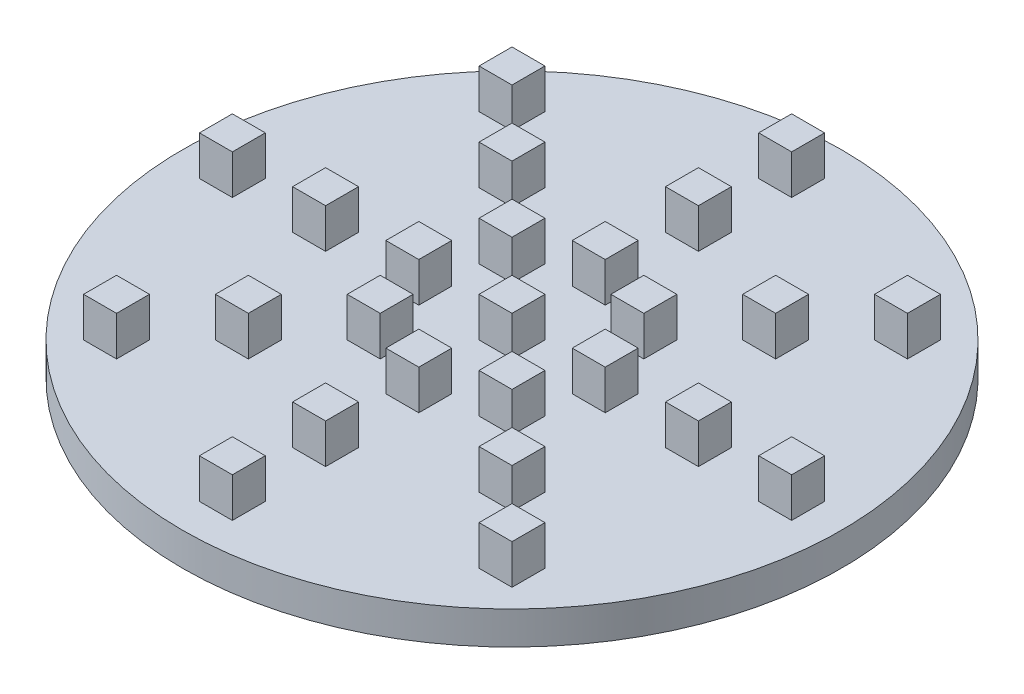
ISO-10303-21;
HEADER;
FILE_DESCRIPTION(('STEP AP214'),'2;1');
FILE_NAME('part.step','',(''),(''),'','','');
FILE_SCHEMA(('AUTOMOTIVE_DESIGN { 1 0 10303 214 1 1 1 1 }'));
ENDSEC;
DATA;
#1=APPLICATION_CONTEXT('core data for automotive mechanical design processes');
#2=APPLICATION_PROTOCOL_DEFINITION('international standard','automotive_design',2000,#1);
#3=PRODUCT_CONTEXT('',#1,'mechanical');
#4=PRODUCT('Part','Part','',(#3));
#5=PRODUCT_RELATED_PRODUCT_CATEGORY('part','',(#4));
#6=PRODUCT_DEFINITION_FORMATION('','',#4);
#7=PRODUCT_DEFINITION_CONTEXT('part definition',#1,'design');
#8=PRODUCT_DEFINITION('design','',#6,#7);
#9=PRODUCT_DEFINITION_SHAPE('','',#8);
#10=(LENGTH_UNIT() NAMED_UNIT(*) SI_UNIT(.MILLI.,.METRE.));
#11=(NAMED_UNIT(*) PLANE_ANGLE_UNIT() SI_UNIT($,.RADIAN.));
#12=(NAMED_UNIT(*) SI_UNIT($,.STERADIAN.) SOLID_ANGLE_UNIT());
#13=UNCERTAINTY_MEASURE_WITH_UNIT(LENGTH_MEASURE(1.E-05),#10,'distance_accuracy_value','');
#14=(GEOMETRIC_REPRESENTATION_CONTEXT(3) GLOBAL_UNCERTAINTY_ASSIGNED_CONTEXT((#13)) GLOBAL_UNIT_ASSIGNED_CONTEXT((#10,
#11,#12)) REPRESENTATION_CONTEXT('',''));
#15=CARTESIAN_POINT('',(0.,0.,0.));
#16=DIRECTION('',(0.,0.,1.));
#17=DIRECTION('',(1.,0.,0.));
#18=AXIS2_PLACEMENT_3D('',#15,#16,#17);
#19=CARTESIAN_POINT('',(0.,12.7,0.));
#20=DIRECTION('',(0.,1.,0.));
#21=DIRECTION('',(0.,0.,1.));
#22=AXIS2_PLACEMENT_3D('',#19,#20,#21);
#23=PLANE('',#22);
#24=CARTESIAN_POINT('',(0.,12.7,0.));
#25=DIRECTION('',(0.,1.,0.));
#26=DIRECTION('',(0.,0.,1.));
#27=AXIS2_PLACEMENT_3D('',#24,#25,#26);
#28=CIRCLE('',#27,127.);
#29=CARTESIAN_POINT('',(0.,12.7,127.));
#30=VERTEX_POINT('',#29);
#31=EDGE_CURVE('E12',#30,#30,#28,.T.);
#32=ORIENTED_EDGE('',*,*,#31,.T.);
#33=EDGE_LOOP('',(#32));
#34=FACE_BOUND('',#33,.T.);
#35=DIRECTION('',(1.,0.,0.));
#36=VECTOR('',#35,1.);
#37=CARTESIAN_POINT('',(-6.35,12.7,6.35));
#38=LINE('',#37,#36);
#39=CARTESIAN_POINT('',(-6.35,12.7,6.35));
#40=VERTEX_POINT('',#39);
#41=CARTESIAN_POINT('',(6.35,12.7,6.35));
#42=VERTEX_POINT('',#41);
#43=EDGE_CURVE('E1361',#40,#42,#38,.T.);
#44=ORIENTED_EDGE('',*,*,#43,.F.);
#45=DIRECTION('',(0.,0.,1.));
#46=VECTOR('',#45,1.);
#47=CARTESIAN_POINT('',(-6.35,12.7,-6.35));
#48=LINE('',#47,#46);
#49=CARTESIAN_POINT('',(-6.35,12.7,-6.35));
#50=VERTEX_POINT('',#49);
#51=EDGE_CURVE('E1347',#50,#40,#48,.T.);
#52=ORIENTED_EDGE('',*,*,#51,.F.);
#53=DIRECTION('',(-1.,0.,0.));
#54=VECTOR('',#53,1.);
#55=CARTESIAN_POINT('',(-6.35,12.7,-6.35));
#56=LINE('',#55,#54);
#57=CARTESIAN_POINT('',(6.35,12.7,-6.35));
#58=VERTEX_POINT('',#57);
#59=EDGE_CURVE('E1352',#58,#50,#56,.T.);
#60=ORIENTED_EDGE('',*,*,#59,.F.);
#61=DIRECTION('',(0.,0.,-1.));
#62=VECTOR('',#61,1.);
#63=CARTESIAN_POINT('',(6.35,12.7,-6.35));
#64=LINE('',#63,#62);
#65=EDGE_CURVE('E1363',#42,#58,#64,.T.);
#66=ORIENTED_EDGE('',*,*,#65,.F.);
#67=EDGE_LOOP('',(#44,#52,#60,#66));
#68=FACE_BOUND('',#67,.T.);
#69=DIRECTION('',(1.,0.,0.));
#70=VECTOR('',#69,1.);
#71=CARTESIAN_POINT('',(29.5710244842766,12.7,6.35));
#72=LINE('',#71,#70);
#73=CARTESIAN_POINT('',(29.5710244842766,12.7,6.35));
#74=VERTEX_POINT('',#73);
#75=CARTESIAN_POINT('',(42.2710244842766,12.7,6.35));
#76=VERTEX_POINT('',#75);
#77=EDGE_CURVE('E1332',#74,#76,#72,.T.);
#78=ORIENTED_EDGE('',*,*,#77,.F.);
#79=DIRECTION('',(0.,0.,1.));
#80=VECTOR('',#79,1.);
#81=CARTESIAN_POINT('',(29.5710244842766,12.7,-6.35));
#82=LINE('',#81,#80);
#83=CARTESIAN_POINT('',(29.5710244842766,12.7,-6.35));
#84=VERTEX_POINT('',#83);
#85=EDGE_CURVE('E1318',#84,#74,#82,.T.);
#86=ORIENTED_EDGE('',*,*,#85,.F.);
#87=DIRECTION('',(-1.,0.,0.));
#88=VECTOR('',#87,1.);
#89=CARTESIAN_POINT('',(29.5710244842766,12.7,-6.35));
#90=LINE('',#89,#88);
#91=CARTESIAN_POINT('',(42.2710244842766,12.7,-6.35));
#92=VERTEX_POINT('',#91);
#93=EDGE_CURVE('E1323',#92,#84,#90,.T.);
#94=ORIENTED_EDGE('',*,*,#93,.F.);
#95=DIRECTION('',(0.,0.,-1.));
#96=VECTOR('',#95,1.);
#97=CARTESIAN_POINT('',(42.2710244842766,12.7,-6.35));
#98=LINE('',#97,#96);
#99=EDGE_CURVE('E1334',#76,#92,#98,.T.);
#100=ORIENTED_EDGE('',*,*,#99,.F.);
#101=EDGE_LOOP('',(#78,#86,#94,#100));
#102=FACE_BOUND('',#101,.T.);
#103=DIRECTION('',(1.,0.,0.));
#104=VECTOR('',#103,1.);
#105=CARTESIAN_POINT('',(19.05,12.7,31.75));
#106=LINE('',#105,#104);
#107=CARTESIAN_POINT('',(19.05,12.7,31.75));
#108=VERTEX_POINT('',#107);
#109=CARTESIAN_POINT('',(31.75,12.7,31.75));
#110=VERTEX_POINT('',#109);
#111=EDGE_CURVE('E1303',#108,#110,#106,.T.);
#112=ORIENTED_EDGE('',*,*,#111,.F.);
#113=DIRECTION('',(0.,0.,1.));
#114=VECTOR('',#113,1.);
#115=CARTESIAN_POINT('',(19.05,12.7,19.05));
#116=LINE('',#115,#114);
#117=CARTESIAN_POINT('',(19.05,12.7,19.05));
#118=VERTEX_POINT('',#117);
#119=EDGE_CURVE('E1289',#118,#108,#116,.T.);
#120=ORIENTED_EDGE('',*,*,#119,.F.);
#121=DIRECTION('',(-1.,0.,0.));
#122=VECTOR('',#121,1.);
#123=CARTESIAN_POINT('',(19.05,12.7,19.05));
#124=LINE('',#123,#122);
#125=CARTESIAN_POINT('',(31.75,12.7,19.05));
#126=VERTEX_POINT('',#125);
#127=EDGE_CURVE('E1294',#126,#118,#124,.T.);
#128=ORIENTED_EDGE('',*,*,#127,.F.);
#129=DIRECTION('',(0.,0.,-1.));
#130=VECTOR('',#129,1.);
#131=CARTESIAN_POINT('',(31.75,12.7,19.05));
#132=LINE('',#131,#130);
#133=EDGE_CURVE('E1305',#110,#126,#132,.T.);
#134=ORIENTED_EDGE('',*,*,#133,.F.);
#135=EDGE_LOOP('',(#112,#120,#128,#134));
#136=FACE_BOUND('',#135,.T.);
#137=DIRECTION('',(1.,0.,0.));
#138=VECTOR('',#137,1.);
#139=CARTESIAN_POINT('',(-6.35,12.7,42.2710244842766));
#140=LINE('',#139,#138);
#141=CARTESIAN_POINT('',(-6.35,12.7,42.2710244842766));
#142=VERTEX_POINT('',#141);
#143=CARTESIAN_POINT('',(6.35,12.7,42.2710244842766));
#144=VERTEX_POINT('',#143);
#145=EDGE_CURVE('E1274',#142,#144,#140,.T.);
#146=ORIENTED_EDGE('',*,*,#145,.F.);
#147=DIRECTION('',(0.,0.,1.));
#148=VECTOR('',#147,1.);
#149=CARTESIAN_POINT('',(-6.35,12.7,29.5710244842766));
#150=LINE('',#149,#148);
#151=CARTESIAN_POINT('',(-6.35,12.7,29.5710244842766));
#152=VERTEX_POINT('',#151);
#153=EDGE_CURVE('E1260',#152,#142,#150,.T.);
#154=ORIENTED_EDGE('',*,*,#153,.F.);
#155=DIRECTION('',(-1.,0.,0.));
#156=VECTOR('',#155,1.);
#157=CARTESIAN_POINT('',(-6.35,12.7,29.5710244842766));
#158=LINE('',#157,#156);
#159=CARTESIAN_POINT('',(6.35,12.7,29.5710244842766));
#160=VERTEX_POINT('',#159);
#161=EDGE_CURVE('E1265',#160,#152,#158,.T.);
#162=ORIENTED_EDGE('',*,*,#161,.F.);
#163=DIRECTION('',(0.,0.,-1.));
#164=VECTOR('',#163,1.);
#165=CARTESIAN_POINT('',(6.35,12.7,29.5710244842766));
#166=LINE('',#165,#164);
#167=EDGE_CURVE('E1276',#144,#160,#166,.T.);
#168=ORIENTED_EDGE('',*,*,#167,.F.);
#169=EDGE_LOOP('',(#146,#154,#162,#168));
#170=FACE_BOUND('',#169,.T.);
#171=DIRECTION('',(1.,0.,0.));
#172=VECTOR('',#171,1.);
#173=CARTESIAN_POINT('',(-31.75,12.7,31.75));
#174=LINE('',#173,#172);
#175=CARTESIAN_POINT('',(-31.75,12.7,31.75));
#176=VERTEX_POINT('',#175);
#177=CARTESIAN_POINT('',(-19.05,12.7,31.75));
#178=VERTEX_POINT('',#177);
#179=EDGE_CURVE('E1245',#176,#178,#174,.T.);
#180=ORIENTED_EDGE('',*,*,#179,.F.);
#181=DIRECTION('',(0.,0.,1.));
#182=VECTOR('',#181,1.);
#183=CARTESIAN_POINT('',(-31.75,12.7,19.05));
#184=LINE('',#183,#182);
#185=CARTESIAN_POINT('',(-31.75,12.7,19.05));
#186=VERTEX_POINT('',#185);
#187=EDGE_CURVE('E1231',#186,#176,#184,.T.);
#188=ORIENTED_EDGE('',*,*,#187,.F.);
#189=DIRECTION('',(-1.,0.,0.));
#190=VECTOR('',#189,1.);
#191=CARTESIAN_POINT('',(-31.75,12.7,19.05));
#192=LINE('',#191,#190);
#193=CARTESIAN_POINT('',(-19.05,12.7,19.05));
#194=VERTEX_POINT('',#193);
#195=EDGE_CURVE('E1236',#194,#186,#192,.T.);
#196=ORIENTED_EDGE('',*,*,#195,.F.);
#197=DIRECTION('',(0.,0.,-1.));
#198=VECTOR('',#197,1.);
#199=CARTESIAN_POINT('',(-19.05,12.7,19.05));
#200=LINE('',#199,#198);
#201=EDGE_CURVE('E1247',#178,#194,#200,.T.);
#202=ORIENTED_EDGE('',*,*,#201,.F.);
#203=EDGE_LOOP('',(#180,#188,#196,#202));
#204=FACE_BOUND('',#203,.T.);
#205=DIRECTION('',(1.,0.,0.));
#206=VECTOR('',#205,1.);
#207=CARTESIAN_POINT('',(-42.2710244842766,12.7,6.35));
#208=LINE('',#207,#206);
#209=CARTESIAN_POINT('',(-42.2710244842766,12.7,6.35));
#210=VERTEX_POINT('',#209);
#211=CARTESIAN_POINT('',(-29.5710244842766,12.7,6.35));
#212=VERTEX_POINT('',#211);
#213=EDGE_CURVE('E1216',#210,#212,#208,.T.);
#214=ORIENTED_EDGE('',*,*,#213,.F.);
#215=DIRECTION('',(0.,0.,1.));
#216=VECTOR('',#215,1.);
#217=CARTESIAN_POINT('',(-42.2710244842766,12.7,-6.35));
#218=LINE('',#217,#216);
#219=CARTESIAN_POINT('',(-42.2710244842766,12.7,-6.35));
#220=VERTEX_POINT('',#219);
#221=EDGE_CURVE('E1202',#220,#210,#218,.T.);
#222=ORIENTED_EDGE('',*,*,#221,.F.);
#223=DIRECTION('',(-1.,0.,0.));
#224=VECTOR('',#223,1.);
#225=CARTESIAN_POINT('',(-42.2710244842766,12.7,-6.35));
#226=LINE('',#225,#224);
#227=CARTESIAN_POINT('',(-29.5710244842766,12.7,-6.35));
#228=VERTEX_POINT('',#227);
#229=EDGE_CURVE('E1207',#228,#220,#226,.T.);
#230=ORIENTED_EDGE('',*,*,#229,.F.);
#231=DIRECTION('',(0.,0.,-1.));
#232=VECTOR('',#231,1.);
#233=CARTESIAN_POINT('',(-29.5710244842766,12.7,-6.35));
#234=LINE('',#233,#232);
#235=EDGE_CURVE('E1218',#212,#228,#234,.T.);
#236=ORIENTED_EDGE('',*,*,#235,.F.);
#237=EDGE_LOOP('',(#214,#222,#230,#236));
#238=FACE_BOUND('',#237,.T.);
#239=DIRECTION('',(1.,0.,0.));
#240=VECTOR('',#239,1.);
#241=CARTESIAN_POINT('',(-31.75,12.7,-19.05));
#242=LINE('',#241,#240);
#243=CARTESIAN_POINT('',(-31.75,12.7,-19.05));
#244=VERTEX_POINT('',#243);
#245=CARTESIAN_POINT('',(-19.05,12.7,-19.05));
#246=VERTEX_POINT('',#245);
#247=EDGE_CURVE('E1187',#244,#246,#242,.T.);
#248=ORIENTED_EDGE('',*,*,#247,.F.);
#249=DIRECTION('',(0.,0.,1.));
#250=VECTOR('',#249,1.);
#251=CARTESIAN_POINT('',(-31.75,12.7,-31.75));
#252=LINE('',#251,#250);
#253=CARTESIAN_POINT('',(-31.75,12.7,-31.75));
#254=VERTEX_POINT('',#253);
#255=EDGE_CURVE('E1173',#254,#244,#252,.T.);
#256=ORIENTED_EDGE('',*,*,#255,.F.);
#257=DIRECTION('',(-1.,0.,0.));
#258=VECTOR('',#257,1.);
#259=CARTESIAN_POINT('',(-31.75,12.7,-31.75));
#260=LINE('',#259,#258);
#261=CARTESIAN_POINT('',(-19.05,12.7,-31.75));
#262=VERTEX_POINT('',#261);
#263=EDGE_CURVE('E1178',#262,#254,#260,.T.);
#264=ORIENTED_EDGE('',*,*,#263,.F.);
#265=DIRECTION('',(0.,0.,-1.));
#266=VECTOR('',#265,1.);
#267=CARTESIAN_POINT('',(-19.05,12.7,-31.75));
#268=LINE('',#267,#266);
#269=EDGE_CURVE('E1189',#246,#262,#268,.T.);
#270=ORIENTED_EDGE('',*,*,#269,.F.);
#271=EDGE_LOOP('',(#248,#256,#264,#270));
#272=FACE_BOUND('',#271,.T.);
#273=DIRECTION('',(1.,0.,0.));
#274=VECTOR('',#273,1.);
#275=CARTESIAN_POINT('',(-6.35,12.7,-29.5710244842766));
#276=LINE('',#275,#274);
#277=CARTESIAN_POINT('',(-6.35,12.7,-29.5710244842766));
#278=VERTEX_POINT('',#277);
#279=CARTESIAN_POINT('',(6.34999999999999,12.7,-29.5710244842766));
#280=VERTEX_POINT('',#279);
#281=EDGE_CURVE('E1158',#278,#280,#276,.T.);
#282=ORIENTED_EDGE('',*,*,#281,.F.);
#283=DIRECTION('',(0.,0.,1.));
#284=VECTOR('',#283,1.);
#285=CARTESIAN_POINT('',(-6.35000000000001,12.7,-42.2710244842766));
#286=LINE('',#285,#284);
#287=CARTESIAN_POINT('',(-6.35000000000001,12.7,-42.2710244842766));
#288=VERTEX_POINT('',#287);
#289=EDGE_CURVE('E1144',#288,#278,#286,.T.);
#290=ORIENTED_EDGE('',*,*,#289,.F.);
#291=DIRECTION('',(-1.,0.,0.));
#292=VECTOR('',#291,1.);
#293=CARTESIAN_POINT('',(-6.35000000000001,12.7,-42.2710244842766));
#294=LINE('',#293,#292);
#295=CARTESIAN_POINT('',(6.34999999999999,12.7,-42.2710244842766));
#296=VERTEX_POINT('',#295);
#297=EDGE_CURVE('E1149',#296,#288,#294,.T.);
#298=ORIENTED_EDGE('',*,*,#297,.F.);
#299=DIRECTION('',(0.,0.,-1.));
#300=VECTOR('',#299,1.);
#301=CARTESIAN_POINT('',(6.34999999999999,12.7,-42.2710244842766));
#302=LINE('',#301,#300);
#303=EDGE_CURVE('E1160',#280,#296,#302,.T.);
#304=ORIENTED_EDGE('',*,*,#303,.F.);
#305=EDGE_LOOP('',(#282,#290,#298,#304));
#306=FACE_BOUND('',#305,.T.);
#307=DIRECTION('',(1.,0.,0.));
#308=VECTOR('',#307,1.);
#309=CARTESIAN_POINT('',(19.05,12.7,-19.05));
#310=LINE('',#309,#308);
#311=CARTESIAN_POINT('',(19.05,12.7,-19.05));
#312=VERTEX_POINT('',#311);
#313=CARTESIAN_POINT('',(31.75,12.7,-19.05));
#314=VERTEX_POINT('',#313);
#315=EDGE_CURVE('E1129',#312,#314,#310,.T.);
#316=ORIENTED_EDGE('',*,*,#315,.F.);
#317=DIRECTION('',(0.,0.,1.));
#318=VECTOR('',#317,1.);
#319=CARTESIAN_POINT('',(19.05,12.7,-31.75));
#320=LINE('',#319,#318);
#321=CARTESIAN_POINT('',(19.05,12.7,-31.75));
#322=VERTEX_POINT('',#321);
#323=EDGE_CURVE('E1115',#322,#312,#320,.T.);
#324=ORIENTED_EDGE('',*,*,#323,.F.);
#325=DIRECTION('',(-1.,0.,0.));
#326=VECTOR('',#325,1.);
#327=CARTESIAN_POINT('',(19.05,12.7,-31.75));
#328=LINE('',#327,#326);
#329=CARTESIAN_POINT('',(31.75,12.7,-31.75));
#330=VERTEX_POINT('',#329);
#331=EDGE_CURVE('E1120',#330,#322,#328,.T.);
#332=ORIENTED_EDGE('',*,*,#331,.F.);
#333=DIRECTION('',(0.,0.,-1.));
#334=VECTOR('',#333,1.);
#335=CARTESIAN_POINT('',(31.75,12.7,-31.75));
#336=LINE('',#335,#334);
#337=EDGE_CURVE('E1131',#314,#330,#336,.T.);
#338=ORIENTED_EDGE('',*,*,#337,.F.);
#339=EDGE_LOOP('',(#316,#324,#332,#338));
#340=FACE_BOUND('',#339,.T.);
#341=DIRECTION('',(1.,0.,0.));
#342=VECTOR('',#341,1.);
#343=CARTESIAN_POINT('',(65.4920489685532,12.7,6.35));
#344=LINE('',#343,#342);
#345=CARTESIAN_POINT('',(65.4920489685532,12.7,6.35));
#346=VERTEX_POINT('',#345);
#347=CARTESIAN_POINT('',(78.1920489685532,12.7,6.35));
#348=VERTEX_POINT('',#347);
#349=EDGE_CURVE('E1100',#346,#348,#344,.T.);
#350=ORIENTED_EDGE('',*,*,#349,.F.);
#351=DIRECTION('',(0.,0.,1.));
#352=VECTOR('',#351,1.);
#353=CARTESIAN_POINT('',(65.4920489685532,12.7,-6.35));
#354=LINE('',#353,#352);
#355=CARTESIAN_POINT('',(65.4920489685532,12.7,-6.35));
#356=VERTEX_POINT('',#355);
#357=EDGE_CURVE('E1086',#356,#346,#354,.T.);
#358=ORIENTED_EDGE('',*,*,#357,.F.);
#359=DIRECTION('',(-1.,0.,0.));
#360=VECTOR('',#359,1.);
#361=CARTESIAN_POINT('',(65.4920489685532,12.7,-6.35));
#362=LINE('',#361,#360);
#363=CARTESIAN_POINT('',(78.1920489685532,12.7,-6.35));
#364=VERTEX_POINT('',#363);
#365=EDGE_CURVE('E1091',#364,#356,#362,.T.);
#366=ORIENTED_EDGE('',*,*,#365,.F.);
#367=DIRECTION('',(0.,0.,-1.));
#368=VECTOR('',#367,1.);
#369=CARTESIAN_POINT('',(78.1920489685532,12.7,-6.35));
#370=LINE('',#369,#368);
#371=EDGE_CURVE('E1102',#348,#364,#370,.T.);
#372=ORIENTED_EDGE('',*,*,#371,.F.);
#373=EDGE_LOOP('',(#350,#358,#366,#372));
#374=FACE_BOUND('',#373,.T.);
#375=DIRECTION('',(1.,0.,0.));
#376=VECTOR('',#375,1.);
#377=CARTESIAN_POINT('',(44.45,12.7,57.15));
#378=LINE('',#377,#376);
#379=CARTESIAN_POINT('',(44.45,12.7,57.15));
#380=VERTEX_POINT('',#379);
#381=CARTESIAN_POINT('',(57.15,12.7,57.15));
#382=VERTEX_POINT('',#381);
#383=EDGE_CURVE('E1071',#380,#382,#378,.T.);
#384=ORIENTED_EDGE('',*,*,#383,.F.);
#385=DIRECTION('',(0.,0.,1.));
#386=VECTOR('',#385,1.);
#387=CARTESIAN_POINT('',(44.45,12.7,44.45));
#388=LINE('',#387,#386);
#389=CARTESIAN_POINT('',(44.45,12.7,44.45));
#390=VERTEX_POINT('',#389);
#391=EDGE_CURVE('E1057',#390,#380,#388,.T.);
#392=ORIENTED_EDGE('',*,*,#391,.F.);
#393=DIRECTION('',(-1.,0.,0.));
#394=VECTOR('',#393,1.);
#395=CARTESIAN_POINT('',(44.45,12.7,44.45));
#396=LINE('',#395,#394);
#397=CARTESIAN_POINT('',(57.15,12.7,44.45));
#398=VERTEX_POINT('',#397);
#399=EDGE_CURVE('E1062',#398,#390,#396,.T.);
#400=ORIENTED_EDGE('',*,*,#399,.F.);
#401=DIRECTION('',(0.,0.,-1.));
#402=VECTOR('',#401,1.);
#403=CARTESIAN_POINT('',(57.15,12.7,44.45));
#404=LINE('',#403,#402);
#405=EDGE_CURVE('E1073',#382,#398,#404,.T.);
#406=ORIENTED_EDGE('',*,*,#405,.F.);
#407=EDGE_LOOP('',(#384,#392,#400,#406));
#408=FACE_BOUND('',#407,.T.);
#409=DIRECTION('',(1.,0.,0.));
#410=VECTOR('',#409,1.);
#411=CARTESIAN_POINT('',(-6.34999999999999,12.7,78.1920489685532));
#412=LINE('',#411,#410);
#413=CARTESIAN_POINT('',(-6.34999999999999,12.7,78.1920489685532));
#414=VERTEX_POINT('',#413);
#415=CARTESIAN_POINT('',(6.35000000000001,12.7,78.1920489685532));
#416=VERTEX_POINT('',#415);
#417=EDGE_CURVE('E1042',#414,#416,#412,.T.);
#418=ORIENTED_EDGE('',*,*,#417,.F.);
#419=DIRECTION('',(0.,0.,1.));
#420=VECTOR('',#419,1.);
#421=CARTESIAN_POINT('',(-6.34999999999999,12.7,65.4920489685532));
#422=LINE('',#421,#420);
#423=CARTESIAN_POINT('',(-6.34999999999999,12.7,65.4920489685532));
#424=VERTEX_POINT('',#423);
#425=EDGE_CURVE('E1028',#424,#414,#422,.T.);
#426=ORIENTED_EDGE('',*,*,#425,.F.);
#427=DIRECTION('',(-1.,0.,0.));
#428=VECTOR('',#427,1.);
#429=CARTESIAN_POINT('',(-6.34999999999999,12.7,65.4920489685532));
#430=LINE('',#429,#428);
#431=CARTESIAN_POINT('',(6.35,12.7,65.4920489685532));
#432=VERTEX_POINT('',#431);
#433=EDGE_CURVE('E1033',#432,#424,#430,.T.);
#434=ORIENTED_EDGE('',*,*,#433,.F.);
#435=DIRECTION('',(0.,0.,-1.));
#436=VECTOR('',#435,1.);
#437=CARTESIAN_POINT('',(6.35,12.7,65.4920489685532));
#438=LINE('',#437,#436);
#439=EDGE_CURVE('E1044',#416,#432,#438,.T.);
#440=ORIENTED_EDGE('',*,*,#439,.F.);
#441=EDGE_LOOP('',(#418,#426,#434,#440));
#442=FACE_BOUND('',#441,.T.);
#443=DIRECTION('',(1.,0.,0.));
#444=VECTOR('',#443,1.);
#445=CARTESIAN_POINT('',(-57.15,12.7,57.15));
#446=LINE('',#445,#444);
#447=CARTESIAN_POINT('',(-57.15,12.7,57.15));
#448=VERTEX_POINT('',#447);
#449=CARTESIAN_POINT('',(-44.45,12.7,57.15));
#450=VERTEX_POINT('',#449);
#451=EDGE_CURVE('E1013',#448,#450,#446,.T.);
#452=ORIENTED_EDGE('',*,*,#451,.F.);
#453=DIRECTION('',(0.,0.,1.));
#454=VECTOR('',#453,1.);
#455=CARTESIAN_POINT('',(-57.15,12.7,44.45));
#456=LINE('',#455,#454);
#457=CARTESIAN_POINT('',(-57.15,12.7,44.45));
#458=VERTEX_POINT('',#457);
#459=EDGE_CURVE('E999',#458,#448,#456,.T.);
#460=ORIENTED_EDGE('',*,*,#459,.F.);
#461=DIRECTION('',(-1.,0.,0.));
#462=VECTOR('',#461,1.);
#463=CARTESIAN_POINT('',(-57.15,12.7,44.45));
#464=LINE('',#463,#462);
#465=CARTESIAN_POINT('',(-44.45,12.7,44.45));
#466=VERTEX_POINT('',#465);
#467=EDGE_CURVE('E1004',#466,#458,#464,.T.);
#468=ORIENTED_EDGE('',*,*,#467,.F.);
#469=DIRECTION('',(0.,0.,-1.));
#470=VECTOR('',#469,1.);
#471=CARTESIAN_POINT('',(-44.45,12.7,44.45));
#472=LINE('',#471,#470);
#473=EDGE_CURVE('E1015',#450,#466,#472,.T.);
#474=ORIENTED_EDGE('',*,*,#473,.F.);
#475=EDGE_LOOP('',(#452,#460,#468,#474));
#476=FACE_BOUND('',#475,.T.);
#477=DIRECTION('',(1.,0.,0.));
#478=VECTOR('',#477,1.);
#479=CARTESIAN_POINT('',(-78.1920489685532,12.7,6.35000000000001));
#480=LINE('',#479,#478);
#481=CARTESIAN_POINT('',(-78.1920489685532,12.7,6.35000000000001));
#482=VERTEX_POINT('',#481);
#483=CARTESIAN_POINT('',(-65.4920489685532,12.7,6.35000000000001));
#484=VERTEX_POINT('',#483);
#485=EDGE_CURVE('E984',#482,#484,#480,.T.);
#486=ORIENTED_EDGE('',*,*,#485,.F.);
#487=DIRECTION('',(0.,0.,1.));
#488=VECTOR('',#487,1.);
#489=CARTESIAN_POINT('',(-78.1920489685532,12.7,-6.34999999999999));
#490=LINE('',#489,#488);
#491=CARTESIAN_POINT('',(-78.1920489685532,12.7,-6.34999999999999));
#492=VERTEX_POINT('',#491);
#493=EDGE_CURVE('E970',#492,#482,#490,.T.);
#494=ORIENTED_EDGE('',*,*,#493,.F.);
#495=DIRECTION('',(-1.,0.,0.));
#496=VECTOR('',#495,1.);
#497=CARTESIAN_POINT('',(-78.1920489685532,12.7,-6.34999999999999));
#498=LINE('',#497,#496);
#499=CARTESIAN_POINT('',(-65.4920489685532,12.7,-6.34999999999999));
#500=VERTEX_POINT('',#499);
#501=EDGE_CURVE('E975',#500,#492,#498,.T.);
#502=ORIENTED_EDGE('',*,*,#501,.F.);
#503=DIRECTION('',(0.,0.,-1.));
#504=VECTOR('',#503,1.);
#505=CARTESIAN_POINT('',(-65.4920489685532,12.7,-6.34999999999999));
#506=LINE('',#505,#504);
#507=EDGE_CURVE('E986',#484,#500,#506,.T.);
#508=ORIENTED_EDGE('',*,*,#507,.F.);
#509=EDGE_LOOP('',(#486,#494,#502,#508));
#510=FACE_BOUND('',#509,.T.);
#511=DIRECTION('',(1.,0.,0.));
#512=VECTOR('',#511,1.);
#513=CARTESIAN_POINT('',(-57.15,12.7,-44.45));
#514=LINE('',#513,#512);
#515=CARTESIAN_POINT('',(-57.15,12.7,-44.45));
#516=VERTEX_POINT('',#515);
#517=CARTESIAN_POINT('',(-44.45,12.7,-44.45));
#518=VERTEX_POINT('',#517);
#519=EDGE_CURVE('E955',#516,#518,#514,.T.);
#520=ORIENTED_EDGE('',*,*,#519,.F.);
#521=DIRECTION('',(0.,0.,1.));
#522=VECTOR('',#521,1.);
#523=CARTESIAN_POINT('',(-57.15,12.7,-57.15));
#524=LINE('',#523,#522);
#525=CARTESIAN_POINT('',(-57.15,12.7,-57.15));
#526=VERTEX_POINT('',#525);
#527=EDGE_CURVE('E941',#526,#516,#524,.T.);
#528=ORIENTED_EDGE('',*,*,#527,.F.);
#529=DIRECTION('',(-1.,0.,0.));
#530=VECTOR('',#529,1.);
#531=CARTESIAN_POINT('',(-57.15,12.7,-57.15));
#532=LINE('',#531,#530);
#533=CARTESIAN_POINT('',(-44.45,12.7,-57.15));
#534=VERTEX_POINT('',#533);
#535=EDGE_CURVE('E946',#534,#526,#532,.T.);
#536=ORIENTED_EDGE('',*,*,#535,.F.);
#537=DIRECTION('',(0.,0.,-1.));
#538=VECTOR('',#537,1.);
#539=CARTESIAN_POINT('',(-44.45,12.7,-57.15));
#540=LINE('',#539,#538);
#541=EDGE_CURVE('E957',#518,#534,#540,.T.);
#542=ORIENTED_EDGE('',*,*,#541,.F.);
#543=EDGE_LOOP('',(#520,#528,#536,#542));
#544=FACE_BOUND('',#543,.T.);
#545=DIRECTION('',(1.,0.,0.));
#546=VECTOR('',#545,1.);
#547=CARTESIAN_POINT('',(-6.35000000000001,12.7,-65.4920489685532));
#548=LINE('',#547,#546);
#549=CARTESIAN_POINT('',(-6.35000000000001,12.7,-65.4920489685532));
#550=VERTEX_POINT('',#549);
#551=CARTESIAN_POINT('',(6.34999999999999,12.7,-65.4920489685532));
#552=VERTEX_POINT('',#551);
#553=EDGE_CURVE('E926',#550,#552,#548,.T.);
#554=ORIENTED_EDGE('',*,*,#553,.F.);
#555=DIRECTION('',(0.,0.,1.));
#556=VECTOR('',#555,1.);
#557=CARTESIAN_POINT('',(-6.35000000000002,12.7,-78.1920489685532));
#558=LINE('',#557,#556);
#559=CARTESIAN_POINT('',(-6.35000000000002,12.7,-78.1920489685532));
#560=VERTEX_POINT('',#559);
#561=EDGE_CURVE('E912',#560,#550,#558,.T.);
#562=ORIENTED_EDGE('',*,*,#561,.F.);
#563=DIRECTION('',(-1.,0.,0.));
#564=VECTOR('',#563,1.);
#565=CARTESIAN_POINT('',(-6.35000000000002,12.7,-78.1920489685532));
#566=LINE('',#565,#564);
#567=CARTESIAN_POINT('',(6.34999999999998,12.7,-78.1920489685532));
#568=VERTEX_POINT('',#567);
#569=EDGE_CURVE('E917',#568,#560,#566,.T.);
#570=ORIENTED_EDGE('',*,*,#569,.F.);
#571=DIRECTION('',(0.,0.,-1.));
#572=VECTOR('',#571,1.);
#573=CARTESIAN_POINT('',(6.34999999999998,12.7,-78.1920489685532));
#574=LINE('',#573,#572);
#575=EDGE_CURVE('E928',#552,#568,#574,.T.);
#576=ORIENTED_EDGE('',*,*,#575,.F.);
#577=EDGE_LOOP('',(#554,#562,#570,#576));
#578=FACE_BOUND('',#577,.T.);
#579=DIRECTION('',(1.,0.,0.));
#580=VECTOR('',#579,1.);
#581=CARTESIAN_POINT('',(44.45,12.7,-44.45));
#582=LINE('',#581,#580);
#583=CARTESIAN_POINT('',(44.45,12.7,-44.45));
#584=VERTEX_POINT('',#583);
#585=CARTESIAN_POINT('',(57.15,12.7,-44.45));
#586=VERTEX_POINT('',#585);
#587=EDGE_CURVE('E897',#584,#586,#582,.T.);
#588=ORIENTED_EDGE('',*,*,#587,.F.);
#589=DIRECTION('',(0.,0.,1.));
#590=VECTOR('',#589,1.);
#591=CARTESIAN_POINT('',(44.45,12.7,-57.15));
#592=LINE('',#591,#590);
#593=CARTESIAN_POINT('',(44.45,12.7,-57.15));
#594=VERTEX_POINT('',#593);
#595=EDGE_CURVE('E883',#594,#584,#592,.T.);
#596=ORIENTED_EDGE('',*,*,#595,.F.);
#597=DIRECTION('',(-1.,0.,0.));
#598=VECTOR('',#597,1.);
#599=CARTESIAN_POINT('',(44.45,12.7,-57.15));
#600=LINE('',#599,#598);
#601=CARTESIAN_POINT('',(57.15,12.7,-57.15));
#602=VERTEX_POINT('',#601);
#603=EDGE_CURVE('E888',#602,#594,#600,.T.);
#604=ORIENTED_EDGE('',*,*,#603,.F.);
#605=DIRECTION('',(0.,0.,-1.));
#606=VECTOR('',#605,1.);
#607=CARTESIAN_POINT('',(57.15,12.7,-57.15));
#608=LINE('',#607,#606);
#609=EDGE_CURVE('E899',#586,#602,#608,.T.);
#610=ORIENTED_EDGE('',*,*,#609,.F.);
#611=EDGE_LOOP('',(#588,#596,#604,#610));
#612=FACE_BOUND('',#611,.T.);
#613=DIRECTION('',(1.,0.,0.));
#614=VECTOR('',#613,1.);
#615=CARTESIAN_POINT('',(101.41307345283,12.7,6.35));
#616=LINE('',#615,#614);
#617=CARTESIAN_POINT('',(101.41307345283,12.7,6.35));
#618=VERTEX_POINT('',#617);
#619=CARTESIAN_POINT('',(114.11307345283,12.7,6.35));
#620=VERTEX_POINT('',#619);
#621=EDGE_CURVE('E868',#618,#620,#616,.T.);
#622=ORIENTED_EDGE('',*,*,#621,.F.);
#623=DIRECTION('',(0.,0.,1.));
#624=VECTOR('',#623,1.);
#625=CARTESIAN_POINT('',(101.41307345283,12.7,-6.35));
#626=LINE('',#625,#624);
#627=CARTESIAN_POINT('',(101.41307345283,12.7,-6.35));
#628=VERTEX_POINT('',#627);
#629=EDGE_CURVE('E854',#628,#618,#626,.T.);
#630=ORIENTED_EDGE('',*,*,#629,.F.);
#631=DIRECTION('',(-1.,0.,0.));
#632=VECTOR('',#631,1.);
#633=CARTESIAN_POINT('',(101.41307345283,12.7,-6.35));
#634=LINE('',#633,#632);
#635=CARTESIAN_POINT('',(114.11307345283,12.7,-6.35));
#636=VERTEX_POINT('',#635);
#637=EDGE_CURVE('E859',#636,#628,#634,.T.);
#638=ORIENTED_EDGE('',*,*,#637,.F.);
#639=DIRECTION('',(0.,0.,-1.));
#640=VECTOR('',#639,1.);
#641=CARTESIAN_POINT('',(114.11307345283,12.7,-6.35));
#642=LINE('',#641,#640);
#643=EDGE_CURVE('E870',#620,#636,#642,.T.);
#644=ORIENTED_EDGE('',*,*,#643,.F.);
#645=EDGE_LOOP('',(#622,#630,#638,#644));
#646=FACE_BOUND('',#645,.T.);
#647=DIRECTION('',(1.,0.,0.));
#648=VECTOR('',#647,1.);
#649=CARTESIAN_POINT('',(69.85,12.7,82.55));
#650=LINE('',#649,#648);
#651=CARTESIAN_POINT('',(69.85,12.7,82.55));
#652=VERTEX_POINT('',#651);
#653=CARTESIAN_POINT('',(82.55,12.7,82.55));
#654=VERTEX_POINT('',#653);
#655=EDGE_CURVE('E839',#652,#654,#650,.T.);
#656=ORIENTED_EDGE('',*,*,#655,.F.);
#657=DIRECTION('',(0.,0.,1.));
#658=VECTOR('',#657,1.);
#659=CARTESIAN_POINT('',(69.85,12.7,69.85));
#660=LINE('',#659,#658);
#661=CARTESIAN_POINT('',(69.85,12.7,69.85));
#662=VERTEX_POINT('',#661);
#663=EDGE_CURVE('E825',#662,#652,#660,.T.);
#664=ORIENTED_EDGE('',*,*,#663,.F.);
#665=DIRECTION('',(-1.,0.,0.));
#666=VECTOR('',#665,1.);
#667=CARTESIAN_POINT('',(69.85,12.7,69.85));
#668=LINE('',#667,#666);
#669=CARTESIAN_POINT('',(82.55,12.7,69.85));
#670=VERTEX_POINT('',#669);
#671=EDGE_CURVE('E830',#670,#662,#668,.T.);
#672=ORIENTED_EDGE('',*,*,#671,.F.);
#673=DIRECTION('',(0.,0.,-1.));
#674=VECTOR('',#673,1.);
#675=CARTESIAN_POINT('',(82.55,12.7,69.85));
#676=LINE('',#675,#674);
#677=EDGE_CURVE('E841',#654,#670,#676,.T.);
#678=ORIENTED_EDGE('',*,*,#677,.F.);
#679=EDGE_LOOP('',(#656,#664,#672,#678));
#680=FACE_BOUND('',#679,.T.);
#681=DIRECTION('',(1.,0.,0.));
#682=VECTOR('',#681,1.);
#683=CARTESIAN_POINT('',(-6.34999999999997,12.7,114.11307345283));
#684=LINE('',#683,#682);
#685=CARTESIAN_POINT('',(-6.34999999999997,12.7,114.11307345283));
#686=VERTEX_POINT('',#685);
#687=CARTESIAN_POINT('',(6.35000000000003,12.7,114.11307345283));
#688=VERTEX_POINT('',#687);
#689=EDGE_CURVE('E810',#686,#688,#684,.T.);
#690=ORIENTED_EDGE('',*,*,#689,.F.);
#691=DIRECTION('',(0.,0.,1.));
#692=VECTOR('',#691,1.);
#693=CARTESIAN_POINT('',(-6.34999999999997,12.7,101.41307345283));
#694=LINE('',#693,#692);
#695=CARTESIAN_POINT('',(-6.34999999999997,12.7,101.41307345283));
#696=VERTEX_POINT('',#695);
#697=EDGE_CURVE('E796',#696,#686,#694,.T.);
#698=ORIENTED_EDGE('',*,*,#697,.F.);
#699=DIRECTION('',(-1.,0.,0.));
#700=VECTOR('',#699,1.);
#701=CARTESIAN_POINT('',(-6.34999999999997,12.7,101.41307345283));
#702=LINE('',#701,#700);
#703=CARTESIAN_POINT('',(6.35000000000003,12.7,101.41307345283));
#704=VERTEX_POINT('',#703);
#705=EDGE_CURVE('E801',#704,#696,#702,.T.);
#706=ORIENTED_EDGE('',*,*,#705,.F.);
#707=DIRECTION('',(0.,0.,-1.));
#708=VECTOR('',#707,1.);
#709=CARTESIAN_POINT('',(6.35000000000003,12.7,101.41307345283));
#710=LINE('',#709,#708);
#711=EDGE_CURVE('E812',#688,#704,#710,.T.);
#712=ORIENTED_EDGE('',*,*,#711,.F.);
#713=EDGE_LOOP('',(#690,#698,#706,#712));
#714=FACE_BOUND('',#713,.T.);
#715=DIRECTION('',(1.,0.,0.));
#716=VECTOR('',#715,1.);
#717=CARTESIAN_POINT('',(-82.55,12.7,82.55));
#718=LINE('',#717,#716);
#719=CARTESIAN_POINT('',(-82.55,12.7,82.55));
#720=VERTEX_POINT('',#719);
#721=CARTESIAN_POINT('',(-69.85,12.7,82.55));
#722=VERTEX_POINT('',#721);
#723=EDGE_CURVE('E781',#720,#722,#718,.T.);
#724=ORIENTED_EDGE('',*,*,#723,.F.);
#725=DIRECTION('',(0.,0.,1.));
#726=VECTOR('',#725,1.);
#727=CARTESIAN_POINT('',(-82.55,12.7,69.85));
#728=LINE('',#727,#726);
#729=CARTESIAN_POINT('',(-82.55,12.7,69.85));
#730=VERTEX_POINT('',#729);
#731=EDGE_CURVE('E767',#730,#720,#728,.T.);
#732=ORIENTED_EDGE('',*,*,#731,.F.);
#733=DIRECTION('',(-1.,0.,0.));
#734=VECTOR('',#733,1.);
#735=CARTESIAN_POINT('',(-82.55,12.7,69.85));
#736=LINE('',#735,#734);
#737=CARTESIAN_POINT('',(-69.85,12.7,69.85));
#738=VERTEX_POINT('',#737);
#739=EDGE_CURVE('E772',#738,#730,#736,.T.);
#740=ORIENTED_EDGE('',*,*,#739,.F.);
#741=DIRECTION('',(0.,0.,-1.));
#742=VECTOR('',#741,1.);
#743=CARTESIAN_POINT('',(-69.85,12.7,69.85));
#744=LINE('',#743,#742);
#745=EDGE_CURVE('E783',#722,#738,#744,.T.);
#746=ORIENTED_EDGE('',*,*,#745,.F.);
#747=EDGE_LOOP('',(#724,#732,#740,#746));
#748=FACE_BOUND('',#747,.T.);
#749=DIRECTION('',(1.,0.,0.));
#750=VECTOR('',#749,1.);
#751=CARTESIAN_POINT('',(-114.11307345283,12.7,6.35000000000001));
#752=LINE('',#751,#750);
#753=CARTESIAN_POINT('',(-114.11307345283,12.7,6.35000000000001));
#754=VERTEX_POINT('',#753);
#755=CARTESIAN_POINT('',(-101.41307345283,12.7,6.35000000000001));
#756=VERTEX_POINT('',#755);
#757=EDGE_CURVE('E752',#754,#756,#752,.T.);
#758=ORIENTED_EDGE('',*,*,#757,.F.);
#759=DIRECTION('',(0.,0.,1.));
#760=VECTOR('',#759,1.);
#761=CARTESIAN_POINT('',(-114.11307345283,12.7,-6.34999999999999));
#762=LINE('',#761,#760);
#763=CARTESIAN_POINT('',(-114.11307345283,12.7,-6.34999999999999));
#764=VERTEX_POINT('',#763);
#765=EDGE_CURVE('E738',#764,#754,#762,.T.);
#766=ORIENTED_EDGE('',*,*,#765,.F.);
#767=DIRECTION('',(-1.,0.,0.));
#768=VECTOR('',#767,1.);
#769=CARTESIAN_POINT('',(-114.11307345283,12.7,-6.34999999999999));
#770=LINE('',#769,#768);
#771=CARTESIAN_POINT('',(-101.41307345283,12.7,-6.34999999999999));
#772=VERTEX_POINT('',#771);
#773=EDGE_CURVE('E743',#772,#764,#770,.T.);
#774=ORIENTED_EDGE('',*,*,#773,.F.);
#775=DIRECTION('',(0.,0.,-1.));
#776=VECTOR('',#775,1.);
#777=CARTESIAN_POINT('',(-101.41307345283,12.7,-6.34999999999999));
#778=LINE('',#777,#776);
#779=EDGE_CURVE('E754',#756,#772,#778,.T.);
#780=ORIENTED_EDGE('',*,*,#779,.F.);
#781=EDGE_LOOP('',(#758,#766,#774,#780));
#782=FACE_BOUND('',#781,.T.);
#783=DIRECTION('',(1.,0.,0.));
#784=VECTOR('',#783,1.);
#785=CARTESIAN_POINT('',(-82.55,12.7,-69.85));
#786=LINE('',#785,#784);
#787=CARTESIAN_POINT('',(-82.55,12.7,-69.85));
#788=VERTEX_POINT('',#787);
#789=CARTESIAN_POINT('',(-69.85,12.7,-69.85));
#790=VERTEX_POINT('',#789);
#791=EDGE_CURVE('E723',#788,#790,#786,.T.);
#792=ORIENTED_EDGE('',*,*,#791,.F.);
#793=DIRECTION('',(0.,0.,1.));
#794=VECTOR('',#793,1.);
#795=CARTESIAN_POINT('',(-82.55,12.7,-82.55));
#796=LINE('',#795,#794);
#797=CARTESIAN_POINT('',(-82.55,12.7,-82.55));
#798=VERTEX_POINT('',#797);
#799=EDGE_CURVE('E709',#798,#788,#796,.T.);
#800=ORIENTED_EDGE('',*,*,#799,.F.);
#801=DIRECTION('',(-1.,0.,0.));
#802=VECTOR('',#801,1.);
#803=CARTESIAN_POINT('',(-82.55,12.7,-82.55));
#804=LINE('',#803,#802);
#805=CARTESIAN_POINT('',(-69.85,12.7,-82.55));
#806=VERTEX_POINT('',#805);
#807=EDGE_CURVE('E714',#806,#798,#804,.T.);
#808=ORIENTED_EDGE('',*,*,#807,.F.);
#809=DIRECTION('',(0.,0.,-1.));
#810=VECTOR('',#809,1.);
#811=CARTESIAN_POINT('',(-69.85,12.7,-82.55));
#812=LINE('',#811,#810);
#813=EDGE_CURVE('E725',#790,#806,#812,.T.);
#814=ORIENTED_EDGE('',*,*,#813,.F.);
#815=EDGE_LOOP('',(#792,#800,#808,#814));
#816=FACE_BOUND('',#815,.T.);
#817=DIRECTION('',(1.,0.,0.));
#818=VECTOR('',#817,1.);
#819=CARTESIAN_POINT('',(-6.35,12.7,-101.41307345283));
#820=LINE('',#819,#818);
#821=CARTESIAN_POINT('',(-6.35,12.7,-101.41307345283));
#822=VERTEX_POINT('',#821);
#823=CARTESIAN_POINT('',(6.35,12.7,-101.41307345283));
#824=VERTEX_POINT('',#823);
#825=EDGE_CURVE('E681',#822,#824,#820,.T.);
#826=ORIENTED_EDGE('',*,*,#825,.F.);
#827=DIRECTION('',(0.,0.,1.));
#828=VECTOR('',#827,1.);
#829=CARTESIAN_POINT('',(-6.35,12.7,-114.11307345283));
#830=LINE('',#829,#828);
#831=CARTESIAN_POINT('',(-6.35,12.7,-114.11307345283));
#832=VERTEX_POINT('',#831);
#833=EDGE_CURVE('E678',#832,#822,#830,.T.);
#834=ORIENTED_EDGE('',*,*,#833,.F.);
#835=DIRECTION('',(-1.,0.,0.));
#836=VECTOR('',#835,1.);
#837=CARTESIAN_POINT('',(-6.35,12.7,-114.11307345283));
#838=LINE('',#837,#836);
#839=CARTESIAN_POINT('',(6.35,12.7,-114.11307345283));
#840=VERTEX_POINT('',#839);
#841=EDGE_CURVE('E690',#840,#832,#838,.T.);
#842=ORIENTED_EDGE('',*,*,#841,.F.);
#843=DIRECTION('',(0.,0.,-1.));
#844=VECTOR('',#843,1.);
#845=CARTESIAN_POINT('',(6.35,12.7,-114.11307345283));
#846=LINE('',#845,#844);
#847=EDGE_CURVE('E698',#824,#840,#846,.T.);
#848=ORIENTED_EDGE('',*,*,#847,.F.);
#849=EDGE_LOOP('',(#826,#834,#842,#848));
#850=FACE_BOUND('',#849,.T.);
#851=DIRECTION('',(1.,0.,0.));
#852=VECTOR('',#851,1.);
#853=CARTESIAN_POINT('',(69.85,12.7,-69.85));
#854=LINE('',#853,#852);
#855=CARTESIAN_POINT('',(69.85,12.7,-69.85));
#856=VERTEX_POINT('',#855);
#857=CARTESIAN_POINT('',(82.55,12.7,-69.85));
#858=VERTEX_POINT('',#857);
#859=EDGE_CURVE('E2655',#856,#858,#854,.T.);
#860=ORIENTED_EDGE('',*,*,#859,.F.);
#861=DIRECTION('',(0.,0.,1.));
#862=VECTOR('',#861,1.);
#863=CARTESIAN_POINT('',(69.85,12.7,-82.55));
#864=LINE('',#863,#862);
#865=CARTESIAN_POINT('',(69.85,12.7,-82.55));
#866=VERTEX_POINT('',#865);
#867=EDGE_CURVE('E676',#866,#856,#864,.T.);
#868=ORIENTED_EDGE('',*,*,#867,.F.);
#869=DIRECTION('',(-1.,0.,0.));
#870=VECTOR('',#869,1.);
#871=CARTESIAN_POINT('',(69.85,12.7,-82.55));
#872=LINE('',#871,#870);
#873=CARTESIAN_POINT('',(82.55,12.7,-82.55));
#874=VERTEX_POINT('',#873);
#875=EDGE_CURVE('E672',#874,#866,#872,.T.);
#876=ORIENTED_EDGE('',*,*,#875,.F.);
#877=DIRECTION('',(0.,0.,-1.));
#878=VECTOR('',#877,1.);
#879=CARTESIAN_POINT('',(82.55,12.7,-82.55));
#880=LINE('',#879,#878);
#881=EDGE_CURVE('E2652',#858,#874,#880,.T.);
#882=ORIENTED_EDGE('',*,*,#881,.F.);
#883=EDGE_LOOP('',(#860,#868,#876,#882));
#884=FACE_BOUND('',#883,.T.);
#885=ADVANCED_FACE('F35',(#34,#68,#102,#136,#170,#204,#238,#272,#306,#340,#374,#408,#442,#476,
#510,#544,#578,#612,#646,#680,#714,#748,#782,#816,#850,#884),#23,.T.);
#886=CARTESIAN_POINT('',(0.,12.7,0.));
#887=DIRECTION('',(0.,-1.,0.));
#888=DIRECTION('',(0.,0.,-1.));
#889=AXIS2_PLACEMENT_3D('',#886,#887,#888);
#890=CYLINDRICAL_SURFACE('',#889,127.);
#891=ORIENTED_EDGE('',*,*,#31,.F.);
#892=EDGE_LOOP('',(#891));
#893=FACE_BOUND('',#892,.T.);
#894=CARTESIAN_POINT('',(0.,0.,0.));
#895=DIRECTION('',(0.,1.,0.));
#896=DIRECTION('',(0.,0.,1.));
#897=AXIS2_PLACEMENT_3D('',#894,#895,#896);
#898=CIRCLE('',#897,127.);
#899=CARTESIAN_POINT('',(0.,0.,127.));
#900=VERTEX_POINT('',#899);
#901=EDGE_CURVE('E39',#900,#900,#898,.T.);
#902=ORIENTED_EDGE('',*,*,#901,.T.);
#903=EDGE_LOOP('',(#902));
#904=FACE_BOUND('',#903,.T.);
#905=ADVANCED_FACE('F37',(#893,#904),#890,.T.);
#906=CARTESIAN_POINT('',(0.,0.,0.));
#907=DIRECTION('',(0.,1.,0.));
#908=DIRECTION('',(0.,0.,1.));
#909=AXIS2_PLACEMENT_3D('',#906,#907,#908);
#910=PLANE('',#909);
#911=ORIENTED_EDGE('',*,*,#901,.F.);
#912=EDGE_LOOP('',(#911));
#913=FACE_BOUND('',#912,.T.);
#914=ADVANCED_FACE('F1381',(#913),#910,.F.);
#915=CARTESIAN_POINT('',(-6.35,27.94,-6.35));
#916=DIRECTION('',(1.,0.,0.));
#917=DIRECTION('',(0.,0.,-1.));
#918=AXIS2_PLACEMENT_3D('',#915,#916,#917);
#919=PLANE('',#918);
#920=ORIENTED_EDGE('',*,*,#51,.T.);
#921=DIRECTION('',(0.,-1.,0.));
#922=VECTOR('',#921,1.);
#923=CARTESIAN_POINT('',(-6.35,27.94,6.35));
#924=LINE('',#923,#922);
#925=CARTESIAN_POINT('',(-6.35,27.94,6.35));
#926=VERTEX_POINT('',#925);
#927=EDGE_CURVE('E1374',#926,#40,#924,.T.);
#928=ORIENTED_EDGE('',*,*,#927,.F.);
#929=DIRECTION('',(0.,0.,1.));
#930=VECTOR('',#929,1.);
#931=CARTESIAN_POINT('',(-6.35,27.94,-6.35));
#932=LINE('',#931,#930);
#933=CARTESIAN_POINT('',(-6.35,27.94,-6.35));
#934=VERTEX_POINT('',#933);
#935=EDGE_CURVE('E1348',#934,#926,#932,.T.);
#936=ORIENTED_EDGE('',*,*,#935,.F.);
#937=DIRECTION('',(0.,-1.,0.));
#938=VECTOR('',#937,1.);
#939=CARTESIAN_POINT('',(-6.35,27.94,-6.35));
#940=LINE('',#939,#938);
#941=EDGE_CURVE('E1358',#934,#50,#940,.T.);
#942=ORIENTED_EDGE('',*,*,#941,.T.);
#943=EDGE_LOOP('',(#920,#928,#936,#942));
#944=FACE_BOUND('',#943,.T.);
#945=ADVANCED_FACE('F1383',(#944),#919,.F.);
#946=CARTESIAN_POINT('',(-6.35,27.94,6.35));
#947=DIRECTION('',(0.,0.,-1.));
#948=DIRECTION('',(-1.,0.,0.));
#949=AXIS2_PLACEMENT_3D('',#946,#947,#948);
#950=PLANE('',#949);
#951=ORIENTED_EDGE('',*,*,#43,.T.);
#952=DIRECTION('',(0.,-1.,0.));
#953=VECTOR('',#952,1.);
#954=CARTESIAN_POINT('',(6.35,27.94,6.35));
#955=LINE('',#954,#953);
#956=CARTESIAN_POINT('',(6.35,27.94,6.35));
#957=VERTEX_POINT('',#956);
#958=EDGE_CURVE('E1371',#957,#42,#955,.T.);
#959=ORIENTED_EDGE('',*,*,#958,.F.);
#960=DIRECTION('',(1.,0.,0.));
#961=VECTOR('',#960,1.);
#962=CARTESIAN_POINT('',(-6.35,27.94,6.35));
#963=LINE('',#962,#961);
#964=EDGE_CURVE('E1351',#926,#957,#963,.T.);
#965=ORIENTED_EDGE('',*,*,#964,.F.);
#966=ORIENTED_EDGE('',*,*,#927,.T.);
#967=EDGE_LOOP('',(#951,#959,#965,#966));
#968=FACE_BOUND('',#967,.T.);
#969=ADVANCED_FACE('F1388',(#968),#950,.F.);
#970=CARTESIAN_POINT('',(6.35,27.94,-6.35));
#971=DIRECTION('',(-1.,0.,0.));
#972=DIRECTION('',(0.,0.,1.));
#973=AXIS2_PLACEMENT_3D('',#970,#971,#972);
#974=PLANE('',#973);
#975=ORIENTED_EDGE('',*,*,#65,.T.);
#976=DIRECTION('',(0.,-1.,0.));
#977=VECTOR('',#976,1.);
#978=CARTESIAN_POINT('',(6.35,27.94,-6.35));
#979=LINE('',#978,#977);
#980=CARTESIAN_POINT('',(6.35,27.94,-6.35));
#981=VERTEX_POINT('',#980);
#982=EDGE_CURVE('E1369',#981,#58,#979,.T.);
#983=ORIENTED_EDGE('',*,*,#982,.F.);
#984=DIRECTION('',(0.,0.,-1.));
#985=VECTOR('',#984,1.);
#986=CARTESIAN_POINT('',(6.35,27.94,-6.35));
#987=LINE('',#986,#985);
#988=EDGE_CURVE('E1354',#957,#981,#987,.T.);
#989=ORIENTED_EDGE('',*,*,#988,.F.);
#990=ORIENTED_EDGE('',*,*,#958,.T.);
#991=EDGE_LOOP('',(#975,#983,#989,#990));
#992=FACE_BOUND('',#991,.T.);
#993=ADVANCED_FACE('F1401',(#992),#974,.F.);
#994=CARTESIAN_POINT('',(-6.35,27.94,-6.35));
#995=DIRECTION('',(0.,0.,1.));
#996=DIRECTION('',(1.,0.,0.));
#997=AXIS2_PLACEMENT_3D('',#994,#995,#996);
#998=PLANE('',#997);
#999=ORIENTED_EDGE('',*,*,#59,.T.);
#1000=ORIENTED_EDGE('',*,*,#941,.F.);
#1001=DIRECTION('',(-1.,0.,0.));
#1002=VECTOR('',#1001,1.);
#1003=CARTESIAN_POINT('',(-6.35,27.94,-6.35));
#1004=LINE('',#1003,#1002);
#1005=EDGE_CURVE('E1356',#981,#934,#1004,.T.);
#1006=ORIENTED_EDGE('',*,*,#1005,.F.);
#1007=ORIENTED_EDGE('',*,*,#982,.T.);
#1008=EDGE_LOOP('',(#999,#1000,#1006,#1007));
#1009=FACE_BOUND('',#1008,.T.);
#1010=ADVANCED_FACE('F1404',(#1009),#998,.F.);
#1011=CARTESIAN_POINT('',(-6.35,27.94,6.35));
#1012=DIRECTION('',(0.,1.,0.));
#1013=DIRECTION('',(0.,0.,1.));
#1014=AXIS2_PLACEMENT_3D('',#1011,#1012,#1013);
#1015=PLANE('',#1014);
#1016=ORIENTED_EDGE('',*,*,#935,.T.);
#1017=ORIENTED_EDGE('',*,*,#964,.T.);
#1018=ORIENTED_EDGE('',*,*,#988,.T.);
#1019=ORIENTED_EDGE('',*,*,#1005,.T.);
#1020=EDGE_LOOP('',(#1016,#1017,#1018,#1019));
#1021=FACE_BOUND('',#1020,.T.);
#1022=ADVANCED_FACE('F1408',(#1021),#1015,.T.);
#1023=CARTESIAN_POINT('',(29.5710244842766,27.94,-6.35));
#1024=DIRECTION('',(1.,0.,0.));
#1025=DIRECTION('',(0.,0.,-1.));
#1026=AXIS2_PLACEMENT_3D('',#1023,#1024,#1025);
#1027=PLANE('',#1026);
#1028=ORIENTED_EDGE('',*,*,#85,.T.);
#1029=DIRECTION('',(0.,-1.,0.));
#1030=VECTOR('',#1029,1.);
#1031=CARTESIAN_POINT('',(29.5710244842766,27.94,6.35));
#1032=LINE('',#1031,#1030);
#1033=CARTESIAN_POINT('',(29.5710244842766,27.94,6.35));
#1034=VERTEX_POINT('',#1033);
#1035=EDGE_CURVE('E1345',#1034,#74,#1032,.T.);
#1036=ORIENTED_EDGE('',*,*,#1035,.F.);
#1037=DIRECTION('',(0.,0.,1.));
#1038=VECTOR('',#1037,1.);
#1039=CARTESIAN_POINT('',(29.5710244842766,27.94,-6.35));
#1040=LINE('',#1039,#1038);
#1041=CARTESIAN_POINT('',(29.5710244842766,27.94,-6.35));
#1042=VERTEX_POINT('',#1041);
#1043=EDGE_CURVE('E1319',#1042,#1034,#1040,.T.);
#1044=ORIENTED_EDGE('',*,*,#1043,.F.);
#1045=DIRECTION('',(0.,-1.,0.));
#1046=VECTOR('',#1045,1.);
#1047=CARTESIAN_POINT('',(29.5710244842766,27.94,-6.35));
#1048=LINE('',#1047,#1046);
#1049=EDGE_CURVE('E1329',#1042,#84,#1048,.T.);
#1050=ORIENTED_EDGE('',*,*,#1049,.T.);
#1051=EDGE_LOOP('',(#1028,#1036,#1044,#1050));
#1052=FACE_BOUND('',#1051,.T.);
#1053=ADVANCED_FACE('F1412',(#1052),#1027,.F.);
#1054=CARTESIAN_POINT('',(29.5710244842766,27.94,6.35));
#1055=DIRECTION('',(0.,0.,-1.));
#1056=DIRECTION('',(-1.,0.,0.));
#1057=AXIS2_PLACEMENT_3D('',#1054,#1055,#1056);
#1058=PLANE('',#1057);
#1059=ORIENTED_EDGE('',*,*,#77,.T.);
#1060=DIRECTION('',(0.,-1.,0.));
#1061=VECTOR('',#1060,1.);
#1062=CARTESIAN_POINT('',(42.2710244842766,27.94,6.35));
#1063=LINE('',#1062,#1061);
#1064=CARTESIAN_POINT('',(42.2710244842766,27.94,6.35));
#1065=VERTEX_POINT('',#1064);
#1066=EDGE_CURVE('E1342',#1065,#76,#1063,.T.);
#1067=ORIENTED_EDGE('',*,*,#1066,.F.);
#1068=DIRECTION('',(1.,0.,0.));
#1069=VECTOR('',#1068,1.);
#1070=CARTESIAN_POINT('',(29.5710244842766,27.94,6.35));
#1071=LINE('',#1070,#1069);
#1072=EDGE_CURVE('E1322',#1034,#1065,#1071,.T.);
#1073=ORIENTED_EDGE('',*,*,#1072,.F.);
#1074=ORIENTED_EDGE('',*,*,#1035,.T.);
#1075=EDGE_LOOP('',(#1059,#1067,#1073,#1074));
#1076=FACE_BOUND('',#1075,.T.);
#1077=ADVANCED_FACE('F1416',(#1076),#1058,.F.);
#1078=CARTESIAN_POINT('',(42.2710244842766,27.94,-6.35));
#1079=DIRECTION('',(-1.,0.,0.));
#1080=DIRECTION('',(0.,0.,1.));
#1081=AXIS2_PLACEMENT_3D('',#1078,#1079,#1080);
#1082=PLANE('',#1081);
#1083=ORIENTED_EDGE('',*,*,#99,.T.);
#1084=DIRECTION('',(0.,-1.,0.));
#1085=VECTOR('',#1084,1.);
#1086=CARTESIAN_POINT('',(42.2710244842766,27.94,-6.35));
#1087=LINE('',#1086,#1085);
#1088=CARTESIAN_POINT('',(42.2710244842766,27.94,-6.35));
#1089=VERTEX_POINT('',#1088);
#1090=EDGE_CURVE('E1340',#1089,#92,#1087,.T.);
#1091=ORIENTED_EDGE('',*,*,#1090,.F.);
#1092=DIRECTION('',(0.,0.,-1.));
#1093=VECTOR('',#1092,1.);
#1094=CARTESIAN_POINT('',(42.2710244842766,27.94,-6.35));
#1095=LINE('',#1094,#1093);
#1096=EDGE_CURVE('E1325',#1065,#1089,#1095,.T.);
#1097=ORIENTED_EDGE('',*,*,#1096,.F.);
#1098=ORIENTED_EDGE('',*,*,#1066,.T.);
#1099=EDGE_LOOP('',(#1083,#1091,#1097,#1098));
#1100=FACE_BOUND('',#1099,.T.);
#1101=ADVANCED_FACE('F1420',(#1100),#1082,.F.);
#1102=CARTESIAN_POINT('',(29.5710244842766,27.94,-6.35));
#1103=DIRECTION('',(0.,0.,1.));
#1104=DIRECTION('',(1.,0.,0.));
#1105=AXIS2_PLACEMENT_3D('',#1102,#1103,#1104);
#1106=PLANE('',#1105);
#1107=ORIENTED_EDGE('',*,*,#93,.T.);
#1108=ORIENTED_EDGE('',*,*,#1049,.F.);
#1109=DIRECTION('',(-1.,0.,0.));
#1110=VECTOR('',#1109,1.);
#1111=CARTESIAN_POINT('',(29.5710244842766,27.94,-6.35));
#1112=LINE('',#1111,#1110);
#1113=EDGE_CURVE('E1327',#1089,#1042,#1112,.T.);
#1114=ORIENTED_EDGE('',*,*,#1113,.F.);
#1115=ORIENTED_EDGE('',*,*,#1090,.T.);
#1116=EDGE_LOOP('',(#1107,#1108,#1114,#1115));
#1117=FACE_BOUND('',#1116,.T.);
#1118=ADVANCED_FACE('F1424',(#1117),#1106,.F.);
#1119=CARTESIAN_POINT('',(29.5710244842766,27.94,6.35));
#1120=DIRECTION('',(0.,1.,0.));
#1121=DIRECTION('',(0.,0.,1.));
#1122=AXIS2_PLACEMENT_3D('',#1119,#1120,#1121);
#1123=PLANE('',#1122);
#1124=ORIENTED_EDGE('',*,*,#1043,.T.);
#1125=ORIENTED_EDGE('',*,*,#1072,.T.);
#1126=ORIENTED_EDGE('',*,*,#1096,.T.);
#1127=ORIENTED_EDGE('',*,*,#1113,.T.);
#1128=EDGE_LOOP('',(#1124,#1125,#1126,#1127));
#1129=FACE_BOUND('',#1128,.T.);
#1130=ADVANCED_FACE('F1428',(#1129),#1123,.T.);
#1131=CARTESIAN_POINT('',(19.05,27.94,19.05));
#1132=DIRECTION('',(1.,0.,0.));
#1133=DIRECTION('',(0.,0.,-1.));
#1134=AXIS2_PLACEMENT_3D('',#1131,#1132,#1133);
#1135=PLANE('',#1134);
#1136=ORIENTED_EDGE('',*,*,#119,.T.);
#1137=DIRECTION('',(0.,-1.,0.));
#1138=VECTOR('',#1137,1.);
#1139=CARTESIAN_POINT('',(19.05,27.94,31.75));
#1140=LINE('',#1139,#1138);
#1141=CARTESIAN_POINT('',(19.05,27.94,31.75));
#1142=VERTEX_POINT('',#1141);
#1143=EDGE_CURVE('E1316',#1142,#108,#1140,.T.);
#1144=ORIENTED_EDGE('',*,*,#1143,.F.);
#1145=DIRECTION('',(0.,0.,1.));
#1146=VECTOR('',#1145,1.);
#1147=CARTESIAN_POINT('',(19.05,27.94,19.05));
#1148=LINE('',#1147,#1146);
#1149=CARTESIAN_POINT('',(19.05,27.94,19.05));
#1150=VERTEX_POINT('',#1149);
#1151=EDGE_CURVE('E1290',#1150,#1142,#1148,.T.);
#1152=ORIENTED_EDGE('',*,*,#1151,.F.);
#1153=DIRECTION('',(0.,-1.,0.));
#1154=VECTOR('',#1153,1.);
#1155=CARTESIAN_POINT('',(19.05,27.94,19.05));
#1156=LINE('',#1155,#1154);
#1157=EDGE_CURVE('E1300',#1150,#118,#1156,.T.);
#1158=ORIENTED_EDGE('',*,*,#1157,.T.);
#1159=EDGE_LOOP('',(#1136,#1144,#1152,#1158));
#1160=FACE_BOUND('',#1159,.T.);
#1161=ADVANCED_FACE('F1432',(#1160),#1135,.F.);
#1162=CARTESIAN_POINT('',(19.05,27.94,31.75));
#1163=DIRECTION('',(0.,0.,-1.));
#1164=DIRECTION('',(-1.,0.,0.));
#1165=AXIS2_PLACEMENT_3D('',#1162,#1163,#1164);
#1166=PLANE('',#1165);
#1167=ORIENTED_EDGE('',*,*,#111,.T.);
#1168=DIRECTION('',(0.,-1.,0.));
#1169=VECTOR('',#1168,1.);
#1170=CARTESIAN_POINT('',(31.75,27.94,31.75));
#1171=LINE('',#1170,#1169);
#1172=CARTESIAN_POINT('',(31.75,27.94,31.75));
#1173=VERTEX_POINT('',#1172);
#1174=EDGE_CURVE('E1313',#1173,#110,#1171,.T.);
#1175=ORIENTED_EDGE('',*,*,#1174,.F.);
#1176=DIRECTION('',(1.,0.,0.));
#1177=VECTOR('',#1176,1.);
#1178=CARTESIAN_POINT('',(19.05,27.94,31.75));
#1179=LINE('',#1178,#1177);
#1180=EDGE_CURVE('E1293',#1142,#1173,#1179,.T.);
#1181=ORIENTED_EDGE('',*,*,#1180,.F.);
#1182=ORIENTED_EDGE('',*,*,#1143,.T.);
#1183=EDGE_LOOP('',(#1167,#1175,#1181,#1182));
#1184=FACE_BOUND('',#1183,.T.);
#1185=ADVANCED_FACE('F1436',(#1184),#1166,.F.);
#1186=CARTESIAN_POINT('',(31.75,27.94,19.05));
#1187=DIRECTION('',(-1.,0.,0.));
#1188=DIRECTION('',(0.,0.,1.));
#1189=AXIS2_PLACEMENT_3D('',#1186,#1187,#1188);
#1190=PLANE('',#1189);
#1191=ORIENTED_EDGE('',*,*,#133,.T.);
#1192=DIRECTION('',(0.,-1.,0.));
#1193=VECTOR('',#1192,1.);
#1194=CARTESIAN_POINT('',(31.75,27.94,19.05));
#1195=LINE('',#1194,#1193);
#1196=CARTESIAN_POINT('',(31.75,27.94,19.05));
#1197=VERTEX_POINT('',#1196);
#1198=EDGE_CURVE('E1311',#1197,#126,#1195,.T.);
#1199=ORIENTED_EDGE('',*,*,#1198,.F.);
#1200=DIRECTION('',(0.,0.,-1.));
#1201=VECTOR('',#1200,1.);
#1202=CARTESIAN_POINT('',(31.75,27.94,19.05));
#1203=LINE('',#1202,#1201);
#1204=EDGE_CURVE('E1296',#1173,#1197,#1203,.T.);
#1205=ORIENTED_EDGE('',*,*,#1204,.F.);
#1206=ORIENTED_EDGE('',*,*,#1174,.T.);
#1207=EDGE_LOOP('',(#1191,#1199,#1205,#1206));
#1208=FACE_BOUND('',#1207,.T.);
#1209=ADVANCED_FACE('F1440',(#1208),#1190,.F.);
#1210=CARTESIAN_POINT('',(19.05,27.94,19.05));
#1211=DIRECTION('',(0.,0.,1.));
#1212=DIRECTION('',(1.,0.,0.));
#1213=AXIS2_PLACEMENT_3D('',#1210,#1211,#1212);
#1214=PLANE('',#1213);
#1215=ORIENTED_EDGE('',*,*,#127,.T.);
#1216=ORIENTED_EDGE('',*,*,#1157,.F.);
#1217=DIRECTION('',(-1.,0.,0.));
#1218=VECTOR('',#1217,1.);
#1219=CARTESIAN_POINT('',(19.05,27.94,19.05));
#1220=LINE('',#1219,#1218);
#1221=EDGE_CURVE('E1298',#1197,#1150,#1220,.T.);
#1222=ORIENTED_EDGE('',*,*,#1221,.F.);
#1223=ORIENTED_EDGE('',*,*,#1198,.T.);
#1224=EDGE_LOOP('',(#1215,#1216,#1222,#1223));
#1225=FACE_BOUND('',#1224,.T.);
#1226=ADVANCED_FACE('F1444',(#1225),#1214,.F.);
#1227=CARTESIAN_POINT('',(19.05,27.94,31.75));
#1228=DIRECTION('',(0.,1.,0.));
#1229=DIRECTION('',(0.,0.,1.));
#1230=AXIS2_PLACEMENT_3D('',#1227,#1228,#1229);
#1231=PLANE('',#1230);
#1232=ORIENTED_EDGE('',*,*,#1151,.T.);
#1233=ORIENTED_EDGE('',*,*,#1180,.T.);
#1234=ORIENTED_EDGE('',*,*,#1204,.T.);
#1235=ORIENTED_EDGE('',*,*,#1221,.T.);
#1236=EDGE_LOOP('',(#1232,#1233,#1234,#1235));
#1237=FACE_BOUND('',#1236,.T.);
#1238=ADVANCED_FACE('F1448',(#1237),#1231,.T.);
#1239=CARTESIAN_POINT('',(-6.35,27.94,29.5710244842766));
#1240=DIRECTION('',(1.,0.,0.));
#1241=DIRECTION('',(0.,0.,-1.));
#1242=AXIS2_PLACEMENT_3D('',#1239,#1240,#1241);
#1243=PLANE('',#1242);
#1244=ORIENTED_EDGE('',*,*,#153,.T.);
#1245=DIRECTION('',(0.,-1.,0.));
#1246=VECTOR('',#1245,1.);
#1247=CARTESIAN_POINT('',(-6.35,27.94,42.2710244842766));
#1248=LINE('',#1247,#1246);
#1249=CARTESIAN_POINT('',(-6.35,27.94,42.2710244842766));
#1250=VERTEX_POINT('',#1249);
#1251=EDGE_CURVE('E1287',#1250,#142,#1248,.T.);
#1252=ORIENTED_EDGE('',*,*,#1251,.F.);
#1253=DIRECTION('',(0.,0.,1.));
#1254=VECTOR('',#1253,1.);
#1255=CARTESIAN_POINT('',(-6.35,27.94,29.5710244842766));
#1256=LINE('',#1255,#1254);
#1257=CARTESIAN_POINT('',(-6.35,27.94,29.5710244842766));
#1258=VERTEX_POINT('',#1257);
#1259=EDGE_CURVE('E1261',#1258,#1250,#1256,.T.);
#1260=ORIENTED_EDGE('',*,*,#1259,.F.);
#1261=DIRECTION('',(0.,-1.,0.));
#1262=VECTOR('',#1261,1.);
#1263=CARTESIAN_POINT('',(-6.35,27.94,29.5710244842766));
#1264=LINE('',#1263,#1262);
#1265=EDGE_CURVE('E1271',#1258,#152,#1264,.T.);
#1266=ORIENTED_EDGE('',*,*,#1265,.T.);
#1267=EDGE_LOOP('',(#1244,#1252,#1260,#1266));
#1268=FACE_BOUND('',#1267,.T.);
#1269=ADVANCED_FACE('F1452',(#1268),#1243,.F.);
#1270=CARTESIAN_POINT('',(-6.35,27.94,42.2710244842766));
#1271=DIRECTION('',(0.,0.,-1.));
#1272=DIRECTION('',(-1.,0.,0.));
#1273=AXIS2_PLACEMENT_3D('',#1270,#1271,#1272);
#1274=PLANE('',#1273);
#1275=ORIENTED_EDGE('',*,*,#145,.T.);
#1276=DIRECTION('',(0.,-1.,0.));
#1277=VECTOR('',#1276,1.);
#1278=CARTESIAN_POINT('',(6.35,27.94,42.2710244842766));
#1279=LINE('',#1278,#1277);
#1280=CARTESIAN_POINT('',(6.35,27.94,42.2710244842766));
#1281=VERTEX_POINT('',#1280);
#1282=EDGE_CURVE('E1284',#1281,#144,#1279,.T.);
#1283=ORIENTED_EDGE('',*,*,#1282,.F.);
#1284=DIRECTION('',(1.,0.,0.));
#1285=VECTOR('',#1284,1.);
#1286=CARTESIAN_POINT('',(-6.35,27.94,42.2710244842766));
#1287=LINE('',#1286,#1285);
#1288=EDGE_CURVE('E1264',#1250,#1281,#1287,.T.);
#1289=ORIENTED_EDGE('',*,*,#1288,.F.);
#1290=ORIENTED_EDGE('',*,*,#1251,.T.);
#1291=EDGE_LOOP('',(#1275,#1283,#1289,#1290));
#1292=FACE_BOUND('',#1291,.T.);
#1293=ADVANCED_FACE('F1456',(#1292),#1274,.F.);
#1294=CARTESIAN_POINT('',(6.35,27.94,29.5710244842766));
#1295=DIRECTION('',(-1.,0.,0.));
#1296=DIRECTION('',(0.,0.,1.));
#1297=AXIS2_PLACEMENT_3D('',#1294,#1295,#1296);
#1298=PLANE('',#1297);
#1299=ORIENTED_EDGE('',*,*,#167,.T.);
#1300=DIRECTION('',(0.,-1.,0.));
#1301=VECTOR('',#1300,1.);
#1302=CARTESIAN_POINT('',(6.35,27.94,29.5710244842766));
#1303=LINE('',#1302,#1301);
#1304=CARTESIAN_POINT('',(6.35,27.94,29.5710244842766));
#1305=VERTEX_POINT('',#1304);
#1306=EDGE_CURVE('E1282',#1305,#160,#1303,.T.);
#1307=ORIENTED_EDGE('',*,*,#1306,.F.);
#1308=DIRECTION('',(0.,0.,-1.));
#1309=VECTOR('',#1308,1.);
#1310=CARTESIAN_POINT('',(6.35,27.94,29.5710244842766));
#1311=LINE('',#1310,#1309);
#1312=EDGE_CURVE('E1267',#1281,#1305,#1311,.T.);
#1313=ORIENTED_EDGE('',*,*,#1312,.F.);
#1314=ORIENTED_EDGE('',*,*,#1282,.T.);
#1315=EDGE_LOOP('',(#1299,#1307,#1313,#1314));
#1316=FACE_BOUND('',#1315,.T.);
#1317=ADVANCED_FACE('F1460',(#1316),#1298,.F.);
#1318=CARTESIAN_POINT('',(-6.35,27.94,29.5710244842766));
#1319=DIRECTION('',(0.,0.,1.));
#1320=DIRECTION('',(1.,0.,0.));
#1321=AXIS2_PLACEMENT_3D('',#1318,#1319,#1320);
#1322=PLANE('',#1321);
#1323=ORIENTED_EDGE('',*,*,#161,.T.);
#1324=ORIENTED_EDGE('',*,*,#1265,.F.);
#1325=DIRECTION('',(-1.,0.,0.));
#1326=VECTOR('',#1325,1.);
#1327=CARTESIAN_POINT('',(-6.35,27.94,29.5710244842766));
#1328=LINE('',#1327,#1326);
#1329=EDGE_CURVE('E1269',#1305,#1258,#1328,.T.);
#1330=ORIENTED_EDGE('',*,*,#1329,.F.);
#1331=ORIENTED_EDGE('',*,*,#1306,.T.);
#1332=EDGE_LOOP('',(#1323,#1324,#1330,#1331));
#1333=FACE_BOUND('',#1332,.T.);
#1334=ADVANCED_FACE('F1464',(#1333),#1322,.F.);
#1335=CARTESIAN_POINT('',(-6.35,27.94,42.2710244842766));
#1336=DIRECTION('',(0.,1.,0.));
#1337=DIRECTION('',(0.,0.,1.));
#1338=AXIS2_PLACEMENT_3D('',#1335,#1336,#1337);
#1339=PLANE('',#1338);
#1340=ORIENTED_EDGE('',*,*,#1259,.T.);
#1341=ORIENTED_EDGE('',*,*,#1288,.T.);
#1342=ORIENTED_EDGE('',*,*,#1312,.T.);
#1343=ORIENTED_EDGE('',*,*,#1329,.T.);
#1344=EDGE_LOOP('',(#1340,#1341,#1342,#1343));
#1345=FACE_BOUND('',#1344,.T.);
#1346=ADVANCED_FACE('F1468',(#1345),#1339,.T.);
#1347=CARTESIAN_POINT('',(-31.75,27.94,19.05));
#1348=DIRECTION('',(1.,0.,0.));
#1349=DIRECTION('',(0.,0.,-1.));
#1350=AXIS2_PLACEMENT_3D('',#1347,#1348,#1349);
#1351=PLANE('',#1350);
#1352=ORIENTED_EDGE('',*,*,#187,.T.);
#1353=DIRECTION('',(0.,-1.,0.));
#1354=VECTOR('',#1353,1.);
#1355=CARTESIAN_POINT('',(-31.75,27.94,31.75));
#1356=LINE('',#1355,#1354);
#1357=CARTESIAN_POINT('',(-31.75,27.94,31.75));
#1358=VERTEX_POINT('',#1357);
#1359=EDGE_CURVE('E1258',#1358,#176,#1356,.T.);
#1360=ORIENTED_EDGE('',*,*,#1359,.F.);
#1361=DIRECTION('',(0.,0.,1.));
#1362=VECTOR('',#1361,1.);
#1363=CARTESIAN_POINT('',(-31.75,27.94,19.05));
#1364=LINE('',#1363,#1362);
#1365=CARTESIAN_POINT('',(-31.75,27.94,19.05));
#1366=VERTEX_POINT('',#1365);
#1367=EDGE_CURVE('E1232',#1366,#1358,#1364,.T.);
#1368=ORIENTED_EDGE('',*,*,#1367,.F.);
#1369=DIRECTION('',(0.,-1.,0.));
#1370=VECTOR('',#1369,1.);
#1371=CARTESIAN_POINT('',(-31.75,27.94,19.05));
#1372=LINE('',#1371,#1370);
#1373=EDGE_CURVE('E1242',#1366,#186,#1372,.T.);
#1374=ORIENTED_EDGE('',*,*,#1373,.T.);
#1375=EDGE_LOOP('',(#1352,#1360,#1368,#1374));
#1376=FACE_BOUND('',#1375,.T.);
#1377=ADVANCED_FACE('F1472',(#1376),#1351,.F.);
#1378=CARTESIAN_POINT('',(-31.75,27.94,31.75));
#1379=DIRECTION('',(0.,0.,-1.));
#1380=DIRECTION('',(-1.,0.,0.));
#1381=AXIS2_PLACEMENT_3D('',#1378,#1379,#1380);
#1382=PLANE('',#1381);
#1383=ORIENTED_EDGE('',*,*,#179,.T.);
#1384=DIRECTION('',(0.,-1.,0.));
#1385=VECTOR('',#1384,1.);
#1386=CARTESIAN_POINT('',(-19.05,27.94,31.75));
#1387=LINE('',#1386,#1385);
#1388=CARTESIAN_POINT('',(-19.05,27.94,31.75));
#1389=VERTEX_POINT('',#1388);
#1390=EDGE_CURVE('E1255',#1389,#178,#1387,.T.);
#1391=ORIENTED_EDGE('',*,*,#1390,.F.);
#1392=DIRECTION('',(1.,0.,0.));
#1393=VECTOR('',#1392,1.);
#1394=CARTESIAN_POINT('',(-31.75,27.94,31.75));
#1395=LINE('',#1394,#1393);
#1396=EDGE_CURVE('E1235',#1358,#1389,#1395,.T.);
#1397=ORIENTED_EDGE('',*,*,#1396,.F.);
#1398=ORIENTED_EDGE('',*,*,#1359,.T.);
#1399=EDGE_LOOP('',(#1383,#1391,#1397,#1398));
#1400=FACE_BOUND('',#1399,.T.);
#1401=ADVANCED_FACE('F1476',(#1400),#1382,.F.);
#1402=CARTESIAN_POINT('',(-19.05,27.94,19.05));
#1403=DIRECTION('',(-1.,0.,0.));
#1404=DIRECTION('',(0.,0.,1.));
#1405=AXIS2_PLACEMENT_3D('',#1402,#1403,#1404);
#1406=PLANE('',#1405);
#1407=ORIENTED_EDGE('',*,*,#201,.T.);
#1408=DIRECTION('',(0.,-1.,0.));
#1409=VECTOR('',#1408,1.);
#1410=CARTESIAN_POINT('',(-19.05,27.94,19.05));
#1411=LINE('',#1410,#1409);
#1412=CARTESIAN_POINT('',(-19.05,27.94,19.05));
#1413=VERTEX_POINT('',#1412);
#1414=EDGE_CURVE('E1253',#1413,#194,#1411,.T.);
#1415=ORIENTED_EDGE('',*,*,#1414,.F.);
#1416=DIRECTION('',(0.,0.,-1.));
#1417=VECTOR('',#1416,1.);
#1418=CARTESIAN_POINT('',(-19.05,27.94,19.05));
#1419=LINE('',#1418,#1417);
#1420=EDGE_CURVE('E1238',#1389,#1413,#1419,.T.);
#1421=ORIENTED_EDGE('',*,*,#1420,.F.);
#1422=ORIENTED_EDGE('',*,*,#1390,.T.);
#1423=EDGE_LOOP('',(#1407,#1415,#1421,#1422));
#1424=FACE_BOUND('',#1423,.T.);
#1425=ADVANCED_FACE('F1480',(#1424),#1406,.F.);
#1426=CARTESIAN_POINT('',(-31.75,27.94,19.05));
#1427=DIRECTION('',(0.,0.,1.));
#1428=DIRECTION('',(1.,0.,0.));
#1429=AXIS2_PLACEMENT_3D('',#1426,#1427,#1428);
#1430=PLANE('',#1429);
#1431=ORIENTED_EDGE('',*,*,#195,.T.);
#1432=ORIENTED_EDGE('',*,*,#1373,.F.);
#1433=DIRECTION('',(-1.,0.,0.));
#1434=VECTOR('',#1433,1.);
#1435=CARTESIAN_POINT('',(-31.75,27.94,19.05));
#1436=LINE('',#1435,#1434);
#1437=EDGE_CURVE('E1240',#1413,#1366,#1436,.T.);
#1438=ORIENTED_EDGE('',*,*,#1437,.F.);
#1439=ORIENTED_EDGE('',*,*,#1414,.T.);
#1440=EDGE_LOOP('',(#1431,#1432,#1438,#1439));
#1441=FACE_BOUND('',#1440,.T.);
#1442=ADVANCED_FACE('F1484',(#1441),#1430,.F.);
#1443=CARTESIAN_POINT('',(-31.75,27.94,31.75));
#1444=DIRECTION('',(0.,1.,0.));
#1445=DIRECTION('',(0.,0.,1.));
#1446=AXIS2_PLACEMENT_3D('',#1443,#1444,#1445);
#1447=PLANE('',#1446);
#1448=ORIENTED_EDGE('',*,*,#1367,.T.);
#1449=ORIENTED_EDGE('',*,*,#1396,.T.);
#1450=ORIENTED_EDGE('',*,*,#1420,.T.);
#1451=ORIENTED_EDGE('',*,*,#1437,.T.);
#1452=EDGE_LOOP('',(#1448,#1449,#1450,#1451));
#1453=FACE_BOUND('',#1452,.T.);
#1454=ADVANCED_FACE('F1488',(#1453),#1447,.T.);
#1455=CARTESIAN_POINT('',(-42.2710244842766,27.94,-6.35));
#1456=DIRECTION('',(1.,0.,0.));
#1457=DIRECTION('',(0.,0.,-1.));
#1458=AXIS2_PLACEMENT_3D('',#1455,#1456,#1457);
#1459=PLANE('',#1458);
#1460=ORIENTED_EDGE('',*,*,#221,.T.);
#1461=DIRECTION('',(0.,-1.,0.));
#1462=VECTOR('',#1461,1.);
#1463=CARTESIAN_POINT('',(-42.2710244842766,27.94,6.35));
#1464=LINE('',#1463,#1462);
#1465=CARTESIAN_POINT('',(-42.2710244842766,27.94,6.35));
#1466=VERTEX_POINT('',#1465);
#1467=EDGE_CURVE('E1229',#1466,#210,#1464,.T.);
#1468=ORIENTED_EDGE('',*,*,#1467,.F.);
#1469=DIRECTION('',(0.,0.,1.));
#1470=VECTOR('',#1469,1.);
#1471=CARTESIAN_POINT('',(-42.2710244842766,27.94,-6.35));
#1472=LINE('',#1471,#1470);
#1473=CARTESIAN_POINT('',(-42.2710244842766,27.94,-6.35));
#1474=VERTEX_POINT('',#1473);
#1475=EDGE_CURVE('E1203',#1474,#1466,#1472,.T.);
#1476=ORIENTED_EDGE('',*,*,#1475,.F.);
#1477=DIRECTION('',(0.,-1.,0.));
#1478=VECTOR('',#1477,1.);
#1479=CARTESIAN_POINT('',(-42.2710244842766,27.94,-6.35));
#1480=LINE('',#1479,#1478);
#1481=EDGE_CURVE('E1213',#1474,#220,#1480,.T.);
#1482=ORIENTED_EDGE('',*,*,#1481,.T.);
#1483=EDGE_LOOP('',(#1460,#1468,#1476,#1482));
#1484=FACE_BOUND('',#1483,.T.);
#1485=ADVANCED_FACE('F1492',(#1484),#1459,.F.);
#1486=CARTESIAN_POINT('',(-42.2710244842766,27.94,6.35));
#1487=DIRECTION('',(0.,0.,-1.));
#1488=DIRECTION('',(-1.,0.,0.));
#1489=AXIS2_PLACEMENT_3D('',#1486,#1487,#1488);
#1490=PLANE('',#1489);
#1491=ORIENTED_EDGE('',*,*,#213,.T.);
#1492=DIRECTION('',(0.,-1.,0.));
#1493=VECTOR('',#1492,1.);
#1494=CARTESIAN_POINT('',(-29.5710244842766,27.94,6.35));
#1495=LINE('',#1494,#1493);
#1496=CARTESIAN_POINT('',(-29.5710244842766,27.94,6.35));
#1497=VERTEX_POINT('',#1496);
#1498=EDGE_CURVE('E1226',#1497,#212,#1495,.T.);
#1499=ORIENTED_EDGE('',*,*,#1498,.F.);
#1500=DIRECTION('',(1.,0.,0.));
#1501=VECTOR('',#1500,1.);
#1502=CARTESIAN_POINT('',(-42.2710244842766,27.94,6.35));
#1503=LINE('',#1502,#1501);
#1504=EDGE_CURVE('E1206',#1466,#1497,#1503,.T.);
#1505=ORIENTED_EDGE('',*,*,#1504,.F.);
#1506=ORIENTED_EDGE('',*,*,#1467,.T.);
#1507=EDGE_LOOP('',(#1491,#1499,#1505,#1506));
#1508=FACE_BOUND('',#1507,.T.);
#1509=ADVANCED_FACE('F1496',(#1508),#1490,.F.);
#1510=CARTESIAN_POINT('',(-29.5710244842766,27.94,-6.35));
#1511=DIRECTION('',(-1.,0.,0.));
#1512=DIRECTION('',(0.,0.,1.));
#1513=AXIS2_PLACEMENT_3D('',#1510,#1511,#1512);
#1514=PLANE('',#1513);
#1515=ORIENTED_EDGE('',*,*,#235,.T.);
#1516=DIRECTION('',(0.,-1.,0.));
#1517=VECTOR('',#1516,1.);
#1518=CARTESIAN_POINT('',(-29.5710244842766,27.94,-6.35));
#1519=LINE('',#1518,#1517);
#1520=CARTESIAN_POINT('',(-29.5710244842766,27.94,-6.35));
#1521=VERTEX_POINT('',#1520);
#1522=EDGE_CURVE('E1224',#1521,#228,#1519,.T.);
#1523=ORIENTED_EDGE('',*,*,#1522,.F.);
#1524=DIRECTION('',(0.,0.,-1.));
#1525=VECTOR('',#1524,1.);
#1526=CARTESIAN_POINT('',(-29.5710244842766,27.94,-6.35));
#1527=LINE('',#1526,#1525);
#1528=EDGE_CURVE('E1209',#1497,#1521,#1527,.T.);
#1529=ORIENTED_EDGE('',*,*,#1528,.F.);
#1530=ORIENTED_EDGE('',*,*,#1498,.T.);
#1531=EDGE_LOOP('',(#1515,#1523,#1529,#1530));
#1532=FACE_BOUND('',#1531,.T.);
#1533=ADVANCED_FACE('F1500',(#1532),#1514,.F.);
#1534=CARTESIAN_POINT('',(-42.2710244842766,27.94,-6.35));
#1535=DIRECTION('',(0.,0.,1.));
#1536=DIRECTION('',(1.,0.,0.));
#1537=AXIS2_PLACEMENT_3D('',#1534,#1535,#1536);
#1538=PLANE('',#1537);
#1539=ORIENTED_EDGE('',*,*,#229,.T.);
#1540=ORIENTED_EDGE('',*,*,#1481,.F.);
#1541=DIRECTION('',(-1.,0.,0.));
#1542=VECTOR('',#1541,1.);
#1543=CARTESIAN_POINT('',(-42.2710244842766,27.94,-6.35));
#1544=LINE('',#1543,#1542);
#1545=EDGE_CURVE('E1211',#1521,#1474,#1544,.T.);
#1546=ORIENTED_EDGE('',*,*,#1545,.F.);
#1547=ORIENTED_EDGE('',*,*,#1522,.T.);
#1548=EDGE_LOOP('',(#1539,#1540,#1546,#1547));
#1549=FACE_BOUND('',#1548,.T.);
#1550=ADVANCED_FACE('F1504',(#1549),#1538,.F.);
#1551=CARTESIAN_POINT('',(-42.2710244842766,27.94,6.35));
#1552=DIRECTION('',(0.,1.,0.));
#1553=DIRECTION('',(0.,0.,1.));
#1554=AXIS2_PLACEMENT_3D('',#1551,#1552,#1553);
#1555=PLANE('',#1554);
#1556=ORIENTED_EDGE('',*,*,#1475,.T.);
#1557=ORIENTED_EDGE('',*,*,#1504,.T.);
#1558=ORIENTED_EDGE('',*,*,#1528,.T.);
#1559=ORIENTED_EDGE('',*,*,#1545,.T.);
#1560=EDGE_LOOP('',(#1556,#1557,#1558,#1559));
#1561=FACE_BOUND('',#1560,.T.);
#1562=ADVANCED_FACE('F1508',(#1561),#1555,.T.);
#1563=CARTESIAN_POINT('',(-31.75,27.94,-31.75));
#1564=DIRECTION('',(1.,0.,0.));
#1565=DIRECTION('',(0.,0.,-1.));
#1566=AXIS2_PLACEMENT_3D('',#1563,#1564,#1565);
#1567=PLANE('',#1566);
#1568=ORIENTED_EDGE('',*,*,#255,.T.);
#1569=DIRECTION('',(0.,-1.,0.));
#1570=VECTOR('',#1569,1.);
#1571=CARTESIAN_POINT('',(-31.75,27.94,-19.05));
#1572=LINE('',#1571,#1570);
#1573=CARTESIAN_POINT('',(-31.75,27.94,-19.05));
#1574=VERTEX_POINT('',#1573);
#1575=EDGE_CURVE('E1200',#1574,#244,#1572,.T.);
#1576=ORIENTED_EDGE('',*,*,#1575,.F.);
#1577=DIRECTION('',(0.,0.,1.));
#1578=VECTOR('',#1577,1.);
#1579=CARTESIAN_POINT('',(-31.75,27.94,-31.75));
#1580=LINE('',#1579,#1578);
#1581=CARTESIAN_POINT('',(-31.75,27.94,-31.75));
#1582=VERTEX_POINT('',#1581);
#1583=EDGE_CURVE('E1174',#1582,#1574,#1580,.T.);
#1584=ORIENTED_EDGE('',*,*,#1583,.F.);
#1585=DIRECTION('',(0.,-1.,0.));
#1586=VECTOR('',#1585,1.);
#1587=CARTESIAN_POINT('',(-31.75,27.94,-31.75));
#1588=LINE('',#1587,#1586);
#1589=EDGE_CURVE('E1184',#1582,#254,#1588,.T.);
#1590=ORIENTED_EDGE('',*,*,#1589,.T.);
#1591=EDGE_LOOP('',(#1568,#1576,#1584,#1590));
#1592=FACE_BOUND('',#1591,.T.);
#1593=ADVANCED_FACE('F1512',(#1592),#1567,.F.);
#1594=CARTESIAN_POINT('',(-31.75,27.94,-19.05));
#1595=DIRECTION('',(0.,0.,-1.));
#1596=DIRECTION('',(-1.,0.,0.));
#1597=AXIS2_PLACEMENT_3D('',#1594,#1595,#1596);
#1598=PLANE('',#1597);
#1599=ORIENTED_EDGE('',*,*,#247,.T.);
#1600=DIRECTION('',(0.,-1.,0.));
#1601=VECTOR('',#1600,1.);
#1602=CARTESIAN_POINT('',(-19.05,27.94,-19.05));
#1603=LINE('',#1602,#1601);
#1604=CARTESIAN_POINT('',(-19.05,27.94,-19.05));
#1605=VERTEX_POINT('',#1604);
#1606=EDGE_CURVE('E1197',#1605,#246,#1603,.T.);
#1607=ORIENTED_EDGE('',*,*,#1606,.F.);
#1608=DIRECTION('',(1.,0.,0.));
#1609=VECTOR('',#1608,1.);
#1610=CARTESIAN_POINT('',(-31.75,27.94,-19.05));
#1611=LINE('',#1610,#1609);
#1612=EDGE_CURVE('E1177',#1574,#1605,#1611,.T.);
#1613=ORIENTED_EDGE('',*,*,#1612,.F.);
#1614=ORIENTED_EDGE('',*,*,#1575,.T.);
#1615=EDGE_LOOP('',(#1599,#1607,#1613,#1614));
#1616=FACE_BOUND('',#1615,.T.);
#1617=ADVANCED_FACE('F1516',(#1616),#1598,.F.);
#1618=CARTESIAN_POINT('',(-19.05,27.94,-31.75));
#1619=DIRECTION('',(-1.,0.,0.));
#1620=DIRECTION('',(0.,0.,1.));
#1621=AXIS2_PLACEMENT_3D('',#1618,#1619,#1620);
#1622=PLANE('',#1621);
#1623=ORIENTED_EDGE('',*,*,#269,.T.);
#1624=DIRECTION('',(0.,-1.,0.));
#1625=VECTOR('',#1624,1.);
#1626=CARTESIAN_POINT('',(-19.05,27.94,-31.75));
#1627=LINE('',#1626,#1625);
#1628=CARTESIAN_POINT('',(-19.05,27.94,-31.75));
#1629=VERTEX_POINT('',#1628);
#1630=EDGE_CURVE('E1195',#1629,#262,#1627,.T.);
#1631=ORIENTED_EDGE('',*,*,#1630,.F.);
#1632=DIRECTION('',(0.,0.,-1.));
#1633=VECTOR('',#1632,1.);
#1634=CARTESIAN_POINT('',(-19.05,27.94,-31.75));
#1635=LINE('',#1634,#1633);
#1636=EDGE_CURVE('E1180',#1605,#1629,#1635,.T.);
#1637=ORIENTED_EDGE('',*,*,#1636,.F.);
#1638=ORIENTED_EDGE('',*,*,#1606,.T.);
#1639=EDGE_LOOP('',(#1623,#1631,#1637,#1638));
#1640=FACE_BOUND('',#1639,.T.);
#1641=ADVANCED_FACE('F1520',(#1640),#1622,.F.);
#1642=CARTESIAN_POINT('',(-31.75,27.94,-31.75));
#1643=DIRECTION('',(0.,0.,1.));
#1644=DIRECTION('',(1.,0.,0.));
#1645=AXIS2_PLACEMENT_3D('',#1642,#1643,#1644);
#1646=PLANE('',#1645);
#1647=ORIENTED_EDGE('',*,*,#263,.T.);
#1648=ORIENTED_EDGE('',*,*,#1589,.F.);
#1649=DIRECTION('',(-1.,0.,0.));
#1650=VECTOR('',#1649,1.);
#1651=CARTESIAN_POINT('',(-31.75,27.94,-31.75));
#1652=LINE('',#1651,#1650);
#1653=EDGE_CURVE('E1182',#1629,#1582,#1652,.T.);
#1654=ORIENTED_EDGE('',*,*,#1653,.F.);
#1655=ORIENTED_EDGE('',*,*,#1630,.T.);
#1656=EDGE_LOOP('',(#1647,#1648,#1654,#1655));
#1657=FACE_BOUND('',#1656,.T.);
#1658=ADVANCED_FACE('F1524',(#1657),#1646,.F.);
#1659=CARTESIAN_POINT('',(-31.75,27.94,-19.05));
#1660=DIRECTION('',(0.,1.,0.));
#1661=DIRECTION('',(0.,0.,1.));
#1662=AXIS2_PLACEMENT_3D('',#1659,#1660,#1661);
#1663=PLANE('',#1662);
#1664=ORIENTED_EDGE('',*,*,#1583,.T.);
#1665=ORIENTED_EDGE('',*,*,#1612,.T.);
#1666=ORIENTED_EDGE('',*,*,#1636,.T.);
#1667=ORIENTED_EDGE('',*,*,#1653,.T.);
#1668=EDGE_LOOP('',(#1664,#1665,#1666,#1667));
#1669=FACE_BOUND('',#1668,.T.);
#1670=ADVANCED_FACE('F1528',(#1669),#1663,.T.);
#1671=CARTESIAN_POINT('',(-6.35000000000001,27.94,-42.2710244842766));
#1672=DIRECTION('',(1.,0.,0.));
#1673=DIRECTION('',(0.,0.,-1.));
#1674=AXIS2_PLACEMENT_3D('',#1671,#1672,#1673);
#1675=PLANE('',#1674);
#1676=ORIENTED_EDGE('',*,*,#289,.T.);
#1677=DIRECTION('',(0.,-1.,0.));
#1678=VECTOR('',#1677,1.);
#1679=CARTESIAN_POINT('',(-6.35,27.94,-29.5710244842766));
#1680=LINE('',#1679,#1678);
#1681=CARTESIAN_POINT('',(-6.35,27.94,-29.5710244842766));
#1682=VERTEX_POINT('',#1681);
#1683=EDGE_CURVE('E1171',#1682,#278,#1680,.T.);
#1684=ORIENTED_EDGE('',*,*,#1683,.F.);
#1685=DIRECTION('',(0.,0.,1.));
#1686=VECTOR('',#1685,1.);
#1687=CARTESIAN_POINT('',(-6.35000000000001,27.94,-42.2710244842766));
#1688=LINE('',#1687,#1686);
#1689=CARTESIAN_POINT('',(-6.35000000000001,27.94,-42.2710244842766));
#1690=VERTEX_POINT('',#1689);
#1691=EDGE_CURVE('E1145',#1690,#1682,#1688,.T.);
#1692=ORIENTED_EDGE('',*,*,#1691,.F.);
#1693=DIRECTION('',(0.,-1.,0.));
#1694=VECTOR('',#1693,1.);
#1695=CARTESIAN_POINT('',(-6.35000000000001,27.94,-42.2710244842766));
#1696=LINE('',#1695,#1694);
#1697=EDGE_CURVE('E1155',#1690,#288,#1696,.T.);
#1698=ORIENTED_EDGE('',*,*,#1697,.T.);
#1699=EDGE_LOOP('',(#1676,#1684,#1692,#1698));
#1700=FACE_BOUND('',#1699,.T.);
#1701=ADVANCED_FACE('F1532',(#1700),#1675,.F.);
#1702=CARTESIAN_POINT('',(-6.35,27.94,-29.5710244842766));
#1703=DIRECTION('',(0.,0.,-1.));
#1704=DIRECTION('',(-1.,0.,0.));
#1705=AXIS2_PLACEMENT_3D('',#1702,#1703,#1704);
#1706=PLANE('',#1705);
#1707=ORIENTED_EDGE('',*,*,#281,.T.);
#1708=DIRECTION('',(0.,-1.,0.));
#1709=VECTOR('',#1708,1.);
#1710=CARTESIAN_POINT('',(6.34999999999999,27.94,-29.5710244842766));
#1711=LINE('',#1710,#1709);
#1712=CARTESIAN_POINT('',(6.34999999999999,27.94,-29.5710244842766));
#1713=VERTEX_POINT('',#1712);
#1714=EDGE_CURVE('E1168',#1713,#280,#1711,.T.);
#1715=ORIENTED_EDGE('',*,*,#1714,.F.);
#1716=DIRECTION('',(1.,0.,0.));
#1717=VECTOR('',#1716,1.);
#1718=CARTESIAN_POINT('',(-6.35,27.94,-29.5710244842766));
#1719=LINE('',#1718,#1717);
#1720=EDGE_CURVE('E1148',#1682,#1713,#1719,.T.);
#1721=ORIENTED_EDGE('',*,*,#1720,.F.);
#1722=ORIENTED_EDGE('',*,*,#1683,.T.);
#1723=EDGE_LOOP('',(#1707,#1715,#1721,#1722));
#1724=FACE_BOUND('',#1723,.T.);
#1725=ADVANCED_FACE('F1536',(#1724),#1706,.F.);
#1726=CARTESIAN_POINT('',(6.34999999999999,27.94,-42.2710244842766));
#1727=DIRECTION('',(-1.,0.,0.));
#1728=DIRECTION('',(0.,0.,1.));
#1729=AXIS2_PLACEMENT_3D('',#1726,#1727,#1728);
#1730=PLANE('',#1729);
#1731=ORIENTED_EDGE('',*,*,#303,.T.);
#1732=DIRECTION('',(0.,-1.,0.));
#1733=VECTOR('',#1732,1.);
#1734=CARTESIAN_POINT('',(6.34999999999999,27.94,-42.2710244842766));
#1735=LINE('',#1734,#1733);
#1736=CARTESIAN_POINT('',(6.34999999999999,27.94,-42.2710244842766));
#1737=VERTEX_POINT('',#1736);
#1738=EDGE_CURVE('E1166',#1737,#296,#1735,.T.);
#1739=ORIENTED_EDGE('',*,*,#1738,.F.);
#1740=DIRECTION('',(0.,0.,-1.));
#1741=VECTOR('',#1740,1.);
#1742=CARTESIAN_POINT('',(6.34999999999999,27.94,-42.2710244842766));
#1743=LINE('',#1742,#1741);
#1744=EDGE_CURVE('E1151',#1713,#1737,#1743,.T.);
#1745=ORIENTED_EDGE('',*,*,#1744,.F.);
#1746=ORIENTED_EDGE('',*,*,#1714,.T.);
#1747=EDGE_LOOP('',(#1731,#1739,#1745,#1746));
#1748=FACE_BOUND('',#1747,.T.);
#1749=ADVANCED_FACE('F1540',(#1748),#1730,.F.);
#1750=CARTESIAN_POINT('',(-6.35000000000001,27.94,-42.2710244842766));
#1751=DIRECTION('',(0.,0.,1.));
#1752=DIRECTION('',(1.,0.,0.));
#1753=AXIS2_PLACEMENT_3D('',#1750,#1751,#1752);
#1754=PLANE('',#1753);
#1755=ORIENTED_EDGE('',*,*,#297,.T.);
#1756=ORIENTED_EDGE('',*,*,#1697,.F.);
#1757=DIRECTION('',(-1.,0.,0.));
#1758=VECTOR('',#1757,1.);
#1759=CARTESIAN_POINT('',(-6.35000000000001,27.94,-42.2710244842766));
#1760=LINE('',#1759,#1758);
#1761=EDGE_CURVE('E1153',#1737,#1690,#1760,.T.);
#1762=ORIENTED_EDGE('',*,*,#1761,.F.);
#1763=ORIENTED_EDGE('',*,*,#1738,.T.);
#1764=EDGE_LOOP('',(#1755,#1756,#1762,#1763));
#1765=FACE_BOUND('',#1764,.T.);
#1766=ADVANCED_FACE('F1544',(#1765),#1754,.F.);
#1767=CARTESIAN_POINT('',(-6.35,27.94,-29.5710244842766));
#1768=DIRECTION('',(0.,1.,0.));
#1769=DIRECTION('',(0.,0.,1.));
#1770=AXIS2_PLACEMENT_3D('',#1767,#1768,#1769);
#1771=PLANE('',#1770);
#1772=ORIENTED_EDGE('',*,*,#1691,.T.);
#1773=ORIENTED_EDGE('',*,*,#1720,.T.);
#1774=ORIENTED_EDGE('',*,*,#1744,.T.);
#1775=ORIENTED_EDGE('',*,*,#1761,.T.);
#1776=EDGE_LOOP('',(#1772,#1773,#1774,#1775));
#1777=FACE_BOUND('',#1776,.T.);
#1778=ADVANCED_FACE('F1548',(#1777),#1771,.T.);
#1779=CARTESIAN_POINT('',(19.05,27.94,-31.75));
#1780=DIRECTION('',(1.,0.,0.));
#1781=DIRECTION('',(0.,0.,-1.));
#1782=AXIS2_PLACEMENT_3D('',#1779,#1780,#1781);
#1783=PLANE('',#1782);
#1784=ORIENTED_EDGE('',*,*,#323,.T.);
#1785=DIRECTION('',(0.,-1.,0.));
#1786=VECTOR('',#1785,1.);
#1787=CARTESIAN_POINT('',(19.05,27.94,-19.05));
#1788=LINE('',#1787,#1786);
#1789=CARTESIAN_POINT('',(19.05,27.94,-19.05));
#1790=VERTEX_POINT('',#1789);
#1791=EDGE_CURVE('E1142',#1790,#312,#1788,.T.);
#1792=ORIENTED_EDGE('',*,*,#1791,.F.);
#1793=DIRECTION('',(0.,0.,1.));
#1794=VECTOR('',#1793,1.);
#1795=CARTESIAN_POINT('',(19.05,27.94,-31.75));
#1796=LINE('',#1795,#1794);
#1797=CARTESIAN_POINT('',(19.05,27.94,-31.75));
#1798=VERTEX_POINT('',#1797);
#1799=EDGE_CURVE('E1116',#1798,#1790,#1796,.T.);
#1800=ORIENTED_EDGE('',*,*,#1799,.F.);
#1801=DIRECTION('',(0.,-1.,0.));
#1802=VECTOR('',#1801,1.);
#1803=CARTESIAN_POINT('',(19.05,27.94,-31.75));
#1804=LINE('',#1803,#1802);
#1805=EDGE_CURVE('E1126',#1798,#322,#1804,.T.);
#1806=ORIENTED_EDGE('',*,*,#1805,.T.);
#1807=EDGE_LOOP('',(#1784,#1792,#1800,#1806));
#1808=FACE_BOUND('',#1807,.T.);
#1809=ADVANCED_FACE('F1552',(#1808),#1783,.F.);
#1810=CARTESIAN_POINT('',(19.05,27.94,-19.05));
#1811=DIRECTION('',(0.,0.,-1.));
#1812=DIRECTION('',(-1.,0.,0.));
#1813=AXIS2_PLACEMENT_3D('',#1810,#1811,#1812);
#1814=PLANE('',#1813);
#1815=ORIENTED_EDGE('',*,*,#315,.T.);
#1816=DIRECTION('',(0.,-1.,0.));
#1817=VECTOR('',#1816,1.);
#1818=CARTESIAN_POINT('',(31.75,27.94,-19.05));
#1819=LINE('',#1818,#1817);
#1820=CARTESIAN_POINT('',(31.75,27.94,-19.05));
#1821=VERTEX_POINT('',#1820);
#1822=EDGE_CURVE('E1139',#1821,#314,#1819,.T.);
#1823=ORIENTED_EDGE('',*,*,#1822,.F.);
#1824=DIRECTION('',(1.,0.,0.));
#1825=VECTOR('',#1824,1.);
#1826=CARTESIAN_POINT('',(19.05,27.94,-19.05));
#1827=LINE('',#1826,#1825);
#1828=EDGE_CURVE('E1119',#1790,#1821,#1827,.T.);
#1829=ORIENTED_EDGE('',*,*,#1828,.F.);
#1830=ORIENTED_EDGE('',*,*,#1791,.T.);
#1831=EDGE_LOOP('',(#1815,#1823,#1829,#1830));
#1832=FACE_BOUND('',#1831,.T.);
#1833=ADVANCED_FACE('F1556',(#1832),#1814,.F.);
#1834=CARTESIAN_POINT('',(31.75,27.94,-31.75));
#1835=DIRECTION('',(-1.,0.,0.));
#1836=DIRECTION('',(0.,0.,1.));
#1837=AXIS2_PLACEMENT_3D('',#1834,#1835,#1836);
#1838=PLANE('',#1837);
#1839=ORIENTED_EDGE('',*,*,#337,.T.);
#1840=DIRECTION('',(0.,-1.,0.));
#1841=VECTOR('',#1840,1.);
#1842=CARTESIAN_POINT('',(31.75,27.94,-31.75));
#1843=LINE('',#1842,#1841);
#1844=CARTESIAN_POINT('',(31.75,27.94,-31.75));
#1845=VERTEX_POINT('',#1844);
#1846=EDGE_CURVE('E1137',#1845,#330,#1843,.T.);
#1847=ORIENTED_EDGE('',*,*,#1846,.F.);
#1848=DIRECTION('',(0.,0.,-1.));
#1849=VECTOR('',#1848,1.);
#1850=CARTESIAN_POINT('',(31.75,27.94,-31.75));
#1851=LINE('',#1850,#1849);
#1852=EDGE_CURVE('E1122',#1821,#1845,#1851,.T.);
#1853=ORIENTED_EDGE('',*,*,#1852,.F.);
#1854=ORIENTED_EDGE('',*,*,#1822,.T.);
#1855=EDGE_LOOP('',(#1839,#1847,#1853,#1854));
#1856=FACE_BOUND('',#1855,.T.);
#1857=ADVANCED_FACE('F1560',(#1856),#1838,.F.);
#1858=CARTESIAN_POINT('',(19.05,27.94,-31.75));
#1859=DIRECTION('',(0.,0.,1.));
#1860=DIRECTION('',(1.,0.,0.));
#1861=AXIS2_PLACEMENT_3D('',#1858,#1859,#1860);
#1862=PLANE('',#1861);
#1863=ORIENTED_EDGE('',*,*,#331,.T.);
#1864=ORIENTED_EDGE('',*,*,#1805,.F.);
#1865=DIRECTION('',(-1.,0.,0.));
#1866=VECTOR('',#1865,1.);
#1867=CARTESIAN_POINT('',(19.05,27.94,-31.75));
#1868=LINE('',#1867,#1866);
#1869=EDGE_CURVE('E1124',#1845,#1798,#1868,.T.);
#1870=ORIENTED_EDGE('',*,*,#1869,.F.);
#1871=ORIENTED_EDGE('',*,*,#1846,.T.);
#1872=EDGE_LOOP('',(#1863,#1864,#1870,#1871));
#1873=FACE_BOUND('',#1872,.T.);
#1874=ADVANCED_FACE('F1564',(#1873),#1862,.F.);
#1875=CARTESIAN_POINT('',(19.05,27.94,-19.05));
#1876=DIRECTION('',(0.,1.,0.));
#1877=DIRECTION('',(0.,0.,1.));
#1878=AXIS2_PLACEMENT_3D('',#1875,#1876,#1877);
#1879=PLANE('',#1878);
#1880=ORIENTED_EDGE('',*,*,#1799,.T.);
#1881=ORIENTED_EDGE('',*,*,#1828,.T.);
#1882=ORIENTED_EDGE('',*,*,#1852,.T.);
#1883=ORIENTED_EDGE('',*,*,#1869,.T.);
#1884=EDGE_LOOP('',(#1880,#1881,#1882,#1883));
#1885=FACE_BOUND('',#1884,.T.);
#1886=ADVANCED_FACE('F1568',(#1885),#1879,.T.);
#1887=CARTESIAN_POINT('',(65.4920489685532,27.94,-6.35));
#1888=DIRECTION('',(1.,0.,0.));
#1889=DIRECTION('',(0.,0.,-1.));
#1890=AXIS2_PLACEMENT_3D('',#1887,#1888,#1889);
#1891=PLANE('',#1890);
#1892=ORIENTED_EDGE('',*,*,#357,.T.);
#1893=DIRECTION('',(0.,-1.,0.));
#1894=VECTOR('',#1893,1.);
#1895=CARTESIAN_POINT('',(65.4920489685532,27.94,6.35));
#1896=LINE('',#1895,#1894);
#1897=CARTESIAN_POINT('',(65.4920489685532,27.94,6.35));
#1898=VERTEX_POINT('',#1897);
#1899=EDGE_CURVE('E1113',#1898,#346,#1896,.T.);
#1900=ORIENTED_EDGE('',*,*,#1899,.F.);
#1901=DIRECTION('',(0.,0.,1.));
#1902=VECTOR('',#1901,1.);
#1903=CARTESIAN_POINT('',(65.4920489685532,27.94,-6.35));
#1904=LINE('',#1903,#1902);
#1905=CARTESIAN_POINT('',(65.4920489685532,27.94,-6.35));
#1906=VERTEX_POINT('',#1905);
#1907=EDGE_CURVE('E1087',#1906,#1898,#1904,.T.);
#1908=ORIENTED_EDGE('',*,*,#1907,.F.);
#1909=DIRECTION('',(0.,-1.,0.));
#1910=VECTOR('',#1909,1.);
#1911=CARTESIAN_POINT('',(65.4920489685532,27.94,-6.35));
#1912=LINE('',#1911,#1910);
#1913=EDGE_CURVE('E1097',#1906,#356,#1912,.T.);
#1914=ORIENTED_EDGE('',*,*,#1913,.T.);
#1915=EDGE_LOOP('',(#1892,#1900,#1908,#1914));
#1916=FACE_BOUND('',#1915,.T.);
#1917=ADVANCED_FACE('F1572',(#1916),#1891,.F.);
#1918=CARTESIAN_POINT('',(65.4920489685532,27.94,6.35));
#1919=DIRECTION('',(0.,0.,-1.));
#1920=DIRECTION('',(-1.,0.,0.));
#1921=AXIS2_PLACEMENT_3D('',#1918,#1919,#1920);
#1922=PLANE('',#1921);
#1923=ORIENTED_EDGE('',*,*,#349,.T.);
#1924=DIRECTION('',(0.,-1.,0.));
#1925=VECTOR('',#1924,1.);
#1926=CARTESIAN_POINT('',(78.1920489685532,27.94,6.35));
#1927=LINE('',#1926,#1925);
#1928=CARTESIAN_POINT('',(78.1920489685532,27.94,6.35));
#1929=VERTEX_POINT('',#1928);
#1930=EDGE_CURVE('E1110',#1929,#348,#1927,.T.);
#1931=ORIENTED_EDGE('',*,*,#1930,.F.);
#1932=DIRECTION('',(1.,0.,0.));
#1933=VECTOR('',#1932,1.);
#1934=CARTESIAN_POINT('',(65.4920489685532,27.94,6.35));
#1935=LINE('',#1934,#1933);
#1936=EDGE_CURVE('E1090',#1898,#1929,#1935,.T.);
#1937=ORIENTED_EDGE('',*,*,#1936,.F.);
#1938=ORIENTED_EDGE('',*,*,#1899,.T.);
#1939=EDGE_LOOP('',(#1923,#1931,#1937,#1938));
#1940=FACE_BOUND('',#1939,.T.);
#1941=ADVANCED_FACE('F1576',(#1940),#1922,.F.);
#1942=CARTESIAN_POINT('',(78.1920489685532,27.94,-6.35));
#1943=DIRECTION('',(-1.,0.,0.));
#1944=DIRECTION('',(0.,0.,1.));
#1945=AXIS2_PLACEMENT_3D('',#1942,#1943,#1944);
#1946=PLANE('',#1945);
#1947=ORIENTED_EDGE('',*,*,#371,.T.);
#1948=DIRECTION('',(0.,-1.,0.));
#1949=VECTOR('',#1948,1.);
#1950=CARTESIAN_POINT('',(78.1920489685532,27.94,-6.35));
#1951=LINE('',#1950,#1949);
#1952=CARTESIAN_POINT('',(78.1920489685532,27.94,-6.35));
#1953=VERTEX_POINT('',#1952);
#1954=EDGE_CURVE('E1108',#1953,#364,#1951,.T.);
#1955=ORIENTED_EDGE('',*,*,#1954,.F.);
#1956=DIRECTION('',(0.,0.,-1.));
#1957=VECTOR('',#1956,1.);
#1958=CARTESIAN_POINT('',(78.1920489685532,27.94,-6.35));
#1959=LINE('',#1958,#1957);
#1960=EDGE_CURVE('E1093',#1929,#1953,#1959,.T.);
#1961=ORIENTED_EDGE('',*,*,#1960,.F.);
#1962=ORIENTED_EDGE('',*,*,#1930,.T.);
#1963=EDGE_LOOP('',(#1947,#1955,#1961,#1962));
#1964=FACE_BOUND('',#1963,.T.);
#1965=ADVANCED_FACE('F1580',(#1964),#1946,.F.);
#1966=CARTESIAN_POINT('',(65.4920489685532,27.94,-6.35));
#1967=DIRECTION('',(0.,0.,1.));
#1968=DIRECTION('',(1.,0.,0.));
#1969=AXIS2_PLACEMENT_3D('',#1966,#1967,#1968);
#1970=PLANE('',#1969);
#1971=ORIENTED_EDGE('',*,*,#365,.T.);
#1972=ORIENTED_EDGE('',*,*,#1913,.F.);
#1973=DIRECTION('',(-1.,0.,0.));
#1974=VECTOR('',#1973,1.);
#1975=CARTESIAN_POINT('',(65.4920489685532,27.94,-6.35));
#1976=LINE('',#1975,#1974);
#1977=EDGE_CURVE('E1095',#1953,#1906,#1976,.T.);
#1978=ORIENTED_EDGE('',*,*,#1977,.F.);
#1979=ORIENTED_EDGE('',*,*,#1954,.T.);
#1980=EDGE_LOOP('',(#1971,#1972,#1978,#1979));
#1981=FACE_BOUND('',#1980,.T.);
#1982=ADVANCED_FACE('F1584',(#1981),#1970,.F.);
#1983=CARTESIAN_POINT('',(65.4920489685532,27.94,6.35));
#1984=DIRECTION('',(0.,1.,0.));
#1985=DIRECTION('',(0.,0.,1.));
#1986=AXIS2_PLACEMENT_3D('',#1983,#1984,#1985);
#1987=PLANE('',#1986);
#1988=ORIENTED_EDGE('',*,*,#1907,.T.);
#1989=ORIENTED_EDGE('',*,*,#1936,.T.);
#1990=ORIENTED_EDGE('',*,*,#1960,.T.);
#1991=ORIENTED_EDGE('',*,*,#1977,.T.);
#1992=EDGE_LOOP('',(#1988,#1989,#1990,#1991));
#1993=FACE_BOUND('',#1992,.T.);
#1994=ADVANCED_FACE('F1588',(#1993),#1987,.T.);
#1995=CARTESIAN_POINT('',(44.45,27.94,44.45));
#1996=DIRECTION('',(1.,0.,0.));
#1997=DIRECTION('',(0.,0.,-1.));
#1998=AXIS2_PLACEMENT_3D('',#1995,#1996,#1997);
#1999=PLANE('',#1998);
#2000=ORIENTED_EDGE('',*,*,#391,.T.);
#2001=DIRECTION('',(0.,-1.,0.));
#2002=VECTOR('',#2001,1.);
#2003=CARTESIAN_POINT('',(44.45,27.94,57.15));
#2004=LINE('',#2003,#2002);
#2005=CARTESIAN_POINT('',(44.45,27.94,57.15));
#2006=VERTEX_POINT('',#2005);
#2007=EDGE_CURVE('E1084',#2006,#380,#2004,.T.);
#2008=ORIENTED_EDGE('',*,*,#2007,.F.);
#2009=DIRECTION('',(0.,0.,1.));
#2010=VECTOR('',#2009,1.);
#2011=CARTESIAN_POINT('',(44.45,27.94,44.45));
#2012=LINE('',#2011,#2010);
#2013=CARTESIAN_POINT('',(44.45,27.94,44.45));
#2014=VERTEX_POINT('',#2013);
#2015=EDGE_CURVE('E1058',#2014,#2006,#2012,.T.);
#2016=ORIENTED_EDGE('',*,*,#2015,.F.);
#2017=DIRECTION('',(0.,-1.,0.));
#2018=VECTOR('',#2017,1.);
#2019=CARTESIAN_POINT('',(44.45,27.94,44.45));
#2020=LINE('',#2019,#2018);
#2021=EDGE_CURVE('E1068',#2014,#390,#2020,.T.);
#2022=ORIENTED_EDGE('',*,*,#2021,.T.);
#2023=EDGE_LOOP('',(#2000,#2008,#2016,#2022));
#2024=FACE_BOUND('',#2023,.T.);
#2025=ADVANCED_FACE('F1592',(#2024),#1999,.F.);
#2026=CARTESIAN_POINT('',(44.45,27.94,57.15));
#2027=DIRECTION('',(0.,0.,-1.));
#2028=DIRECTION('',(-1.,0.,0.));
#2029=AXIS2_PLACEMENT_3D('',#2026,#2027,#2028);
#2030=PLANE('',#2029);
#2031=ORIENTED_EDGE('',*,*,#383,.T.);
#2032=DIRECTION('',(0.,-1.,0.));
#2033=VECTOR('',#2032,1.);
#2034=CARTESIAN_POINT('',(57.15,27.94,57.15));
#2035=LINE('',#2034,#2033);
#2036=CARTESIAN_POINT('',(57.15,27.94,57.15));
#2037=VERTEX_POINT('',#2036);
#2038=EDGE_CURVE('E1081',#2037,#382,#2035,.T.);
#2039=ORIENTED_EDGE('',*,*,#2038,.F.);
#2040=DIRECTION('',(1.,0.,0.));
#2041=VECTOR('',#2040,1.);
#2042=CARTESIAN_POINT('',(44.45,27.94,57.15));
#2043=LINE('',#2042,#2041);
#2044=EDGE_CURVE('E1061',#2006,#2037,#2043,.T.);
#2045=ORIENTED_EDGE('',*,*,#2044,.F.);
#2046=ORIENTED_EDGE('',*,*,#2007,.T.);
#2047=EDGE_LOOP('',(#2031,#2039,#2045,#2046));
#2048=FACE_BOUND('',#2047,.T.);
#2049=ADVANCED_FACE('F1596',(#2048),#2030,.F.);
#2050=CARTESIAN_POINT('',(57.15,27.94,44.45));
#2051=DIRECTION('',(-1.,0.,0.));
#2052=DIRECTION('',(0.,0.,1.));
#2053=AXIS2_PLACEMENT_3D('',#2050,#2051,#2052);
#2054=PLANE('',#2053);
#2055=ORIENTED_EDGE('',*,*,#405,.T.);
#2056=DIRECTION('',(0.,-1.,0.));
#2057=VECTOR('',#2056,1.);
#2058=CARTESIAN_POINT('',(57.15,27.94,44.45));
#2059=LINE('',#2058,#2057);
#2060=CARTESIAN_POINT('',(57.15,27.94,44.45));
#2061=VERTEX_POINT('',#2060);
#2062=EDGE_CURVE('E1079',#2061,#398,#2059,.T.);
#2063=ORIENTED_EDGE('',*,*,#2062,.F.);
#2064=DIRECTION('',(0.,0.,-1.));
#2065=VECTOR('',#2064,1.);
#2066=CARTESIAN_POINT('',(57.15,27.94,44.45));
#2067=LINE('',#2066,#2065);
#2068=EDGE_CURVE('E1064',#2037,#2061,#2067,.T.);
#2069=ORIENTED_EDGE('',*,*,#2068,.F.);
#2070=ORIENTED_EDGE('',*,*,#2038,.T.);
#2071=EDGE_LOOP('',(#2055,#2063,#2069,#2070));
#2072=FACE_BOUND('',#2071,.T.);
#2073=ADVANCED_FACE('F1600',(#2072),#2054,.F.);
#2074=CARTESIAN_POINT('',(44.45,27.94,44.45));
#2075=DIRECTION('',(0.,0.,1.));
#2076=DIRECTION('',(1.,0.,0.));
#2077=AXIS2_PLACEMENT_3D('',#2074,#2075,#2076);
#2078=PLANE('',#2077);
#2079=ORIENTED_EDGE('',*,*,#399,.T.);
#2080=ORIENTED_EDGE('',*,*,#2021,.F.);
#2081=DIRECTION('',(-1.,0.,0.));
#2082=VECTOR('',#2081,1.);
#2083=CARTESIAN_POINT('',(44.45,27.94,44.45));
#2084=LINE('',#2083,#2082);
#2085=EDGE_CURVE('E1066',#2061,#2014,#2084,.T.);
#2086=ORIENTED_EDGE('',*,*,#2085,.F.);
#2087=ORIENTED_EDGE('',*,*,#2062,.T.);
#2088=EDGE_LOOP('',(#2079,#2080,#2086,#2087));
#2089=FACE_BOUND('',#2088,.T.);
#2090=ADVANCED_FACE('F1604',(#2089),#2078,.F.);
#2091=CARTESIAN_POINT('',(44.45,27.94,57.15));
#2092=DIRECTION('',(0.,1.,0.));
#2093=DIRECTION('',(0.,0.,1.));
#2094=AXIS2_PLACEMENT_3D('',#2091,#2092,#2093);
#2095=PLANE('',#2094);
#2096=ORIENTED_EDGE('',*,*,#2015,.T.);
#2097=ORIENTED_EDGE('',*,*,#2044,.T.);
#2098=ORIENTED_EDGE('',*,*,#2068,.T.);
#2099=ORIENTED_EDGE('',*,*,#2085,.T.);
#2100=EDGE_LOOP('',(#2096,#2097,#2098,#2099));
#2101=FACE_BOUND('',#2100,.T.);
#2102=ADVANCED_FACE('F1608',(#2101),#2095,.T.);
#2103=CARTESIAN_POINT('',(-6.34999999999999,27.94,65.4920489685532));
#2104=DIRECTION('',(1.,0.,0.));
#2105=DIRECTION('',(0.,0.,-1.));
#2106=AXIS2_PLACEMENT_3D('',#2103,#2104,#2105);
#2107=PLANE('',#2106);
#2108=ORIENTED_EDGE('',*,*,#425,.T.);
#2109=DIRECTION('',(0.,-1.,0.));
#2110=VECTOR('',#2109,1.);
#2111=CARTESIAN_POINT('',(-6.34999999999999,27.94,78.1920489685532));
#2112=LINE('',#2111,#2110);
#2113=CARTESIAN_POINT('',(-6.34999999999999,27.94,78.1920489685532));
#2114=VERTEX_POINT('',#2113);
#2115=EDGE_CURVE('E1055',#2114,#414,#2112,.T.);
#2116=ORIENTED_EDGE('',*,*,#2115,.F.);
#2117=DIRECTION('',(0.,0.,1.));
#2118=VECTOR('',#2117,1.);
#2119=CARTESIAN_POINT('',(-6.34999999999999,27.94,65.4920489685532));
#2120=LINE('',#2119,#2118);
#2121=CARTESIAN_POINT('',(-6.34999999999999,27.94,65.4920489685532));
#2122=VERTEX_POINT('',#2121);
#2123=EDGE_CURVE('E1029',#2122,#2114,#2120,.T.);
#2124=ORIENTED_EDGE('',*,*,#2123,.F.);
#2125=DIRECTION('',(0.,-1.,0.));
#2126=VECTOR('',#2125,1.);
#2127=CARTESIAN_POINT('',(-6.34999999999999,27.94,65.4920489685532));
#2128=LINE('',#2127,#2126);
#2129=EDGE_CURVE('E1039',#2122,#424,#2128,.T.);
#2130=ORIENTED_EDGE('',*,*,#2129,.T.);
#2131=EDGE_LOOP('',(#2108,#2116,#2124,#2130));
#2132=FACE_BOUND('',#2131,.T.);
#2133=ADVANCED_FACE('F1612',(#2132),#2107,.F.);
#2134=CARTESIAN_POINT('',(-6.34999999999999,27.94,78.1920489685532));
#2135=DIRECTION('',(0.,0.,-1.));
#2136=DIRECTION('',(-1.,0.,0.));
#2137=AXIS2_PLACEMENT_3D('',#2134,#2135,#2136);
#2138=PLANE('',#2137);
#2139=ORIENTED_EDGE('',*,*,#417,.T.);
#2140=DIRECTION('',(0.,-1.,0.));
#2141=VECTOR('',#2140,1.);
#2142=CARTESIAN_POINT('',(6.35000000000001,27.94,78.1920489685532));
#2143=LINE('',#2142,#2141);
#2144=CARTESIAN_POINT('',(6.35000000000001,27.94,78.1920489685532));
#2145=VERTEX_POINT('',#2144);
#2146=EDGE_CURVE('E1052',#2145,#416,#2143,.T.);
#2147=ORIENTED_EDGE('',*,*,#2146,.F.);
#2148=DIRECTION('',(1.,0.,0.));
#2149=VECTOR('',#2148,1.);
#2150=CARTESIAN_POINT('',(-6.34999999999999,27.94,78.1920489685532));
#2151=LINE('',#2150,#2149);
#2152=EDGE_CURVE('E1032',#2114,#2145,#2151,.T.);
#2153=ORIENTED_EDGE('',*,*,#2152,.F.);
#2154=ORIENTED_EDGE('',*,*,#2115,.T.);
#2155=EDGE_LOOP('',(#2139,#2147,#2153,#2154));
#2156=FACE_BOUND('',#2155,.T.);
#2157=ADVANCED_FACE('F1616',(#2156),#2138,.F.);
#2158=CARTESIAN_POINT('',(6.35,27.94,65.4920489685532));
#2159=DIRECTION('',(-1.,0.,0.));
#2160=DIRECTION('',(0.,0.,1.));
#2161=AXIS2_PLACEMENT_3D('',#2158,#2159,#2160);
#2162=PLANE('',#2161);
#2163=ORIENTED_EDGE('',*,*,#439,.T.);
#2164=DIRECTION('',(0.,-1.,0.));
#2165=VECTOR('',#2164,1.);
#2166=CARTESIAN_POINT('',(6.35,27.94,65.4920489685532));
#2167=LINE('',#2166,#2165);
#2168=CARTESIAN_POINT('',(6.35,27.94,65.4920489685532));
#2169=VERTEX_POINT('',#2168);
#2170=EDGE_CURVE('E1050',#2169,#432,#2167,.T.);
#2171=ORIENTED_EDGE('',*,*,#2170,.F.);
#2172=DIRECTION('',(0.,0.,-1.));
#2173=VECTOR('',#2172,1.);
#2174=CARTESIAN_POINT('',(6.35,27.94,65.4920489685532));
#2175=LINE('',#2174,#2173);
#2176=EDGE_CURVE('E1035',#2145,#2169,#2175,.T.);
#2177=ORIENTED_EDGE('',*,*,#2176,.F.);
#2178=ORIENTED_EDGE('',*,*,#2146,.T.);
#2179=EDGE_LOOP('',(#2163,#2171,#2177,#2178));
#2180=FACE_BOUND('',#2179,.T.);
#2181=ADVANCED_FACE('F1620',(#2180),#2162,.F.);
#2182=CARTESIAN_POINT('',(-6.34999999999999,27.94,65.4920489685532));
#2183=DIRECTION('',(0.,0.,1.));
#2184=DIRECTION('',(1.,0.,0.));
#2185=AXIS2_PLACEMENT_3D('',#2182,#2183,#2184);
#2186=PLANE('',#2185);
#2187=ORIENTED_EDGE('',*,*,#433,.T.);
#2188=ORIENTED_EDGE('',*,*,#2129,.F.);
#2189=DIRECTION('',(-1.,0.,0.));
#2190=VECTOR('',#2189,1.);
#2191=CARTESIAN_POINT('',(-6.34999999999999,27.94,65.4920489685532));
#2192=LINE('',#2191,#2190);
#2193=EDGE_CURVE('E1037',#2169,#2122,#2192,.T.);
#2194=ORIENTED_EDGE('',*,*,#2193,.F.);
#2195=ORIENTED_EDGE('',*,*,#2170,.T.);
#2196=EDGE_LOOP('',(#2187,#2188,#2194,#2195));
#2197=FACE_BOUND('',#2196,.T.);
#2198=ADVANCED_FACE('F1624',(#2197),#2186,.F.);
#2199=CARTESIAN_POINT('',(-6.34999999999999,27.94,78.1920489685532));
#2200=DIRECTION('',(0.,1.,0.));
#2201=DIRECTION('',(0.,0.,1.));
#2202=AXIS2_PLACEMENT_3D('',#2199,#2200,#2201);
#2203=PLANE('',#2202);
#2204=ORIENTED_EDGE('',*,*,#2123,.T.);
#2205=ORIENTED_EDGE('',*,*,#2152,.T.);
#2206=ORIENTED_EDGE('',*,*,#2176,.T.);
#2207=ORIENTED_EDGE('',*,*,#2193,.T.);
#2208=EDGE_LOOP('',(#2204,#2205,#2206,#2207));
#2209=FACE_BOUND('',#2208,.T.);
#2210=ADVANCED_FACE('F1628',(#2209),#2203,.T.);
#2211=CARTESIAN_POINT('',(-57.15,27.94,44.45));
#2212=DIRECTION('',(1.,0.,0.));
#2213=DIRECTION('',(0.,0.,-1.));
#2214=AXIS2_PLACEMENT_3D('',#2211,#2212,#2213);
#2215=PLANE('',#2214);
#2216=ORIENTED_EDGE('',*,*,#459,.T.);
#2217=DIRECTION('',(0.,-1.,0.));
#2218=VECTOR('',#2217,1.);
#2219=CARTESIAN_POINT('',(-57.15,27.94,57.15));
#2220=LINE('',#2219,#2218);
#2221=CARTESIAN_POINT('',(-57.15,27.94,57.15));
#2222=VERTEX_POINT('',#2221);
#2223=EDGE_CURVE('E1026',#2222,#448,#2220,.T.);
#2224=ORIENTED_EDGE('',*,*,#2223,.F.);
#2225=DIRECTION('',(0.,0.,1.));
#2226=VECTOR('',#2225,1.);
#2227=CARTESIAN_POINT('',(-57.15,27.94,44.45));
#2228=LINE('',#2227,#2226);
#2229=CARTESIAN_POINT('',(-57.15,27.94,44.45));
#2230=VERTEX_POINT('',#2229);
#2231=EDGE_CURVE('E1000',#2230,#2222,#2228,.T.);
#2232=ORIENTED_EDGE('',*,*,#2231,.F.);
#2233=DIRECTION('',(0.,-1.,0.));
#2234=VECTOR('',#2233,1.);
#2235=CARTESIAN_POINT('',(-57.15,27.94,44.45));
#2236=LINE('',#2235,#2234);
#2237=EDGE_CURVE('E1010',#2230,#458,#2236,.T.);
#2238=ORIENTED_EDGE('',*,*,#2237,.T.);
#2239=EDGE_LOOP('',(#2216,#2224,#2232,#2238));
#2240=FACE_BOUND('',#2239,.T.);
#2241=ADVANCED_FACE('F1632',(#2240),#2215,.F.);
#2242=CARTESIAN_POINT('',(-57.15,27.94,57.15));
#2243=DIRECTION('',(0.,0.,-1.));
#2244=DIRECTION('',(-1.,0.,0.));
#2245=AXIS2_PLACEMENT_3D('',#2242,#2243,#2244);
#2246=PLANE('',#2245);
#2247=ORIENTED_EDGE('',*,*,#451,.T.);
#2248=DIRECTION('',(0.,-1.,0.));
#2249=VECTOR('',#2248,1.);
#2250=CARTESIAN_POINT('',(-44.45,27.94,57.15));
#2251=LINE('',#2250,#2249);
#2252=CARTESIAN_POINT('',(-44.45,27.94,57.15));
#2253=VERTEX_POINT('',#2252);
#2254=EDGE_CURVE('E1023',#2253,#450,#2251,.T.);
#2255=ORIENTED_EDGE('',*,*,#2254,.F.);
#2256=DIRECTION('',(1.,0.,0.));
#2257=VECTOR('',#2256,1.);
#2258=CARTESIAN_POINT('',(-57.15,27.94,57.15));
#2259=LINE('',#2258,#2257);
#2260=EDGE_CURVE('E1003',#2222,#2253,#2259,.T.);
#2261=ORIENTED_EDGE('',*,*,#2260,.F.);
#2262=ORIENTED_EDGE('',*,*,#2223,.T.);
#2263=EDGE_LOOP('',(#2247,#2255,#2261,#2262));
#2264=FACE_BOUND('',#2263,.T.);
#2265=ADVANCED_FACE('F1636',(#2264),#2246,.F.);
#2266=CARTESIAN_POINT('',(-44.45,27.94,44.45));
#2267=DIRECTION('',(-1.,0.,0.));
#2268=DIRECTION('',(0.,0.,1.));
#2269=AXIS2_PLACEMENT_3D('',#2266,#2267,#2268);
#2270=PLANE('',#2269);
#2271=ORIENTED_EDGE('',*,*,#473,.T.);
#2272=DIRECTION('',(0.,-1.,0.));
#2273=VECTOR('',#2272,1.);
#2274=CARTESIAN_POINT('',(-44.45,27.94,44.45));
#2275=LINE('',#2274,#2273);
#2276=CARTESIAN_POINT('',(-44.45,27.94,44.45));
#2277=VERTEX_POINT('',#2276);
#2278=EDGE_CURVE('E1021',#2277,#466,#2275,.T.);
#2279=ORIENTED_EDGE('',*,*,#2278,.F.);
#2280=DIRECTION('',(0.,0.,-1.));
#2281=VECTOR('',#2280,1.);
#2282=CARTESIAN_POINT('',(-44.45,27.94,44.45));
#2283=LINE('',#2282,#2281);
#2284=EDGE_CURVE('E1006',#2253,#2277,#2283,.T.);
#2285=ORIENTED_EDGE('',*,*,#2284,.F.);
#2286=ORIENTED_EDGE('',*,*,#2254,.T.);
#2287=EDGE_LOOP('',(#2271,#2279,#2285,#2286));
#2288=FACE_BOUND('',#2287,.T.);
#2289=ADVANCED_FACE('F1640',(#2288),#2270,.F.);
#2290=CARTESIAN_POINT('',(-57.15,27.94,44.45));
#2291=DIRECTION('',(0.,0.,1.));
#2292=DIRECTION('',(1.,0.,0.));
#2293=AXIS2_PLACEMENT_3D('',#2290,#2291,#2292);
#2294=PLANE('',#2293);
#2295=ORIENTED_EDGE('',*,*,#467,.T.);
#2296=ORIENTED_EDGE('',*,*,#2237,.F.);
#2297=DIRECTION('',(-1.,0.,0.));
#2298=VECTOR('',#2297,1.);
#2299=CARTESIAN_POINT('',(-57.15,27.94,44.45));
#2300=LINE('',#2299,#2298);
#2301=EDGE_CURVE('E1008',#2277,#2230,#2300,.T.);
#2302=ORIENTED_EDGE('',*,*,#2301,.F.);
#2303=ORIENTED_EDGE('',*,*,#2278,.T.);
#2304=EDGE_LOOP('',(#2295,#2296,#2302,#2303));
#2305=FACE_BOUND('',#2304,.T.);
#2306=ADVANCED_FACE('F1644',(#2305),#2294,.F.);
#2307=CARTESIAN_POINT('',(-57.15,27.94,57.15));
#2308=DIRECTION('',(0.,1.,0.));
#2309=DIRECTION('',(0.,0.,1.));
#2310=AXIS2_PLACEMENT_3D('',#2307,#2308,#2309);
#2311=PLANE('',#2310);
#2312=ORIENTED_EDGE('',*,*,#2231,.T.);
#2313=ORIENTED_EDGE('',*,*,#2260,.T.);
#2314=ORIENTED_EDGE('',*,*,#2284,.T.);
#2315=ORIENTED_EDGE('',*,*,#2301,.T.);
#2316=EDGE_LOOP('',(#2312,#2313,#2314,#2315));
#2317=FACE_BOUND('',#2316,.T.);
#2318=ADVANCED_FACE('F1648',(#2317),#2311,.T.);
#2319=CARTESIAN_POINT('',(-78.1920489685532,27.94,-6.34999999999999));
#2320=DIRECTION('',(1.,0.,0.));
#2321=DIRECTION('',(0.,0.,-1.));
#2322=AXIS2_PLACEMENT_3D('',#2319,#2320,#2321);
#2323=PLANE('',#2322);
#2324=ORIENTED_EDGE('',*,*,#493,.T.);
#2325=DIRECTION('',(0.,-1.,0.));
#2326=VECTOR('',#2325,1.);
#2327=CARTESIAN_POINT('',(-78.1920489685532,27.94,6.35000000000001));
#2328=LINE('',#2327,#2326);
#2329=CARTESIAN_POINT('',(-78.1920489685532,27.94,6.35000000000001));
#2330=VERTEX_POINT('',#2329);
#2331=EDGE_CURVE('E997',#2330,#482,#2328,.T.);
#2332=ORIENTED_EDGE('',*,*,#2331,.F.);
#2333=DIRECTION('',(0.,0.,1.));
#2334=VECTOR('',#2333,1.);
#2335=CARTESIAN_POINT('',(-78.1920489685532,27.94,-6.34999999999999));
#2336=LINE('',#2335,#2334);
#2337=CARTESIAN_POINT('',(-78.1920489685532,27.94,-6.34999999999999));
#2338=VERTEX_POINT('',#2337);
#2339=EDGE_CURVE('E971',#2338,#2330,#2336,.T.);
#2340=ORIENTED_EDGE('',*,*,#2339,.F.);
#2341=DIRECTION('',(0.,-1.,0.));
#2342=VECTOR('',#2341,1.);
#2343=CARTESIAN_POINT('',(-78.1920489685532,27.94,-6.34999999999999));
#2344=LINE('',#2343,#2342);
#2345=EDGE_CURVE('E981',#2338,#492,#2344,.T.);
#2346=ORIENTED_EDGE('',*,*,#2345,.T.);
#2347=EDGE_LOOP('',(#2324,#2332,#2340,#2346));
#2348=FACE_BOUND('',#2347,.T.);
#2349=ADVANCED_FACE('F1652',(#2348),#2323,.F.);
#2350=CARTESIAN_POINT('',(-78.1920489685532,27.94,6.35000000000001));
#2351=DIRECTION('',(0.,0.,-1.));
#2352=DIRECTION('',(-1.,0.,0.));
#2353=AXIS2_PLACEMENT_3D('',#2350,#2351,#2352);
#2354=PLANE('',#2353);
#2355=ORIENTED_EDGE('',*,*,#485,.T.);
#2356=DIRECTION('',(0.,-1.,0.));
#2357=VECTOR('',#2356,1.);
#2358=CARTESIAN_POINT('',(-65.4920489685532,27.94,6.35000000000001));
#2359=LINE('',#2358,#2357);
#2360=CARTESIAN_POINT('',(-65.4920489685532,27.94,6.35000000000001));
#2361=VERTEX_POINT('',#2360);
#2362=EDGE_CURVE('E994',#2361,#484,#2359,.T.);
#2363=ORIENTED_EDGE('',*,*,#2362,.F.);
#2364=DIRECTION('',(1.,0.,0.));
#2365=VECTOR('',#2364,1.);
#2366=CARTESIAN_POINT('',(-78.1920489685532,27.94,6.35000000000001));
#2367=LINE('',#2366,#2365);
#2368=EDGE_CURVE('E974',#2330,#2361,#2367,.T.);
#2369=ORIENTED_EDGE('',*,*,#2368,.F.);
#2370=ORIENTED_EDGE('',*,*,#2331,.T.);
#2371=EDGE_LOOP('',(#2355,#2363,#2369,#2370));
#2372=FACE_BOUND('',#2371,.T.);
#2373=ADVANCED_FACE('F1656',(#2372),#2354,.F.);
#2374=CARTESIAN_POINT('',(-65.4920489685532,27.94,-6.34999999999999));
#2375=DIRECTION('',(-1.,0.,0.));
#2376=DIRECTION('',(0.,0.,1.));
#2377=AXIS2_PLACEMENT_3D('',#2374,#2375,#2376);
#2378=PLANE('',#2377);
#2379=ORIENTED_EDGE('',*,*,#507,.T.);
#2380=DIRECTION('',(0.,-1.,0.));
#2381=VECTOR('',#2380,1.);
#2382=CARTESIAN_POINT('',(-65.4920489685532,27.94,-6.34999999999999));
#2383=LINE('',#2382,#2381);
#2384=CARTESIAN_POINT('',(-65.4920489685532,27.94,-6.34999999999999));
#2385=VERTEX_POINT('',#2384);
#2386=EDGE_CURVE('E992',#2385,#500,#2383,.T.);
#2387=ORIENTED_EDGE('',*,*,#2386,.F.);
#2388=DIRECTION('',(0.,0.,-1.));
#2389=VECTOR('',#2388,1.);
#2390=CARTESIAN_POINT('',(-65.4920489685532,27.94,-6.34999999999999));
#2391=LINE('',#2390,#2389);
#2392=EDGE_CURVE('E977',#2361,#2385,#2391,.T.);
#2393=ORIENTED_EDGE('',*,*,#2392,.F.);
#2394=ORIENTED_EDGE('',*,*,#2362,.T.);
#2395=EDGE_LOOP('',(#2379,#2387,#2393,#2394));
#2396=FACE_BOUND('',#2395,.T.);
#2397=ADVANCED_FACE('F1660',(#2396),#2378,.F.);
#2398=CARTESIAN_POINT('',(-78.1920489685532,27.94,-6.34999999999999));
#2399=DIRECTION('',(0.,0.,1.));
#2400=DIRECTION('',(1.,0.,0.));
#2401=AXIS2_PLACEMENT_3D('',#2398,#2399,#2400);
#2402=PLANE('',#2401);
#2403=ORIENTED_EDGE('',*,*,#501,.T.);
#2404=ORIENTED_EDGE('',*,*,#2345,.F.);
#2405=DIRECTION('',(-1.,0.,0.));
#2406=VECTOR('',#2405,1.);
#2407=CARTESIAN_POINT('',(-78.1920489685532,27.94,-6.34999999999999));
#2408=LINE('',#2407,#2406);
#2409=EDGE_CURVE('E979',#2385,#2338,#2408,.T.);
#2410=ORIENTED_EDGE('',*,*,#2409,.F.);
#2411=ORIENTED_EDGE('',*,*,#2386,.T.);
#2412=EDGE_LOOP('',(#2403,#2404,#2410,#2411));
#2413=FACE_BOUND('',#2412,.T.);
#2414=ADVANCED_FACE('F1664',(#2413),#2402,.F.);
#2415=CARTESIAN_POINT('',(-78.1920489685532,27.94,6.35000000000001));
#2416=DIRECTION('',(0.,1.,0.));
#2417=DIRECTION('',(0.,0.,1.));
#2418=AXIS2_PLACEMENT_3D('',#2415,#2416,#2417);
#2419=PLANE('',#2418);
#2420=ORIENTED_EDGE('',*,*,#2339,.T.);
#2421=ORIENTED_EDGE('',*,*,#2368,.T.);
#2422=ORIENTED_EDGE('',*,*,#2392,.T.);
#2423=ORIENTED_EDGE('',*,*,#2409,.T.);
#2424=EDGE_LOOP('',(#2420,#2421,#2422,#2423));
#2425=FACE_BOUND('',#2424,.T.);
#2426=ADVANCED_FACE('F1668',(#2425),#2419,.T.);
#2427=CARTESIAN_POINT('',(-57.15,27.94,-57.15));
#2428=DIRECTION('',(1.,0.,0.));
#2429=DIRECTION('',(0.,0.,-1.));
#2430=AXIS2_PLACEMENT_3D('',#2427,#2428,#2429);
#2431=PLANE('',#2430);
#2432=ORIENTED_EDGE('',*,*,#527,.T.);
#2433=DIRECTION('',(0.,-1.,0.));
#2434=VECTOR('',#2433,1.);
#2435=CARTESIAN_POINT('',(-57.15,27.94,-44.45));
#2436=LINE('',#2435,#2434);
#2437=CARTESIAN_POINT('',(-57.15,27.94,-44.45));
#2438=VERTEX_POINT('',#2437);
#2439=EDGE_CURVE('E968',#2438,#516,#2436,.T.);
#2440=ORIENTED_EDGE('',*,*,#2439,.F.);
#2441=DIRECTION('',(0.,0.,1.));
#2442=VECTOR('',#2441,1.);
#2443=CARTESIAN_POINT('',(-57.15,27.94,-57.15));
#2444=LINE('',#2443,#2442);
#2445=CARTESIAN_POINT('',(-57.15,27.94,-57.15));
#2446=VERTEX_POINT('',#2445);
#2447=EDGE_CURVE('E942',#2446,#2438,#2444,.T.);
#2448=ORIENTED_EDGE('',*,*,#2447,.F.);
#2449=DIRECTION('',(0.,-1.,0.));
#2450=VECTOR('',#2449,1.);
#2451=CARTESIAN_POINT('',(-57.15,27.94,-57.15));
#2452=LINE('',#2451,#2450);
#2453=EDGE_CURVE('E952',#2446,#526,#2452,.T.);
#2454=ORIENTED_EDGE('',*,*,#2453,.T.);
#2455=EDGE_LOOP('',(#2432,#2440,#2448,#2454));
#2456=FACE_BOUND('',#2455,.T.);
#2457=ADVANCED_FACE('F1672',(#2456),#2431,.F.);
#2458=CARTESIAN_POINT('',(-57.15,27.94,-44.45));
#2459=DIRECTION('',(0.,0.,-1.));
#2460=DIRECTION('',(-1.,0.,0.));
#2461=AXIS2_PLACEMENT_3D('',#2458,#2459,#2460);
#2462=PLANE('',#2461);
#2463=ORIENTED_EDGE('',*,*,#519,.T.);
#2464=DIRECTION('',(0.,-1.,0.));
#2465=VECTOR('',#2464,1.);
#2466=CARTESIAN_POINT('',(-44.45,27.94,-44.45));
#2467=LINE('',#2466,#2465);
#2468=CARTESIAN_POINT('',(-44.45,27.94,-44.45));
#2469=VERTEX_POINT('',#2468);
#2470=EDGE_CURVE('E965',#2469,#518,#2467,.T.);
#2471=ORIENTED_EDGE('',*,*,#2470,.F.);
#2472=DIRECTION('',(1.,0.,0.));
#2473=VECTOR('',#2472,1.);
#2474=CARTESIAN_POINT('',(-57.15,27.94,-44.45));
#2475=LINE('',#2474,#2473);
#2476=EDGE_CURVE('E945',#2438,#2469,#2475,.T.);
#2477=ORIENTED_EDGE('',*,*,#2476,.F.);
#2478=ORIENTED_EDGE('',*,*,#2439,.T.);
#2479=EDGE_LOOP('',(#2463,#2471,#2477,#2478));
#2480=FACE_BOUND('',#2479,.T.);
#2481=ADVANCED_FACE('F1676',(#2480),#2462,.F.);
#2482=CARTESIAN_POINT('',(-44.45,27.94,-57.15));
#2483=DIRECTION('',(-1.,0.,0.));
#2484=DIRECTION('',(0.,0.,1.));
#2485=AXIS2_PLACEMENT_3D('',#2482,#2483,#2484);
#2486=PLANE('',#2485);
#2487=ORIENTED_EDGE('',*,*,#541,.T.);
#2488=DIRECTION('',(0.,-1.,0.));
#2489=VECTOR('',#2488,1.);
#2490=CARTESIAN_POINT('',(-44.45,27.94,-57.15));
#2491=LINE('',#2490,#2489);
#2492=CARTESIAN_POINT('',(-44.45,27.94,-57.15));
#2493=VERTEX_POINT('',#2492);
#2494=EDGE_CURVE('E963',#2493,#534,#2491,.T.);
#2495=ORIENTED_EDGE('',*,*,#2494,.F.);
#2496=DIRECTION('',(0.,0.,-1.));
#2497=VECTOR('',#2496,1.);
#2498=CARTESIAN_POINT('',(-44.45,27.94,-57.15));
#2499=LINE('',#2498,#2497);
#2500=EDGE_CURVE('E948',#2469,#2493,#2499,.T.);
#2501=ORIENTED_EDGE('',*,*,#2500,.F.);
#2502=ORIENTED_EDGE('',*,*,#2470,.T.);
#2503=EDGE_LOOP('',(#2487,#2495,#2501,#2502));
#2504=FACE_BOUND('',#2503,.T.);
#2505=ADVANCED_FACE('F1680',(#2504),#2486,.F.);
#2506=CARTESIAN_POINT('',(-57.15,27.94,-57.15));
#2507=DIRECTION('',(0.,0.,1.));
#2508=DIRECTION('',(1.,0.,0.));
#2509=AXIS2_PLACEMENT_3D('',#2506,#2507,#2508);
#2510=PLANE('',#2509);
#2511=ORIENTED_EDGE('',*,*,#535,.T.);
#2512=ORIENTED_EDGE('',*,*,#2453,.F.);
#2513=DIRECTION('',(-1.,0.,0.));
#2514=VECTOR('',#2513,1.);
#2515=CARTESIAN_POINT('',(-57.15,27.94,-57.15));
#2516=LINE('',#2515,#2514);
#2517=EDGE_CURVE('E950',#2493,#2446,#2516,.T.);
#2518=ORIENTED_EDGE('',*,*,#2517,.F.);
#2519=ORIENTED_EDGE('',*,*,#2494,.T.);
#2520=EDGE_LOOP('',(#2511,#2512,#2518,#2519));
#2521=FACE_BOUND('',#2520,.T.);
#2522=ADVANCED_FACE('F1684',(#2521),#2510,.F.);
#2523=CARTESIAN_POINT('',(-57.15,27.94,-44.45));
#2524=DIRECTION('',(0.,1.,0.));
#2525=DIRECTION('',(0.,0.,1.));
#2526=AXIS2_PLACEMENT_3D('',#2523,#2524,#2525);
#2527=PLANE('',#2526);
#2528=ORIENTED_EDGE('',*,*,#2447,.T.);
#2529=ORIENTED_EDGE('',*,*,#2476,.T.);
#2530=ORIENTED_EDGE('',*,*,#2500,.T.);
#2531=ORIENTED_EDGE('',*,*,#2517,.T.);
#2532=EDGE_LOOP('',(#2528,#2529,#2530,#2531));
#2533=FACE_BOUND('',#2532,.T.);
#2534=ADVANCED_FACE('F1688',(#2533),#2527,.T.);
#2535=CARTESIAN_POINT('',(-6.35000000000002,27.94,-78.1920489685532));
#2536=DIRECTION('',(1.,0.,0.));
#2537=DIRECTION('',(0.,0.,-1.));
#2538=AXIS2_PLACEMENT_3D('',#2535,#2536,#2537);
#2539=PLANE('',#2538);
#2540=ORIENTED_EDGE('',*,*,#561,.T.);
#2541=DIRECTION('',(0.,-1.,0.));
#2542=VECTOR('',#2541,1.);
#2543=CARTESIAN_POINT('',(-6.35000000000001,27.94,-65.4920489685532));
#2544=LINE('',#2543,#2542);
#2545=CARTESIAN_POINT('',(-6.35000000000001,27.94,-65.4920489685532));
#2546=VERTEX_POINT('',#2545);
#2547=EDGE_CURVE('E939',#2546,#550,#2544,.T.);
#2548=ORIENTED_EDGE('',*,*,#2547,.F.);
#2549=DIRECTION('',(0.,0.,1.));
#2550=VECTOR('',#2549,1.);
#2551=CARTESIAN_POINT('',(-6.35000000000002,27.94,-78.1920489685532));
#2552=LINE('',#2551,#2550);
#2553=CARTESIAN_POINT('',(-6.35000000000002,27.94,-78.1920489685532));
#2554=VERTEX_POINT('',#2553);
#2555=EDGE_CURVE('E913',#2554,#2546,#2552,.T.);
#2556=ORIENTED_EDGE('',*,*,#2555,.F.);
#2557=DIRECTION('',(0.,-1.,0.));
#2558=VECTOR('',#2557,1.);
#2559=CARTESIAN_POINT('',(-6.35000000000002,27.94,-78.1920489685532));
#2560=LINE('',#2559,#2558);
#2561=EDGE_CURVE('E923',#2554,#560,#2560,.T.);
#2562=ORIENTED_EDGE('',*,*,#2561,.T.);
#2563=EDGE_LOOP('',(#2540,#2548,#2556,#2562));
#2564=FACE_BOUND('',#2563,.T.);
#2565=ADVANCED_FACE('F1692',(#2564),#2539,.F.);
#2566=CARTESIAN_POINT('',(-6.35000000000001,27.94,-65.4920489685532));
#2567=DIRECTION('',(0.,0.,-1.));
#2568=DIRECTION('',(-1.,0.,0.));
#2569=AXIS2_PLACEMENT_3D('',#2566,#2567,#2568);
#2570=PLANE('',#2569);
#2571=ORIENTED_EDGE('',*,*,#553,.T.);
#2572=DIRECTION('',(0.,-1.,0.));
#2573=VECTOR('',#2572,1.);
#2574=CARTESIAN_POINT('',(6.34999999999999,27.94,-65.4920489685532));
#2575=LINE('',#2574,#2573);
#2576=CARTESIAN_POINT('',(6.34999999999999,27.94,-65.4920489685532));
#2577=VERTEX_POINT('',#2576);
#2578=EDGE_CURVE('E936',#2577,#552,#2575,.T.);
#2579=ORIENTED_EDGE('',*,*,#2578,.F.);
#2580=DIRECTION('',(1.,0.,0.));
#2581=VECTOR('',#2580,1.);
#2582=CARTESIAN_POINT('',(-6.35000000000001,27.94,-65.4920489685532));
#2583=LINE('',#2582,#2581);
#2584=EDGE_CURVE('E916',#2546,#2577,#2583,.T.);
#2585=ORIENTED_EDGE('',*,*,#2584,.F.);
#2586=ORIENTED_EDGE('',*,*,#2547,.T.);
#2587=EDGE_LOOP('',(#2571,#2579,#2585,#2586));
#2588=FACE_BOUND('',#2587,.T.);
#2589=ADVANCED_FACE('F1696',(#2588),#2570,.F.);
#2590=CARTESIAN_POINT('',(6.34999999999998,27.94,-78.1920489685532));
#2591=DIRECTION('',(-1.,0.,0.));
#2592=DIRECTION('',(0.,0.,1.));
#2593=AXIS2_PLACEMENT_3D('',#2590,#2591,#2592);
#2594=PLANE('',#2593);
#2595=ORIENTED_EDGE('',*,*,#575,.T.);
#2596=DIRECTION('',(0.,-1.,0.));
#2597=VECTOR('',#2596,1.);
#2598=CARTESIAN_POINT('',(6.34999999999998,27.94,-78.1920489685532));
#2599=LINE('',#2598,#2597);
#2600=CARTESIAN_POINT('',(6.34999999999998,27.94,-78.1920489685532));
#2601=VERTEX_POINT('',#2600);
#2602=EDGE_CURVE('E934',#2601,#568,#2599,.T.);
#2603=ORIENTED_EDGE('',*,*,#2602,.F.);
#2604=DIRECTION('',(0.,0.,-1.));
#2605=VECTOR('',#2604,1.);
#2606=CARTESIAN_POINT('',(6.34999999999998,27.94,-78.1920489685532));
#2607=LINE('',#2606,#2605);
#2608=EDGE_CURVE('E919',#2577,#2601,#2607,.T.);
#2609=ORIENTED_EDGE('',*,*,#2608,.F.);
#2610=ORIENTED_EDGE('',*,*,#2578,.T.);
#2611=EDGE_LOOP('',(#2595,#2603,#2609,#2610));
#2612=FACE_BOUND('',#2611,.T.);
#2613=ADVANCED_FACE('F1700',(#2612),#2594,.F.);
#2614=CARTESIAN_POINT('',(-6.35000000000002,27.94,-78.1920489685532));
#2615=DIRECTION('',(0.,0.,1.));
#2616=DIRECTION('',(1.,0.,0.));
#2617=AXIS2_PLACEMENT_3D('',#2614,#2615,#2616);
#2618=PLANE('',#2617);
#2619=ORIENTED_EDGE('',*,*,#569,.T.);
#2620=ORIENTED_EDGE('',*,*,#2561,.F.);
#2621=DIRECTION('',(-1.,0.,0.));
#2622=VECTOR('',#2621,1.);
#2623=CARTESIAN_POINT('',(-6.35000000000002,27.94,-78.1920489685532));
#2624=LINE('',#2623,#2622);
#2625=EDGE_CURVE('E921',#2601,#2554,#2624,.T.);
#2626=ORIENTED_EDGE('',*,*,#2625,.F.);
#2627=ORIENTED_EDGE('',*,*,#2602,.T.);
#2628=EDGE_LOOP('',(#2619,#2620,#2626,#2627));
#2629=FACE_BOUND('',#2628,.T.);
#2630=ADVANCED_FACE('F1704',(#2629),#2618,.F.);
#2631=CARTESIAN_POINT('',(-6.35000000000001,27.94,-65.4920489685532));
#2632=DIRECTION('',(0.,1.,0.));
#2633=DIRECTION('',(0.,0.,1.));
#2634=AXIS2_PLACEMENT_3D('',#2631,#2632,#2633);
#2635=PLANE('',#2634);
#2636=ORIENTED_EDGE('',*,*,#2555,.T.);
#2637=ORIENTED_EDGE('',*,*,#2584,.T.);
#2638=ORIENTED_EDGE('',*,*,#2608,.T.);
#2639=ORIENTED_EDGE('',*,*,#2625,.T.);
#2640=EDGE_LOOP('',(#2636,#2637,#2638,#2639));
#2641=FACE_BOUND('',#2640,.T.);
#2642=ADVANCED_FACE('F1708',(#2641),#2635,.T.);
#2643=CARTESIAN_POINT('',(44.45,27.94,-57.15));
#2644=DIRECTION('',(1.,0.,0.));
#2645=DIRECTION('',(0.,0.,-1.));
#2646=AXIS2_PLACEMENT_3D('',#2643,#2644,#2645);
#2647=PLANE('',#2646);
#2648=ORIENTED_EDGE('',*,*,#595,.T.);
#2649=DIRECTION('',(0.,-1.,0.));
#2650=VECTOR('',#2649,1.);
#2651=CARTESIAN_POINT('',(44.45,27.94,-44.45));
#2652=LINE('',#2651,#2650);
#2653=CARTESIAN_POINT('',(44.45,27.94,-44.45));
#2654=VERTEX_POINT('',#2653);
#2655=EDGE_CURVE('E910',#2654,#584,#2652,.T.);
#2656=ORIENTED_EDGE('',*,*,#2655,.F.);
#2657=DIRECTION('',(0.,0.,1.));
#2658=VECTOR('',#2657,1.);
#2659=CARTESIAN_POINT('',(44.45,27.94,-57.15));
#2660=LINE('',#2659,#2658);
#2661=CARTESIAN_POINT('',(44.45,27.94,-57.15));
#2662=VERTEX_POINT('',#2661);
#2663=EDGE_CURVE('E884',#2662,#2654,#2660,.T.);
#2664=ORIENTED_EDGE('',*,*,#2663,.F.);
#2665=DIRECTION('',(0.,-1.,0.));
#2666=VECTOR('',#2665,1.);
#2667=CARTESIAN_POINT('',(44.45,27.94,-57.15));
#2668=LINE('',#2667,#2666);
#2669=EDGE_CURVE('E894',#2662,#594,#2668,.T.);
#2670=ORIENTED_EDGE('',*,*,#2669,.T.);
#2671=EDGE_LOOP('',(#2648,#2656,#2664,#2670));
#2672=FACE_BOUND('',#2671,.T.);
#2673=ADVANCED_FACE('F1712',(#2672),#2647,.F.);
#2674=CARTESIAN_POINT('',(44.45,27.94,-44.45));
#2675=DIRECTION('',(0.,0.,-1.));
#2676=DIRECTION('',(-1.,0.,0.));
#2677=AXIS2_PLACEMENT_3D('',#2674,#2675,#2676);
#2678=PLANE('',#2677);
#2679=ORIENTED_EDGE('',*,*,#587,.T.);
#2680=DIRECTION('',(0.,-1.,0.));
#2681=VECTOR('',#2680,1.);
#2682=CARTESIAN_POINT('',(57.15,27.94,-44.45));
#2683=LINE('',#2682,#2681);
#2684=CARTESIAN_POINT('',(57.15,27.94,-44.45));
#2685=VERTEX_POINT('',#2684);
#2686=EDGE_CURVE('E907',#2685,#586,#2683,.T.);
#2687=ORIENTED_EDGE('',*,*,#2686,.F.);
#2688=DIRECTION('',(1.,0.,0.));
#2689=VECTOR('',#2688,1.);
#2690=CARTESIAN_POINT('',(44.45,27.94,-44.45));
#2691=LINE('',#2690,#2689);
#2692=EDGE_CURVE('E887',#2654,#2685,#2691,.T.);
#2693=ORIENTED_EDGE('',*,*,#2692,.F.);
#2694=ORIENTED_EDGE('',*,*,#2655,.T.);
#2695=EDGE_LOOP('',(#2679,#2687,#2693,#2694));
#2696=FACE_BOUND('',#2695,.T.);
#2697=ADVANCED_FACE('F1716',(#2696),#2678,.F.);
#2698=CARTESIAN_POINT('',(57.15,27.94,-57.15));
#2699=DIRECTION('',(-1.,0.,0.));
#2700=DIRECTION('',(0.,0.,1.));
#2701=AXIS2_PLACEMENT_3D('',#2698,#2699,#2700);
#2702=PLANE('',#2701);
#2703=ORIENTED_EDGE('',*,*,#609,.T.);
#2704=DIRECTION('',(0.,-1.,0.));
#2705=VECTOR('',#2704,1.);
#2706=CARTESIAN_POINT('',(57.15,27.94,-57.15));
#2707=LINE('',#2706,#2705);
#2708=CARTESIAN_POINT('',(57.15,27.94,-57.15));
#2709=VERTEX_POINT('',#2708);
#2710=EDGE_CURVE('E905',#2709,#602,#2707,.T.);
#2711=ORIENTED_EDGE('',*,*,#2710,.F.);
#2712=DIRECTION('',(0.,0.,-1.));
#2713=VECTOR('',#2712,1.);
#2714=CARTESIAN_POINT('',(57.15,27.94,-57.15));
#2715=LINE('',#2714,#2713);
#2716=EDGE_CURVE('E890',#2685,#2709,#2715,.T.);
#2717=ORIENTED_EDGE('',*,*,#2716,.F.);
#2718=ORIENTED_EDGE('',*,*,#2686,.T.);
#2719=EDGE_LOOP('',(#2703,#2711,#2717,#2718));
#2720=FACE_BOUND('',#2719,.T.);
#2721=ADVANCED_FACE('F1720',(#2720),#2702,.F.);
#2722=CARTESIAN_POINT('',(44.45,27.94,-57.15));
#2723=DIRECTION('',(0.,0.,1.));
#2724=DIRECTION('',(1.,0.,0.));
#2725=AXIS2_PLACEMENT_3D('',#2722,#2723,#2724);
#2726=PLANE('',#2725);
#2727=ORIENTED_EDGE('',*,*,#603,.T.);
#2728=ORIENTED_EDGE('',*,*,#2669,.F.);
#2729=DIRECTION('',(-1.,0.,0.));
#2730=VECTOR('',#2729,1.);
#2731=CARTESIAN_POINT('',(44.45,27.94,-57.15));
#2732=LINE('',#2731,#2730);
#2733=EDGE_CURVE('E892',#2709,#2662,#2732,.T.);
#2734=ORIENTED_EDGE('',*,*,#2733,.F.);
#2735=ORIENTED_EDGE('',*,*,#2710,.T.);
#2736=EDGE_LOOP('',(#2727,#2728,#2734,#2735));
#2737=FACE_BOUND('',#2736,.T.);
#2738=ADVANCED_FACE('F1724',(#2737),#2726,.F.);
#2739=CARTESIAN_POINT('',(44.45,27.94,-44.45));
#2740=DIRECTION('',(0.,1.,0.));
#2741=DIRECTION('',(0.,0.,1.));
#2742=AXIS2_PLACEMENT_3D('',#2739,#2740,#2741);
#2743=PLANE('',#2742);
#2744=ORIENTED_EDGE('',*,*,#2663,.T.);
#2745=ORIENTED_EDGE('',*,*,#2692,.T.);
#2746=ORIENTED_EDGE('',*,*,#2716,.T.);
#2747=ORIENTED_EDGE('',*,*,#2733,.T.);
#2748=EDGE_LOOP('',(#2744,#2745,#2746,#2747));
#2749=FACE_BOUND('',#2748,.T.);
#2750=ADVANCED_FACE('F1728',(#2749),#2743,.T.);
#2751=CARTESIAN_POINT('',(101.41307345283,27.94,-6.35));
#2752=DIRECTION('',(1.,0.,0.));
#2753=DIRECTION('',(0.,0.,-1.));
#2754=AXIS2_PLACEMENT_3D('',#2751,#2752,#2753);
#2755=PLANE('',#2754);
#2756=ORIENTED_EDGE('',*,*,#629,.T.);
#2757=DIRECTION('',(0.,-1.,0.));
#2758=VECTOR('',#2757,1.);
#2759=CARTESIAN_POINT('',(101.41307345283,27.94,6.35));
#2760=LINE('',#2759,#2758);
#2761=CARTESIAN_POINT('',(101.41307345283,27.94,6.35));
#2762=VERTEX_POINT('',#2761);
#2763=EDGE_CURVE('E881',#2762,#618,#2760,.T.);
#2764=ORIENTED_EDGE('',*,*,#2763,.F.);
#2765=DIRECTION('',(0.,0.,1.));
#2766=VECTOR('',#2765,1.);
#2767=CARTESIAN_POINT('',(101.41307345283,27.94,-6.35));
#2768=LINE('',#2767,#2766);
#2769=CARTESIAN_POINT('',(101.41307345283,27.94,-6.35));
#2770=VERTEX_POINT('',#2769);
#2771=EDGE_CURVE('E855',#2770,#2762,#2768,.T.);
#2772=ORIENTED_EDGE('',*,*,#2771,.F.);
#2773=DIRECTION('',(0.,-1.,0.));
#2774=VECTOR('',#2773,1.);
#2775=CARTESIAN_POINT('',(101.41307345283,27.94,-6.35));
#2776=LINE('',#2775,#2774);
#2777=EDGE_CURVE('E865',#2770,#628,#2776,.T.);
#2778=ORIENTED_EDGE('',*,*,#2777,.T.);
#2779=EDGE_LOOP('',(#2756,#2764,#2772,#2778));
#2780=FACE_BOUND('',#2779,.T.);
#2781=ADVANCED_FACE('F1732',(#2780),#2755,.F.);
#2782=CARTESIAN_POINT('',(101.41307345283,27.94,6.35));
#2783=DIRECTION('',(0.,0.,-1.));
#2784=DIRECTION('',(-1.,0.,0.));
#2785=AXIS2_PLACEMENT_3D('',#2782,#2783,#2784);
#2786=PLANE('',#2785);
#2787=ORIENTED_EDGE('',*,*,#621,.T.);
#2788=DIRECTION('',(0.,-1.,0.));
#2789=VECTOR('',#2788,1.);
#2790=CARTESIAN_POINT('',(114.11307345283,27.94,6.35));
#2791=LINE('',#2790,#2789);
#2792=CARTESIAN_POINT('',(114.11307345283,27.94,6.35));
#2793=VERTEX_POINT('',#2792);
#2794=EDGE_CURVE('E878',#2793,#620,#2791,.T.);
#2795=ORIENTED_EDGE('',*,*,#2794,.F.);
#2796=DIRECTION('',(1.,0.,0.));
#2797=VECTOR('',#2796,1.);
#2798=CARTESIAN_POINT('',(101.41307345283,27.94,6.35));
#2799=LINE('',#2798,#2797);
#2800=EDGE_CURVE('E858',#2762,#2793,#2799,.T.);
#2801=ORIENTED_EDGE('',*,*,#2800,.F.);
#2802=ORIENTED_EDGE('',*,*,#2763,.T.);
#2803=EDGE_LOOP('',(#2787,#2795,#2801,#2802));
#2804=FACE_BOUND('',#2803,.T.);
#2805=ADVANCED_FACE('F1736',(#2804),#2786,.F.);
#2806=CARTESIAN_POINT('',(114.11307345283,27.94,-6.35));
#2807=DIRECTION('',(-1.,0.,0.));
#2808=DIRECTION('',(0.,0.,1.));
#2809=AXIS2_PLACEMENT_3D('',#2806,#2807,#2808);
#2810=PLANE('',#2809);
#2811=ORIENTED_EDGE('',*,*,#643,.T.);
#2812=DIRECTION('',(0.,-1.,0.));
#2813=VECTOR('',#2812,1.);
#2814=CARTESIAN_POINT('',(114.11307345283,27.94,-6.35));
#2815=LINE('',#2814,#2813);
#2816=CARTESIAN_POINT('',(114.11307345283,27.94,-6.35));
#2817=VERTEX_POINT('',#2816);
#2818=EDGE_CURVE('E876',#2817,#636,#2815,.T.);
#2819=ORIENTED_EDGE('',*,*,#2818,.F.);
#2820=DIRECTION('',(0.,0.,-1.));
#2821=VECTOR('',#2820,1.);
#2822=CARTESIAN_POINT('',(114.11307345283,27.94,-6.35));
#2823=LINE('',#2822,#2821);
#2824=EDGE_CURVE('E861',#2793,#2817,#2823,.T.);
#2825=ORIENTED_EDGE('',*,*,#2824,.F.);
#2826=ORIENTED_EDGE('',*,*,#2794,.T.);
#2827=EDGE_LOOP('',(#2811,#2819,#2825,#2826));
#2828=FACE_BOUND('',#2827,.T.);
#2829=ADVANCED_FACE('F1740',(#2828),#2810,.F.);
#2830=CARTESIAN_POINT('',(101.41307345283,27.94,-6.35));
#2831=DIRECTION('',(0.,0.,1.));
#2832=DIRECTION('',(1.,0.,0.));
#2833=AXIS2_PLACEMENT_3D('',#2830,#2831,#2832);
#2834=PLANE('',#2833);
#2835=ORIENTED_EDGE('',*,*,#637,.T.);
#2836=ORIENTED_EDGE('',*,*,#2777,.F.);
#2837=DIRECTION('',(-1.,0.,0.));
#2838=VECTOR('',#2837,1.);
#2839=CARTESIAN_POINT('',(101.41307345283,27.94,-6.35));
#2840=LINE('',#2839,#2838);
#2841=EDGE_CURVE('E863',#2817,#2770,#2840,.T.);
#2842=ORIENTED_EDGE('',*,*,#2841,.F.);
#2843=ORIENTED_EDGE('',*,*,#2818,.T.);
#2844=EDGE_LOOP('',(#2835,#2836,#2842,#2843));
#2845=FACE_BOUND('',#2844,.T.);
#2846=ADVANCED_FACE('F1744',(#2845),#2834,.F.);
#2847=CARTESIAN_POINT('',(101.41307345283,27.94,6.35));
#2848=DIRECTION('',(0.,1.,0.));
#2849=DIRECTION('',(0.,0.,1.));
#2850=AXIS2_PLACEMENT_3D('',#2847,#2848,#2849);
#2851=PLANE('',#2850);
#2852=ORIENTED_EDGE('',*,*,#2771,.T.);
#2853=ORIENTED_EDGE('',*,*,#2800,.T.);
#2854=ORIENTED_EDGE('',*,*,#2824,.T.);
#2855=ORIENTED_EDGE('',*,*,#2841,.T.);
#2856=EDGE_LOOP('',(#2852,#2853,#2854,#2855));
#2857=FACE_BOUND('',#2856,.T.);
#2858=ADVANCED_FACE('F1748',(#2857),#2851,.T.);
#2859=CARTESIAN_POINT('',(69.85,27.94,69.85));
#2860=DIRECTION('',(1.,0.,0.));
#2861=DIRECTION('',(0.,0.,-1.));
#2862=AXIS2_PLACEMENT_3D('',#2859,#2860,#2861);
#2863=PLANE('',#2862);
#2864=ORIENTED_EDGE('',*,*,#663,.T.);
#2865=DIRECTION('',(0.,-1.,0.));
#2866=VECTOR('',#2865,1.);
#2867=CARTESIAN_POINT('',(69.85,27.94,82.55));
#2868=LINE('',#2867,#2866);
#2869=CARTESIAN_POINT('',(69.85,27.94,82.55));
#2870=VERTEX_POINT('',#2869);
#2871=EDGE_CURVE('E852',#2870,#652,#2868,.T.);
#2872=ORIENTED_EDGE('',*,*,#2871,.F.);
#2873=DIRECTION('',(0.,0.,1.));
#2874=VECTOR('',#2873,1.);
#2875=CARTESIAN_POINT('',(69.85,27.94,69.85));
#2876=LINE('',#2875,#2874);
#2877=CARTESIAN_POINT('',(69.85,27.94,69.85));
#2878=VERTEX_POINT('',#2877);
#2879=EDGE_CURVE('E826',#2878,#2870,#2876,.T.);
#2880=ORIENTED_EDGE('',*,*,#2879,.F.);
#2881=DIRECTION('',(0.,-1.,0.));
#2882=VECTOR('',#2881,1.);
#2883=CARTESIAN_POINT('',(69.85,27.94,69.85));
#2884=LINE('',#2883,#2882);
#2885=EDGE_CURVE('E836',#2878,#662,#2884,.T.);
#2886=ORIENTED_EDGE('',*,*,#2885,.T.);
#2887=EDGE_LOOP('',(#2864,#2872,#2880,#2886));
#2888=FACE_BOUND('',#2887,.T.);
#2889=ADVANCED_FACE('F1752',(#2888),#2863,.F.);
#2890=CARTESIAN_POINT('',(69.85,27.94,82.55));
#2891=DIRECTION('',(0.,0.,-1.));
#2892=DIRECTION('',(-1.,0.,0.));
#2893=AXIS2_PLACEMENT_3D('',#2890,#2891,#2892);
#2894=PLANE('',#2893);
#2895=ORIENTED_EDGE('',*,*,#655,.T.);
#2896=DIRECTION('',(0.,-1.,0.));
#2897=VECTOR('',#2896,1.);
#2898=CARTESIAN_POINT('',(82.55,27.94,82.55));
#2899=LINE('',#2898,#2897);
#2900=CARTESIAN_POINT('',(82.55,27.94,82.55));
#2901=VERTEX_POINT('',#2900);
#2902=EDGE_CURVE('E849',#2901,#654,#2899,.T.);
#2903=ORIENTED_EDGE('',*,*,#2902,.F.);
#2904=DIRECTION('',(1.,0.,0.));
#2905=VECTOR('',#2904,1.);
#2906=CARTESIAN_POINT('',(69.85,27.94,82.55));
#2907=LINE('',#2906,#2905);
#2908=EDGE_CURVE('E829',#2870,#2901,#2907,.T.);
#2909=ORIENTED_EDGE('',*,*,#2908,.F.);
#2910=ORIENTED_EDGE('',*,*,#2871,.T.);
#2911=EDGE_LOOP('',(#2895,#2903,#2909,#2910));
#2912=FACE_BOUND('',#2911,.T.);
#2913=ADVANCED_FACE('F1756',(#2912),#2894,.F.);
#2914=CARTESIAN_POINT('',(82.55,27.94,69.85));
#2915=DIRECTION('',(-1.,0.,0.));
#2916=DIRECTION('',(0.,0.,1.));
#2917=AXIS2_PLACEMENT_3D('',#2914,#2915,#2916);
#2918=PLANE('',#2917);
#2919=ORIENTED_EDGE('',*,*,#677,.T.);
#2920=DIRECTION('',(0.,-1.,0.));
#2921=VECTOR('',#2920,1.);
#2922=CARTESIAN_POINT('',(82.55,27.94,69.85));
#2923=LINE('',#2922,#2921);
#2924=CARTESIAN_POINT('',(82.55,27.94,69.85));
#2925=VERTEX_POINT('',#2924);
#2926=EDGE_CURVE('E847',#2925,#670,#2923,.T.);
#2927=ORIENTED_EDGE('',*,*,#2926,.F.);
#2928=DIRECTION('',(0.,0.,-1.));
#2929=VECTOR('',#2928,1.);
#2930=CARTESIAN_POINT('',(82.55,27.94,69.85));
#2931=LINE('',#2930,#2929);
#2932=EDGE_CURVE('E832',#2901,#2925,#2931,.T.);
#2933=ORIENTED_EDGE('',*,*,#2932,.F.);
#2934=ORIENTED_EDGE('',*,*,#2902,.T.);
#2935=EDGE_LOOP('',(#2919,#2927,#2933,#2934));
#2936=FACE_BOUND('',#2935,.T.);
#2937=ADVANCED_FACE('F1760',(#2936),#2918,.F.);
#2938=CARTESIAN_POINT('',(69.85,27.94,69.85));
#2939=DIRECTION('',(0.,0.,1.));
#2940=DIRECTION('',(1.,0.,0.));
#2941=AXIS2_PLACEMENT_3D('',#2938,#2939,#2940);
#2942=PLANE('',#2941);
#2943=ORIENTED_EDGE('',*,*,#671,.T.);
#2944=ORIENTED_EDGE('',*,*,#2885,.F.);
#2945=DIRECTION('',(-1.,0.,0.));
#2946=VECTOR('',#2945,1.);
#2947=CARTESIAN_POINT('',(69.85,27.94,69.85));
#2948=LINE('',#2947,#2946);
#2949=EDGE_CURVE('E834',#2925,#2878,#2948,.T.);
#2950=ORIENTED_EDGE('',*,*,#2949,.F.);
#2951=ORIENTED_EDGE('',*,*,#2926,.T.);
#2952=EDGE_LOOP('',(#2943,#2944,#2950,#2951));
#2953=FACE_BOUND('',#2952,.T.);
#2954=ADVANCED_FACE('F1764',(#2953),#2942,.F.);
#2955=CARTESIAN_POINT('',(69.85,27.94,82.55));
#2956=DIRECTION('',(0.,1.,0.));
#2957=DIRECTION('',(0.,0.,1.));
#2958=AXIS2_PLACEMENT_3D('',#2955,#2956,#2957);
#2959=PLANE('',#2958);
#2960=ORIENTED_EDGE('',*,*,#2879,.T.);
#2961=ORIENTED_EDGE('',*,*,#2908,.T.);
#2962=ORIENTED_EDGE('',*,*,#2932,.T.);
#2963=ORIENTED_EDGE('',*,*,#2949,.T.);
#2964=EDGE_LOOP('',(#2960,#2961,#2962,#2963));
#2965=FACE_BOUND('',#2964,.T.);
#2966=ADVANCED_FACE('F1768',(#2965),#2959,.T.);
#2967=CARTESIAN_POINT('',(-6.34999999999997,27.94,101.41307345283));
#2968=DIRECTION('',(1.,0.,0.));
#2969=DIRECTION('',(0.,0.,-1.));
#2970=AXIS2_PLACEMENT_3D('',#2967,#2968,#2969);
#2971=PLANE('',#2970);
#2972=ORIENTED_EDGE('',*,*,#697,.T.);
#2973=DIRECTION('',(0.,-1.,0.));
#2974=VECTOR('',#2973,1.);
#2975=CARTESIAN_POINT('',(-6.34999999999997,27.94,114.11307345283));
#2976=LINE('',#2975,#2974);
#2977=CARTESIAN_POINT('',(-6.34999999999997,27.94,114.11307345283));
#2978=VERTEX_POINT('',#2977);
#2979=EDGE_CURVE('E823',#2978,#686,#2976,.T.);
#2980=ORIENTED_EDGE('',*,*,#2979,.F.);
#2981=DIRECTION('',(0.,0.,1.));
#2982=VECTOR('',#2981,1.);
#2983=CARTESIAN_POINT('',(-6.34999999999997,27.94,101.41307345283));
#2984=LINE('',#2983,#2982);
#2985=CARTESIAN_POINT('',(-6.34999999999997,27.94,101.41307345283));
#2986=VERTEX_POINT('',#2985);
#2987=EDGE_CURVE('E797',#2986,#2978,#2984,.T.);
#2988=ORIENTED_EDGE('',*,*,#2987,.F.);
#2989=DIRECTION('',(0.,-1.,0.));
#2990=VECTOR('',#2989,1.);
#2991=CARTESIAN_POINT('',(-6.34999999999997,27.94,101.41307345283));
#2992=LINE('',#2991,#2990);
#2993=EDGE_CURVE('E807',#2986,#696,#2992,.T.);
#2994=ORIENTED_EDGE('',*,*,#2993,.T.);
#2995=EDGE_LOOP('',(#2972,#2980,#2988,#2994));
#2996=FACE_BOUND('',#2995,.T.);
#2997=ADVANCED_FACE('F1772',(#2996),#2971,.F.);
#2998=CARTESIAN_POINT('',(-6.34999999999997,27.94,114.11307345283));
#2999=DIRECTION('',(0.,0.,-1.));
#3000=DIRECTION('',(-1.,0.,0.));
#3001=AXIS2_PLACEMENT_3D('',#2998,#2999,#3000);
#3002=PLANE('',#3001);
#3003=ORIENTED_EDGE('',*,*,#689,.T.);
#3004=DIRECTION('',(0.,-1.,0.));
#3005=VECTOR('',#3004,1.);
#3006=CARTESIAN_POINT('',(6.35000000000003,27.94,114.11307345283));
#3007=LINE('',#3006,#3005);
#3008=CARTESIAN_POINT('',(6.35000000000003,27.94,114.11307345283));
#3009=VERTEX_POINT('',#3008);
#3010=EDGE_CURVE('E820',#3009,#688,#3007,.T.);
#3011=ORIENTED_EDGE('',*,*,#3010,.F.);
#3012=DIRECTION('',(1.,0.,0.));
#3013=VECTOR('',#3012,1.);
#3014=CARTESIAN_POINT('',(-6.34999999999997,27.94,114.11307345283));
#3015=LINE('',#3014,#3013);
#3016=EDGE_CURVE('E800',#2978,#3009,#3015,.T.);
#3017=ORIENTED_EDGE('',*,*,#3016,.F.);
#3018=ORIENTED_EDGE('',*,*,#2979,.T.);
#3019=EDGE_LOOP('',(#3003,#3011,#3017,#3018));
#3020=FACE_BOUND('',#3019,.T.);
#3021=ADVANCED_FACE('F1776',(#3020),#3002,.F.);
#3022=CARTESIAN_POINT('',(6.35000000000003,27.94,101.41307345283));
#3023=DIRECTION('',(-1.,0.,0.));
#3024=DIRECTION('',(0.,0.,1.));
#3025=AXIS2_PLACEMENT_3D('',#3022,#3023,#3024);
#3026=PLANE('',#3025);
#3027=ORIENTED_EDGE('',*,*,#711,.T.);
#3028=DIRECTION('',(0.,-1.,0.));
#3029=VECTOR('',#3028,1.);
#3030=CARTESIAN_POINT('',(6.35000000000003,27.94,101.41307345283));
#3031=LINE('',#3030,#3029);
#3032=CARTESIAN_POINT('',(6.35000000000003,27.94,101.41307345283));
#3033=VERTEX_POINT('',#3032);
#3034=EDGE_CURVE('E818',#3033,#704,#3031,.T.);
#3035=ORIENTED_EDGE('',*,*,#3034,.F.);
#3036=DIRECTION('',(0.,0.,-1.));
#3037=VECTOR('',#3036,1.);
#3038=CARTESIAN_POINT('',(6.35000000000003,27.94,101.41307345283));
#3039=LINE('',#3038,#3037);
#3040=EDGE_CURVE('E803',#3009,#3033,#3039,.T.);
#3041=ORIENTED_EDGE('',*,*,#3040,.F.);
#3042=ORIENTED_EDGE('',*,*,#3010,.T.);
#3043=EDGE_LOOP('',(#3027,#3035,#3041,#3042));
#3044=FACE_BOUND('',#3043,.T.);
#3045=ADVANCED_FACE('F1780',(#3044),#3026,.F.);
#3046=CARTESIAN_POINT('',(-6.34999999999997,27.94,101.41307345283));
#3047=DIRECTION('',(0.,0.,1.));
#3048=DIRECTION('',(1.,0.,0.));
#3049=AXIS2_PLACEMENT_3D('',#3046,#3047,#3048);
#3050=PLANE('',#3049);
#3051=ORIENTED_EDGE('',*,*,#705,.T.);
#3052=ORIENTED_EDGE('',*,*,#2993,.F.);
#3053=DIRECTION('',(-1.,0.,0.));
#3054=VECTOR('',#3053,1.);
#3055=CARTESIAN_POINT('',(-6.34999999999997,27.94,101.41307345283));
#3056=LINE('',#3055,#3054);
#3057=EDGE_CURVE('E805',#3033,#2986,#3056,.T.);
#3058=ORIENTED_EDGE('',*,*,#3057,.F.);
#3059=ORIENTED_EDGE('',*,*,#3034,.T.);
#3060=EDGE_LOOP('',(#3051,#3052,#3058,#3059));
#3061=FACE_BOUND('',#3060,.T.);
#3062=ADVANCED_FACE('F1784',(#3061),#3050,.F.);
#3063=CARTESIAN_POINT('',(-6.34999999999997,27.94,114.11307345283));
#3064=DIRECTION('',(0.,1.,0.));
#3065=DIRECTION('',(0.,0.,1.));
#3066=AXIS2_PLACEMENT_3D('',#3063,#3064,#3065);
#3067=PLANE('',#3066);
#3068=ORIENTED_EDGE('',*,*,#2987,.T.);
#3069=ORIENTED_EDGE('',*,*,#3016,.T.);
#3070=ORIENTED_EDGE('',*,*,#3040,.T.);
#3071=ORIENTED_EDGE('',*,*,#3057,.T.);
#3072=EDGE_LOOP('',(#3068,#3069,#3070,#3071));
#3073=FACE_BOUND('',#3072,.T.);
#3074=ADVANCED_FACE('F1788',(#3073),#3067,.T.);
#3075=CARTESIAN_POINT('',(-82.55,27.94,69.85));
#3076=DIRECTION('',(1.,0.,0.));
#3077=DIRECTION('',(0.,0.,-1.));
#3078=AXIS2_PLACEMENT_3D('',#3075,#3076,#3077);
#3079=PLANE('',#3078);
#3080=ORIENTED_EDGE('',*,*,#731,.T.);
#3081=DIRECTION('',(0.,-1.,0.));
#3082=VECTOR('',#3081,1.);
#3083=CARTESIAN_POINT('',(-82.55,27.94,82.55));
#3084=LINE('',#3083,#3082);
#3085=CARTESIAN_POINT('',(-82.55,27.94,82.55));
#3086=VERTEX_POINT('',#3085);
#3087=EDGE_CURVE('E794',#3086,#720,#3084,.T.);
#3088=ORIENTED_EDGE('',*,*,#3087,.F.);
#3089=DIRECTION('',(0.,0.,1.));
#3090=VECTOR('',#3089,1.);
#3091=CARTESIAN_POINT('',(-82.55,27.94,69.85));
#3092=LINE('',#3091,#3090);
#3093=CARTESIAN_POINT('',(-82.55,27.94,69.85));
#3094=VERTEX_POINT('',#3093);
#3095=EDGE_CURVE('E768',#3094,#3086,#3092,.T.);
#3096=ORIENTED_EDGE('',*,*,#3095,.F.);
#3097=DIRECTION('',(0.,-1.,0.));
#3098=VECTOR('',#3097,1.);
#3099=CARTESIAN_POINT('',(-82.55,27.94,69.85));
#3100=LINE('',#3099,#3098);
#3101=EDGE_CURVE('E778',#3094,#730,#3100,.T.);
#3102=ORIENTED_EDGE('',*,*,#3101,.T.);
#3103=EDGE_LOOP('',(#3080,#3088,#3096,#3102));
#3104=FACE_BOUND('',#3103,.T.);
#3105=ADVANCED_FACE('F1792',(#3104),#3079,.F.);
#3106=CARTESIAN_POINT('',(-82.55,27.94,82.55));
#3107=DIRECTION('',(0.,0.,-1.));
#3108=DIRECTION('',(-1.,0.,0.));
#3109=AXIS2_PLACEMENT_3D('',#3106,#3107,#3108);
#3110=PLANE('',#3109);
#3111=ORIENTED_EDGE('',*,*,#723,.T.);
#3112=DIRECTION('',(0.,-1.,0.));
#3113=VECTOR('',#3112,1.);
#3114=CARTESIAN_POINT('',(-69.85,27.94,82.55));
#3115=LINE('',#3114,#3113);
#3116=CARTESIAN_POINT('',(-69.85,27.94,82.55));
#3117=VERTEX_POINT('',#3116);
#3118=EDGE_CURVE('E791',#3117,#722,#3115,.T.);
#3119=ORIENTED_EDGE('',*,*,#3118,.F.);
#3120=DIRECTION('',(1.,0.,0.));
#3121=VECTOR('',#3120,1.);
#3122=CARTESIAN_POINT('',(-82.55,27.94,82.55));
#3123=LINE('',#3122,#3121);
#3124=EDGE_CURVE('E771',#3086,#3117,#3123,.T.);
#3125=ORIENTED_EDGE('',*,*,#3124,.F.);
#3126=ORIENTED_EDGE('',*,*,#3087,.T.);
#3127=EDGE_LOOP('',(#3111,#3119,#3125,#3126));
#3128=FACE_BOUND('',#3127,.T.);
#3129=ADVANCED_FACE('F1796',(#3128),#3110,.F.);
#3130=CARTESIAN_POINT('',(-69.85,27.94,69.85));
#3131=DIRECTION('',(-1.,0.,0.));
#3132=DIRECTION('',(0.,0.,1.));
#3133=AXIS2_PLACEMENT_3D('',#3130,#3131,#3132);
#3134=PLANE('',#3133);
#3135=ORIENTED_EDGE('',*,*,#745,.T.);
#3136=DIRECTION('',(0.,-1.,0.));
#3137=VECTOR('',#3136,1.);
#3138=CARTESIAN_POINT('',(-69.85,27.94,69.85));
#3139=LINE('',#3138,#3137);
#3140=CARTESIAN_POINT('',(-69.85,27.94,69.85));
#3141=VERTEX_POINT('',#3140);
#3142=EDGE_CURVE('E789',#3141,#738,#3139,.T.);
#3143=ORIENTED_EDGE('',*,*,#3142,.F.);
#3144=DIRECTION('',(0.,0.,-1.));
#3145=VECTOR('',#3144,1.);
#3146=CARTESIAN_POINT('',(-69.85,27.94,69.85));
#3147=LINE('',#3146,#3145);
#3148=EDGE_CURVE('E774',#3117,#3141,#3147,.T.);
#3149=ORIENTED_EDGE('',*,*,#3148,.F.);
#3150=ORIENTED_EDGE('',*,*,#3118,.T.);
#3151=EDGE_LOOP('',(#3135,#3143,#3149,#3150));
#3152=FACE_BOUND('',#3151,.T.);
#3153=ADVANCED_FACE('F1800',(#3152),#3134,.F.);
#3154=CARTESIAN_POINT('',(-82.55,27.94,69.85));
#3155=DIRECTION('',(0.,0.,1.));
#3156=DIRECTION('',(1.,0.,0.));
#3157=AXIS2_PLACEMENT_3D('',#3154,#3155,#3156);
#3158=PLANE('',#3157);
#3159=ORIENTED_EDGE('',*,*,#739,.T.);
#3160=ORIENTED_EDGE('',*,*,#3101,.F.);
#3161=DIRECTION('',(-1.,0.,0.));
#3162=VECTOR('',#3161,1.);
#3163=CARTESIAN_POINT('',(-82.55,27.94,69.85));
#3164=LINE('',#3163,#3162);
#3165=EDGE_CURVE('E776',#3141,#3094,#3164,.T.);
#3166=ORIENTED_EDGE('',*,*,#3165,.F.);
#3167=ORIENTED_EDGE('',*,*,#3142,.T.);
#3168=EDGE_LOOP('',(#3159,#3160,#3166,#3167));
#3169=FACE_BOUND('',#3168,.T.);
#3170=ADVANCED_FACE('F1804',(#3169),#3158,.F.);
#3171=CARTESIAN_POINT('',(-82.55,27.94,82.55));
#3172=DIRECTION('',(0.,1.,0.));
#3173=DIRECTION('',(0.,0.,1.));
#3174=AXIS2_PLACEMENT_3D('',#3171,#3172,#3173);
#3175=PLANE('',#3174);
#3176=ORIENTED_EDGE('',*,*,#3095,.T.);
#3177=ORIENTED_EDGE('',*,*,#3124,.T.);
#3178=ORIENTED_EDGE('',*,*,#3148,.T.);
#3179=ORIENTED_EDGE('',*,*,#3165,.T.);
#3180=EDGE_LOOP('',(#3176,#3177,#3178,#3179));
#3181=FACE_BOUND('',#3180,.T.);
#3182=ADVANCED_FACE('F1808',(#3181),#3175,.T.);
#3183=CARTESIAN_POINT('',(-114.11307345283,27.94,-6.34999999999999));
#3184=DIRECTION('',(1.,0.,0.));
#3185=DIRECTION('',(0.,0.,-1.));
#3186=AXIS2_PLACEMENT_3D('',#3183,#3184,#3185);
#3187=PLANE('',#3186);
#3188=ORIENTED_EDGE('',*,*,#765,.T.);
#3189=DIRECTION('',(0.,-1.,0.));
#3190=VECTOR('',#3189,1.);
#3191=CARTESIAN_POINT('',(-114.11307345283,27.94,6.35000000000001));
#3192=LINE('',#3191,#3190);
#3193=CARTESIAN_POINT('',(-114.11307345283,27.94,6.35000000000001));
#3194=VERTEX_POINT('',#3193);
#3195=EDGE_CURVE('E765',#3194,#754,#3192,.T.);
#3196=ORIENTED_EDGE('',*,*,#3195,.F.);
#3197=DIRECTION('',(0.,0.,1.));
#3198=VECTOR('',#3197,1.);
#3199=CARTESIAN_POINT('',(-114.11307345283,27.94,-6.34999999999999));
#3200=LINE('',#3199,#3198);
#3201=CARTESIAN_POINT('',(-114.11307345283,27.94,-6.34999999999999));
#3202=VERTEX_POINT('',#3201);
#3203=EDGE_CURVE('E739',#3202,#3194,#3200,.T.);
#3204=ORIENTED_EDGE('',*,*,#3203,.F.);
#3205=DIRECTION('',(0.,-1.,0.));
#3206=VECTOR('',#3205,1.);
#3207=CARTESIAN_POINT('',(-114.11307345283,27.94,-6.34999999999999));
#3208=LINE('',#3207,#3206);
#3209=EDGE_CURVE('E749',#3202,#764,#3208,.T.);
#3210=ORIENTED_EDGE('',*,*,#3209,.T.);
#3211=EDGE_LOOP('',(#3188,#3196,#3204,#3210));
#3212=FACE_BOUND('',#3211,.T.);
#3213=ADVANCED_FACE('F1812',(#3212),#3187,.F.);
#3214=CARTESIAN_POINT('',(-114.11307345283,27.94,6.35000000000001));
#3215=DIRECTION('',(0.,0.,-1.));
#3216=DIRECTION('',(-1.,0.,0.));
#3217=AXIS2_PLACEMENT_3D('',#3214,#3215,#3216);
#3218=PLANE('',#3217);
#3219=ORIENTED_EDGE('',*,*,#757,.T.);
#3220=DIRECTION('',(0.,-1.,0.));
#3221=VECTOR('',#3220,1.);
#3222=CARTESIAN_POINT('',(-101.41307345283,27.94,6.35000000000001));
#3223=LINE('',#3222,#3221);
#3224=CARTESIAN_POINT('',(-101.41307345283,27.94,6.35000000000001));
#3225=VERTEX_POINT('',#3224);
#3226=EDGE_CURVE('E762',#3225,#756,#3223,.T.);
#3227=ORIENTED_EDGE('',*,*,#3226,.F.);
#3228=DIRECTION('',(1.,0.,0.));
#3229=VECTOR('',#3228,1.);
#3230=CARTESIAN_POINT('',(-114.11307345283,27.94,6.35000000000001));
#3231=LINE('',#3230,#3229);
#3232=EDGE_CURVE('E742',#3194,#3225,#3231,.T.);
#3233=ORIENTED_EDGE('',*,*,#3232,.F.);
#3234=ORIENTED_EDGE('',*,*,#3195,.T.);
#3235=EDGE_LOOP('',(#3219,#3227,#3233,#3234));
#3236=FACE_BOUND('',#3235,.T.);
#3237=ADVANCED_FACE('F1816',(#3236),#3218,.F.);
#3238=CARTESIAN_POINT('',(-101.41307345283,27.94,-6.34999999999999));
#3239=DIRECTION('',(-1.,0.,0.));
#3240=DIRECTION('',(0.,0.,1.));
#3241=AXIS2_PLACEMENT_3D('',#3238,#3239,#3240);
#3242=PLANE('',#3241);
#3243=ORIENTED_EDGE('',*,*,#779,.T.);
#3244=DIRECTION('',(0.,-1.,0.));
#3245=VECTOR('',#3244,1.);
#3246=CARTESIAN_POINT('',(-101.41307345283,27.94,-6.34999999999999));
#3247=LINE('',#3246,#3245);
#3248=CARTESIAN_POINT('',(-101.41307345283,27.94,-6.34999999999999));
#3249=VERTEX_POINT('',#3248);
#3250=EDGE_CURVE('E760',#3249,#772,#3247,.T.);
#3251=ORIENTED_EDGE('',*,*,#3250,.F.);
#3252=DIRECTION('',(0.,0.,-1.));
#3253=VECTOR('',#3252,1.);
#3254=CARTESIAN_POINT('',(-101.41307345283,27.94,-6.34999999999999));
#3255=LINE('',#3254,#3253);
#3256=EDGE_CURVE('E745',#3225,#3249,#3255,.T.);
#3257=ORIENTED_EDGE('',*,*,#3256,.F.);
#3258=ORIENTED_EDGE('',*,*,#3226,.T.);
#3259=EDGE_LOOP('',(#3243,#3251,#3257,#3258));
#3260=FACE_BOUND('',#3259,.T.);
#3261=ADVANCED_FACE('F1820',(#3260),#3242,.F.);
#3262=CARTESIAN_POINT('',(-114.11307345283,27.94,-6.34999999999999));
#3263=DIRECTION('',(0.,0.,1.));
#3264=DIRECTION('',(1.,0.,0.));
#3265=AXIS2_PLACEMENT_3D('',#3262,#3263,#3264);
#3266=PLANE('',#3265);
#3267=ORIENTED_EDGE('',*,*,#773,.T.);
#3268=ORIENTED_EDGE('',*,*,#3209,.F.);
#3269=DIRECTION('',(-1.,0.,0.));
#3270=VECTOR('',#3269,1.);
#3271=CARTESIAN_POINT('',(-114.11307345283,27.94,-6.34999999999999));
#3272=LINE('',#3271,#3270);
#3273=EDGE_CURVE('E747',#3249,#3202,#3272,.T.);
#3274=ORIENTED_EDGE('',*,*,#3273,.F.);
#3275=ORIENTED_EDGE('',*,*,#3250,.T.);
#3276=EDGE_LOOP('',(#3267,#3268,#3274,#3275));
#3277=FACE_BOUND('',#3276,.T.);
#3278=ADVANCED_FACE('F1824',(#3277),#3266,.F.);
#3279=CARTESIAN_POINT('',(-114.11307345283,27.94,6.35000000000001));
#3280=DIRECTION('',(0.,1.,0.));
#3281=DIRECTION('',(0.,0.,1.));
#3282=AXIS2_PLACEMENT_3D('',#3279,#3280,#3281);
#3283=PLANE('',#3282);
#3284=ORIENTED_EDGE('',*,*,#3203,.T.);
#3285=ORIENTED_EDGE('',*,*,#3232,.T.);
#3286=ORIENTED_EDGE('',*,*,#3256,.T.);
#3287=ORIENTED_EDGE('',*,*,#3273,.T.);
#3288=EDGE_LOOP('',(#3284,#3285,#3286,#3287));
#3289=FACE_BOUND('',#3288,.T.);
#3290=ADVANCED_FACE('F1828',(#3289),#3283,.T.);
#3291=CARTESIAN_POINT('',(-82.55,27.94,-82.55));
#3292=DIRECTION('',(1.,0.,0.));
#3293=DIRECTION('',(0.,0.,-1.));
#3294=AXIS2_PLACEMENT_3D('',#3291,#3292,#3293);
#3295=PLANE('',#3294);
#3296=ORIENTED_EDGE('',*,*,#799,.T.);
#3297=DIRECTION('',(0.,-1.,0.));
#3298=VECTOR('',#3297,1.);
#3299=CARTESIAN_POINT('',(-82.55,27.94,-69.85));
#3300=LINE('',#3299,#3298);
#3301=CARTESIAN_POINT('',(-82.55,27.94,-69.85));
#3302=VERTEX_POINT('',#3301);
#3303=EDGE_CURVE('E736',#3302,#788,#3300,.T.);
#3304=ORIENTED_EDGE('',*,*,#3303,.F.);
#3305=DIRECTION('',(0.,0.,1.));
#3306=VECTOR('',#3305,1.);
#3307=CARTESIAN_POINT('',(-82.55,27.94,-82.55));
#3308=LINE('',#3307,#3306);
#3309=CARTESIAN_POINT('',(-82.55,27.94,-82.55));
#3310=VERTEX_POINT('',#3309);
#3311=EDGE_CURVE('E710',#3310,#3302,#3308,.T.);
#3312=ORIENTED_EDGE('',*,*,#3311,.F.);
#3313=DIRECTION('',(0.,-1.,0.));
#3314=VECTOR('',#3313,1.);
#3315=CARTESIAN_POINT('',(-82.55,27.94,-82.55));
#3316=LINE('',#3315,#3314);
#3317=EDGE_CURVE('E720',#3310,#798,#3316,.T.);
#3318=ORIENTED_EDGE('',*,*,#3317,.T.);
#3319=EDGE_LOOP('',(#3296,#3304,#3312,#3318));
#3320=FACE_BOUND('',#3319,.T.);
#3321=ADVANCED_FACE('F1832',(#3320),#3295,.F.);
#3322=CARTESIAN_POINT('',(-82.55,27.94,-69.85));
#3323=DIRECTION('',(0.,0.,-1.));
#3324=DIRECTION('',(-1.,0.,0.));
#3325=AXIS2_PLACEMENT_3D('',#3322,#3323,#3324);
#3326=PLANE('',#3325);
#3327=ORIENTED_EDGE('',*,*,#791,.T.);
#3328=DIRECTION('',(0.,-1.,0.));
#3329=VECTOR('',#3328,1.);
#3330=CARTESIAN_POINT('',(-69.85,27.94,-69.85));
#3331=LINE('',#3330,#3329);
#3332=CARTESIAN_POINT('',(-69.85,27.94,-69.85));
#3333=VERTEX_POINT('',#3332);
#3334=EDGE_CURVE('E733',#3333,#790,#3331,.T.);
#3335=ORIENTED_EDGE('',*,*,#3334,.F.);
#3336=DIRECTION('',(1.,0.,0.));
#3337=VECTOR('',#3336,1.);
#3338=CARTESIAN_POINT('',(-82.55,27.94,-69.85));
#3339=LINE('',#3338,#3337);
#3340=EDGE_CURVE('E713',#3302,#3333,#3339,.T.);
#3341=ORIENTED_EDGE('',*,*,#3340,.F.);
#3342=ORIENTED_EDGE('',*,*,#3303,.T.);
#3343=EDGE_LOOP('',(#3327,#3335,#3341,#3342));
#3344=FACE_BOUND('',#3343,.T.);
#3345=ADVANCED_FACE('F1836',(#3344),#3326,.F.);
#3346=CARTESIAN_POINT('',(-69.85,27.94,-82.55));
#3347=DIRECTION('',(-1.,0.,0.));
#3348=DIRECTION('',(0.,0.,1.));
#3349=AXIS2_PLACEMENT_3D('',#3346,#3347,#3348);
#3350=PLANE('',#3349);
#3351=ORIENTED_EDGE('',*,*,#813,.T.);
#3352=DIRECTION('',(0.,-1.,0.));
#3353=VECTOR('',#3352,1.);
#3354=CARTESIAN_POINT('',(-69.85,27.94,-82.55));
#3355=LINE('',#3354,#3353);
#3356=CARTESIAN_POINT('',(-69.85,27.94,-82.55));
#3357=VERTEX_POINT('',#3356);
#3358=EDGE_CURVE('E731',#3357,#806,#3355,.T.);
#3359=ORIENTED_EDGE('',*,*,#3358,.F.);
#3360=DIRECTION('',(0.,0.,-1.));
#3361=VECTOR('',#3360,1.);
#3362=CARTESIAN_POINT('',(-69.85,27.94,-82.55));
#3363=LINE('',#3362,#3361);
#3364=EDGE_CURVE('E716',#3333,#3357,#3363,.T.);
#3365=ORIENTED_EDGE('',*,*,#3364,.F.);
#3366=ORIENTED_EDGE('',*,*,#3334,.T.);
#3367=EDGE_LOOP('',(#3351,#3359,#3365,#3366));
#3368=FACE_BOUND('',#3367,.T.);
#3369=ADVANCED_FACE('F1840',(#3368),#3350,.F.);
#3370=CARTESIAN_POINT('',(-82.55,27.94,-82.55));
#3371=DIRECTION('',(0.,0.,1.));
#3372=DIRECTION('',(1.,0.,0.));
#3373=AXIS2_PLACEMENT_3D('',#3370,#3371,#3372);
#3374=PLANE('',#3373);
#3375=ORIENTED_EDGE('',*,*,#807,.T.);
#3376=ORIENTED_EDGE('',*,*,#3317,.F.);
#3377=DIRECTION('',(-1.,0.,0.));
#3378=VECTOR('',#3377,1.);
#3379=CARTESIAN_POINT('',(-82.55,27.94,-82.55));
#3380=LINE('',#3379,#3378);
#3381=EDGE_CURVE('E718',#3357,#3310,#3380,.T.);
#3382=ORIENTED_EDGE('',*,*,#3381,.F.);
#3383=ORIENTED_EDGE('',*,*,#3358,.T.);
#3384=EDGE_LOOP('',(#3375,#3376,#3382,#3383));
#3385=FACE_BOUND('',#3384,.T.);
#3386=ADVANCED_FACE('F1844',(#3385),#3374,.F.);
#3387=CARTESIAN_POINT('',(-82.55,27.94,-69.85));
#3388=DIRECTION('',(0.,1.,0.));
#3389=DIRECTION('',(0.,0.,1.));
#3390=AXIS2_PLACEMENT_3D('',#3387,#3388,#3389);
#3391=PLANE('',#3390);
#3392=ORIENTED_EDGE('',*,*,#3311,.T.);
#3393=ORIENTED_EDGE('',*,*,#3340,.T.);
#3394=ORIENTED_EDGE('',*,*,#3364,.T.);
#3395=ORIENTED_EDGE('',*,*,#3381,.T.);
#3396=EDGE_LOOP('',(#3392,#3393,#3394,#3395));
#3397=FACE_BOUND('',#3396,.T.);
#3398=ADVANCED_FACE('F1848',(#3397),#3391,.T.);
#3399=CARTESIAN_POINT('',(-6.35,27.94,-114.11307345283));
#3400=DIRECTION('',(1.,0.,0.));
#3401=DIRECTION('',(0.,0.,-1.));
#3402=AXIS2_PLACEMENT_3D('',#3399,#3400,#3401);
#3403=PLANE('',#3402);
#3404=ORIENTED_EDGE('',*,*,#833,.T.);
#3405=DIRECTION('',(0.,-1.,0.));
#3406=VECTOR('',#3405,1.);
#3407=CARTESIAN_POINT('',(-6.35,27.94,-101.41307345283));
#3408=LINE('',#3407,#3406);
#3409=CARTESIAN_POINT('',(-6.35,27.94,-101.41307345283));
#3410=VERTEX_POINT('',#3409);
#3411=EDGE_CURVE('E707',#3410,#822,#3408,.T.);
#3412=ORIENTED_EDGE('',*,*,#3411,.F.);
#3413=DIRECTION('',(0.,0.,1.));
#3414=VECTOR('',#3413,1.);
#3415=CARTESIAN_POINT('',(-6.35,27.94,-114.11307345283));
#3416=LINE('',#3415,#3414);
#3417=CARTESIAN_POINT('',(-6.35,27.94,-114.11307345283));
#3418=VERTEX_POINT('',#3417);
#3419=EDGE_CURVE('E686',#3418,#3410,#3416,.T.);
#3420=ORIENTED_EDGE('',*,*,#3419,.F.);
#3421=DIRECTION('',(0.,-1.,0.));
#3422=VECTOR('',#3421,1.);
#3423=CARTESIAN_POINT('',(-6.35,27.94,-114.11307345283));
#3424=LINE('',#3423,#3422);
#3425=EDGE_CURVE('E695',#3418,#832,#3424,.T.);
#3426=ORIENTED_EDGE('',*,*,#3425,.T.);
#3427=EDGE_LOOP('',(#3404,#3412,#3420,#3426));
#3428=FACE_BOUND('',#3427,.T.);
#3429=ADVANCED_FACE('F1852',(#3428),#3403,.F.);
#3430=CARTESIAN_POINT('',(-6.35,27.94,-101.41307345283));
#3431=DIRECTION('',(0.,0.,-1.));
#3432=DIRECTION('',(-1.,0.,0.));
#3433=AXIS2_PLACEMENT_3D('',#3430,#3431,#3432);
#3434=PLANE('',#3433);
#3435=ORIENTED_EDGE('',*,*,#825,.T.);
#3436=DIRECTION('',(0.,-1.,0.));
#3437=VECTOR('',#3436,1.);
#3438=CARTESIAN_POINT('',(6.35,27.94,-101.41307345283));
#3439=LINE('',#3438,#3437);
#3440=CARTESIAN_POINT('',(6.35,27.94,-101.41307345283));
#3441=VERTEX_POINT('',#3440);
#3442=EDGE_CURVE('E704',#3441,#824,#3439,.T.);
#3443=ORIENTED_EDGE('',*,*,#3442,.F.);
#3444=DIRECTION('',(1.,0.,0.));
#3445=VECTOR('',#3444,1.);
#3446=CARTESIAN_POINT('',(-6.35,27.94,-101.41307345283));
#3447=LINE('',#3446,#3445);
#3448=EDGE_CURVE('E689',#3410,#3441,#3447,.T.);
#3449=ORIENTED_EDGE('',*,*,#3448,.F.);
#3450=ORIENTED_EDGE('',*,*,#3411,.T.);
#3451=EDGE_LOOP('',(#3435,#3443,#3449,#3450));
#3452=FACE_BOUND('',#3451,.T.);
#3453=ADVANCED_FACE('F1856',(#3452),#3434,.F.);
#3454=CARTESIAN_POINT('',(6.35,27.94,-114.11307345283));
#3455=DIRECTION('',(-1.,0.,0.));
#3456=DIRECTION('',(0.,0.,1.));
#3457=AXIS2_PLACEMENT_3D('',#3454,#3455,#3456);
#3458=PLANE('',#3457);
#3459=ORIENTED_EDGE('',*,*,#847,.T.);
#3460=DIRECTION('',(0.,-1.,0.));
#3461=VECTOR('',#3460,1.);
#3462=CARTESIAN_POINT('',(6.35,27.94,-114.11307345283));
#3463=LINE('',#3462,#3461);
#3464=CARTESIAN_POINT('',(6.35,27.94,-114.11307345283));
#3465=VERTEX_POINT('',#3464);
#3466=EDGE_CURVE('E58',#3465,#840,#3463,.T.);
#3467=ORIENTED_EDGE('',*,*,#3466,.F.);
#3468=DIRECTION('',(0.,0.,-1.));
#3469=VECTOR('',#3468,1.);
#3470=CARTESIAN_POINT('',(6.35,27.94,-114.11307345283));
#3471=LINE('',#3470,#3469);
#3472=EDGE_CURVE('E692',#3441,#3465,#3471,.T.);
#3473=ORIENTED_EDGE('',*,*,#3472,.F.);
#3474=ORIENTED_EDGE('',*,*,#3442,.T.);
#3475=EDGE_LOOP('',(#3459,#3467,#3473,#3474));
#3476=FACE_BOUND('',#3475,.T.);
#3477=ADVANCED_FACE('F1860',(#3476),#3458,.F.);
#3478=CARTESIAN_POINT('',(-6.35,27.94,-114.11307345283));
#3479=DIRECTION('',(0.,0.,1.));
#3480=DIRECTION('',(1.,0.,0.));
#3481=AXIS2_PLACEMENT_3D('',#3478,#3479,#3480);
#3482=PLANE('',#3481);
#3483=ORIENTED_EDGE('',*,*,#841,.T.);
#3484=ORIENTED_EDGE('',*,*,#3425,.F.);
#3485=DIRECTION('',(-1.,0.,0.));
#3486=VECTOR('',#3485,1.);
#3487=CARTESIAN_POINT('',(-6.35,27.94,-114.11307345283));
#3488=LINE('',#3487,#3486);
#3489=EDGE_CURVE('E694',#3465,#3418,#3488,.T.);
#3490=ORIENTED_EDGE('',*,*,#3489,.F.);
#3491=ORIENTED_EDGE('',*,*,#3466,.T.);
#3492=EDGE_LOOP('',(#3483,#3484,#3490,#3491));
#3493=FACE_BOUND('',#3492,.T.);
#3494=ADVANCED_FACE('F1864',(#3493),#3482,.F.);
#3495=CARTESIAN_POINT('',(-6.35,27.94,-101.41307345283));
#3496=DIRECTION('',(0.,1.,0.));
#3497=DIRECTION('',(0.,0.,1.));
#3498=AXIS2_PLACEMENT_3D('',#3495,#3496,#3497);
#3499=PLANE('',#3498);
#3500=ORIENTED_EDGE('',*,*,#3419,.T.);
#3501=ORIENTED_EDGE('',*,*,#3448,.T.);
#3502=ORIENTED_EDGE('',*,*,#3472,.T.);
#3503=ORIENTED_EDGE('',*,*,#3489,.T.);
#3504=EDGE_LOOP('',(#3500,#3501,#3502,#3503));
#3505=FACE_BOUND('',#3504,.T.);
#3506=ADVANCED_FACE('F1868',(#3505),#3499,.T.);
#3507=CARTESIAN_POINT('',(69.85,27.94,-82.55));
#3508=DIRECTION('',(1.,0.,0.));
#3509=DIRECTION('',(0.,0.,-1.));
#3510=AXIS2_PLACEMENT_3D('',#3507,#3508,#3509);
#3511=PLANE('',#3510);
#3512=ORIENTED_EDGE('',*,*,#867,.T.);
#3513=DIRECTION('',(0.,-1.,0.));
#3514=VECTOR('',#3513,1.);
#3515=CARTESIAN_POINT('',(69.85,27.94,-69.85));
#3516=LINE('',#3515,#3514);
#3517=CARTESIAN_POINT('',(69.85,27.94,-69.85));
#3518=VERTEX_POINT('',#3517);
#3519=EDGE_CURVE('E657',#3518,#856,#3516,.T.);
#3520=ORIENTED_EDGE('',*,*,#3519,.F.);
#3521=DIRECTION('',(0.,0.,1.));
#3522=VECTOR('',#3521,1.);
#3523=CARTESIAN_POINT('',(69.85,27.94,-82.55));
#3524=LINE('',#3523,#3522);
#3525=CARTESIAN_POINT('',(69.85,27.94,-82.55));
#3526=VERTEX_POINT('',#3525);
#3527=EDGE_CURVE('E664',#3526,#3518,#3524,.T.);
#3528=ORIENTED_EDGE('',*,*,#3527,.F.);
#3529=DIRECTION('',(0.,-1.,0.));
#3530=VECTOR('',#3529,1.);
#3531=CARTESIAN_POINT('',(69.85,27.94,-82.55));
#3532=LINE('',#3531,#3530);
#3533=EDGE_CURVE('E2649',#3526,#866,#3532,.T.);
#3534=ORIENTED_EDGE('',*,*,#3533,.T.);
#3535=EDGE_LOOP('',(#3512,#3520,#3528,#3534));
#3536=FACE_BOUND('',#3535,.T.);
#3537=ADVANCED_FACE('F674',(#3536),#3511,.F.);
#3538=CARTESIAN_POINT('',(69.85,27.94,-69.85));
#3539=DIRECTION('',(0.,0.,-1.));
#3540=DIRECTION('',(-1.,0.,0.));
#3541=AXIS2_PLACEMENT_3D('',#3538,#3539,#3540);
#3542=PLANE('',#3541);
#3543=ORIENTED_EDGE('',*,*,#859,.T.);
#3544=DIRECTION('',(0.,-1.,0.));
#3545=VECTOR('',#3544,1.);
#3546=CARTESIAN_POINT('',(82.55,27.94,-69.85));
#3547=LINE('',#3546,#3545);
#3548=CARTESIAN_POINT('',(82.55,27.94,-69.85));
#3549=VERTEX_POINT('',#3548);
#3550=EDGE_CURVE('E660',#3549,#858,#3547,.T.);
#3551=ORIENTED_EDGE('',*,*,#3550,.F.);
#3552=DIRECTION('',(1.,0.,0.));
#3553=VECTOR('',#3552,1.);
#3554=CARTESIAN_POINT('',(69.85,27.94,-69.85));
#3555=LINE('',#3554,#3553);
#3556=EDGE_CURVE('E653',#3518,#3549,#3555,.T.);
#3557=ORIENTED_EDGE('',*,*,#3556,.F.);
#3558=ORIENTED_EDGE('',*,*,#3519,.T.);
#3559=EDGE_LOOP('',(#3543,#3551,#3557,#3558));
#3560=FACE_BOUND('',#3559,.T.);
#3561=ADVANCED_FACE('F655',(#3560),#3542,.F.);
#3562=CARTESIAN_POINT('',(82.55,27.94,-82.55));
#3563=DIRECTION('',(-1.,0.,0.));
#3564=DIRECTION('',(0.,0.,1.));
#3565=AXIS2_PLACEMENT_3D('',#3562,#3563,#3564);
#3566=PLANE('',#3565);
#3567=ORIENTED_EDGE('',*,*,#881,.T.);
#3568=DIRECTION('',(0.,-1.,0.));
#3569=VECTOR('',#3568,1.);
#3570=CARTESIAN_POINT('',(82.55,27.94,-82.55));
#3571=LINE('',#3570,#3569);
#3572=CARTESIAN_POINT('',(82.55,27.94,-82.55));
#3573=VERTEX_POINT('',#3572);
#3574=EDGE_CURVE('E50',#3573,#874,#3571,.T.);
#3575=ORIENTED_EDGE('',*,*,#3574,.F.);
#3576=DIRECTION('',(0.,0.,-1.));
#3577=VECTOR('',#3576,1.);
#3578=CARTESIAN_POINT('',(82.55,27.94,-82.55));
#3579=LINE('',#3578,#3577);
#3580=EDGE_CURVE('E663',#3549,#3573,#3579,.T.);
#3581=ORIENTED_EDGE('',*,*,#3580,.F.);
#3582=ORIENTED_EDGE('',*,*,#3550,.T.);
#3583=EDGE_LOOP('',(#3567,#3575,#3581,#3582));
#3584=FACE_BOUND('',#3583,.T.);
#3585=ADVANCED_FACE('F1876',(#3584),#3566,.F.);
#3586=CARTESIAN_POINT('',(69.85,27.94,-82.55));
#3587=DIRECTION('',(0.,0.,1.));
#3588=DIRECTION('',(1.,0.,0.));
#3589=AXIS2_PLACEMENT_3D('',#3586,#3587,#3588);
#3590=PLANE('',#3589);
#3591=ORIENTED_EDGE('',*,*,#875,.T.);
#3592=ORIENTED_EDGE('',*,*,#3533,.F.);
#3593=DIRECTION('',(-1.,0.,0.));
#3594=VECTOR('',#3593,1.);
#3595=CARTESIAN_POINT('',(69.85,27.94,-82.55));
#3596=LINE('',#3595,#3594);
#3597=EDGE_CURVE('E668',#3573,#3526,#3596,.T.);
#3598=ORIENTED_EDGE('',*,*,#3597,.F.);
#3599=ORIENTED_EDGE('',*,*,#3574,.T.);
#3600=EDGE_LOOP('',(#3591,#3592,#3598,#3599));
#3601=FACE_BOUND('',#3600,.T.);
#3602=ADVANCED_FACE('F1879',(#3601),#3590,.F.);
#3603=CARTESIAN_POINT('',(69.85,27.94,-69.85));
#3604=DIRECTION('',(0.,1.,0.));
#3605=DIRECTION('',(0.,0.,1.));
#3606=AXIS2_PLACEMENT_3D('',#3603,#3604,#3605);
#3607=PLANE('',#3606);
#3608=ORIENTED_EDGE('',*,*,#3527,.T.);
#3609=ORIENTED_EDGE('',*,*,#3556,.T.);
#3610=ORIENTED_EDGE('',*,*,#3580,.T.);
#3611=ORIENTED_EDGE('',*,*,#3597,.T.);
#3612=EDGE_LOOP('',(#3608,#3609,#3610,#3611));
#3613=FACE_BOUND('',#3612,.T.);
#3614=ADVANCED_FACE('F667',(#3613),#3607,.T.);
#3615=CLOSED_SHELL('',(#885,#905,#914,#945,#969,#993,#1010,#1022,#1053,#1077,#1101,#1118,#1130,
#1161,#1185,#1209,#1226,#1238,#1269,#1293,#1317,#1334,#1346,#1377,#1401,#1425,#1442,#1454,#1485,
#1509,#1533,#1550,#1562,#1593,#1617,#1641,#1658,#1670,#1701,#1725,#1749,#1766,#1778,#1809,#1833,
#1857,#1874,#1886,#1917,#1941,#1965,#1982,#1994,#2025,#2049,#2073,#2090,#2102,#2133,#2157,#2181,
#2198,#2210,#2241,#2265,#2289,#2306,#2318,#2349,#2373,#2397,#2414,#2426,#2457,#2481,#2505,#2522,
#2534,#2565,#2589,#2613,#2630,#2642,#2673,#2697,#2721,#2738,#2750,#2781,#2805,#2829,#2846,#2858,
#2889,#2913,#2937,#2954,#2966,#2997,#3021,#3045,#3062,#3074,#3105,#3129,#3153,#3170,#3182,#3213,
#3237,#3261,#3278,#3290,#3321,#3345,#3369,#3386,#3398,#3429,#3453,#3477,#3494,#3506,#3537,#3561,
#3585,#3602,#3614));
#3616=MANIFOLD_SOLID_BREP('B2',#3615);
#3617=ADVANCED_BREP_SHAPE_REPRESENTATION('',(#18,#3616),#14);
#3618=SHAPE_DEFINITION_REPRESENTATION(#9,#3617);
ENDSEC;
END-ISO-10303-21;
